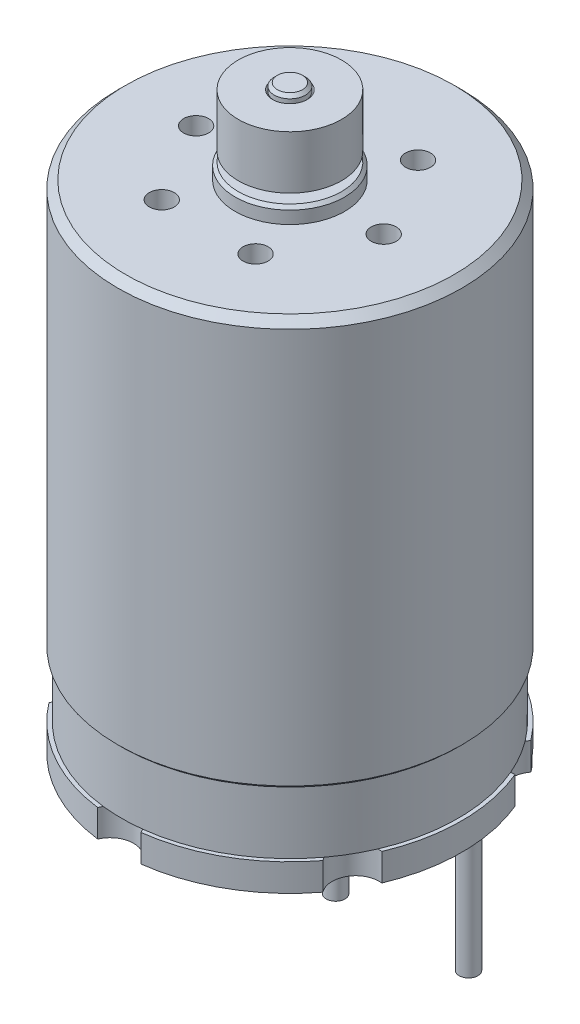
ISO-10303-21;
HEADER;
FILE_DESCRIPTION(('STEP AP214'),'2;1');
FILE_NAME('part.step','',(''),(''),'','','');
FILE_SCHEMA(('AUTOMOTIVE_DESIGN { 1 0 10303 214 1 1 1 1 }'));
ENDSEC;
DATA;
#1=APPLICATION_CONTEXT('core data for automotive mechanical design processes');
#2=APPLICATION_PROTOCOL_DEFINITION('international standard','automotive_design',2000,#1);
#3=PRODUCT_CONTEXT('',#1,'mechanical');
#4=PRODUCT('Part','Part','',(#3));
#5=PRODUCT_RELATED_PRODUCT_CATEGORY('part','',(#4));
#6=PRODUCT_DEFINITION_FORMATION('','',#4);
#7=PRODUCT_DEFINITION_CONTEXT('part definition',#1,'design');
#8=PRODUCT_DEFINITION('design','',#6,#7);
#9=PRODUCT_DEFINITION_SHAPE('','',#8);
#10=(LENGTH_UNIT() NAMED_UNIT(*) SI_UNIT(.MILLI.,.METRE.));
#11=(NAMED_UNIT(*) PLANE_ANGLE_UNIT() SI_UNIT($,.RADIAN.));
#12=(NAMED_UNIT(*) SI_UNIT($,.STERADIAN.) SOLID_ANGLE_UNIT());
#13=UNCERTAINTY_MEASURE_WITH_UNIT(LENGTH_MEASURE(1.E-05),#10,'distance_accuracy_value','');
#14=(GEOMETRIC_REPRESENTATION_CONTEXT(3) GLOBAL_UNCERTAINTY_ASSIGNED_CONTEXT((#13)) GLOBAL_UNIT_ASSIGNED_CONTEXT((#10,
#11,#12)) REPRESENTATION_CONTEXT('',''));
#15=CARTESIAN_POINT('',(0.,0.,0.));
#16=DIRECTION('',(0.,0.,1.));
#17=DIRECTION('',(1.,0.,0.));
#18=AXIS2_PLACEMENT_3D('',#15,#16,#17);
#19=CARTESIAN_POINT('',(0.,31.6,0.));
#20=DIRECTION('',(0.,-1.,0.));
#21=DIRECTION('',(0.,0.,-1.));
#22=AXIS2_PLACEMENT_3D('',#19,#20,#21);
#23=CYLINDRICAL_SURFACE('',#22,1.);
#24=CARTESIAN_POINT('',(0.,34.9000000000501,0.));
#25=DIRECTION('',(0.,1.,0.));
#26=DIRECTION('',(0.,0.,1.));
#27=AXIS2_PLACEMENT_3D('',#24,#25,#26);
#28=CIRCLE('',#27,0.999999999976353);
#29=CARTESIAN_POINT('',(0.,34.9000000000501,0.999999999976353));
#30=VERTEX_POINT('',#29);
#31=EDGE_CURVE('P0_E30',#30,#30,#28,.T.);
#32=ORIENTED_EDGE('',*,*,#31,.T.);
#33=EDGE_LOOP('',(#32));
#34=FACE_BOUND('',#33,.T.);
#35=CARTESIAN_POINT('',(0.,31.7000000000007,0.));
#36=DIRECTION('',(0.,-1.,0.));
#37=DIRECTION('',(0.,0.,-1.));
#38=AXIS2_PLACEMENT_3D('',#35,#36,#37);
#39=CIRCLE('',#38,0.999999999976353);
#40=CARTESIAN_POINT('',(0.,31.7000000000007,-0.999999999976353));
#41=VERTEX_POINT('',#40);
#42=EDGE_CURVE('P0_E36',#41,#41,#39,.T.);
#43=ORIENTED_EDGE('',*,*,#42,.T.);
#44=EDGE_LOOP('',(#43));
#45=FACE_BOUND('',#44,.T.);
#46=ADVANCED_FACE('P0_F15',(#34,#45),#23,.F.);
#47=CARTESIAN_POINT('',(0.,35.000000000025,0.));
#48=DIRECTION('',(0.,1.,0.));
#49=DIRECTION('',(0.,0.,1.));
#50=AXIS2_PLACEMENT_3D('',#47,#48,#49);
#51=CONICAL_SURFACE('',#50,1.10000000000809,0.785398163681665);
#52=ORIENTED_EDGE('',*,*,#31,.F.);
#53=EDGE_LOOP('',(#52));
#54=FACE_BOUND('',#53,.T.);
#55=CARTESIAN_POINT('',(0.,35.000000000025,0.));
#56=DIRECTION('',(0.,1.,0.));
#57=DIRECTION('',(0.,0.,1.));
#58=AXIS2_PLACEMENT_3D('',#55,#56,#57);
#59=CIRCLE('',#58,1.10000000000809);
#60=CARTESIAN_POINT('',(0.,35.000000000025,1.10000000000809));
#61=VERTEX_POINT('',#60);
#62=EDGE_CURVE('P0_E18',#61,#61,#59,.F.);
#63=ORIENTED_EDGE('',*,*,#62,.F.);
#64=EDGE_LOOP('',(#63));
#65=FACE_BOUND('',#64,.T.);
#66=ADVANCED_FACE('P0_F46',(#54,#65),#51,.F.);
#67=CARTESIAN_POINT('',(0.,31.599999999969,0.));
#68=DIRECTION('',(0.,-1.,0.));
#69=DIRECTION('',(0.,0.,-1.));
#70=AXIS2_PLACEMENT_3D('',#67,#68,#69);
#71=CONICAL_SURFACE('',#70,1.09999999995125,0.785398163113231);
#72=ORIENTED_EDGE('',*,*,#42,.F.);
#73=EDGE_LOOP('',(#72));
#74=FACE_BOUND('',#73,.T.);
#75=CARTESIAN_POINT('',(0.,31.599999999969,0.));
#76=DIRECTION('',(0.,-1.,0.));
#77=DIRECTION('',(0.,0.,-1.));
#78=AXIS2_PLACEMENT_3D('',#75,#76,#77);
#79=CIRCLE('',#78,1.09999999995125);
#80=CARTESIAN_POINT('',(0.,31.599999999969,-1.09999999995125));
#81=VERTEX_POINT('',#80);
#82=EDGE_CURVE('P0_E27',#81,#81,#79,.F.);
#83=ORIENTED_EDGE('',*,*,#82,.F.);
#84=EDGE_LOOP('',(#83));
#85=FACE_BOUND('',#84,.T.);
#86=ADVANCED_FACE('P0_F49',(#74,#85),#71,.F.);
#87=CARTESIAN_POINT('',(3.3,35.,0.));
#88=DIRECTION('',(0.,1.,0.));
#89=DIRECTION('',(0.,0.,1.));
#90=AXIS2_PLACEMENT_3D('',#87,#88,#89);
#91=PLANE('',#90);
#92=CARTESIAN_POINT('',(0.,35.,0.));
#93=DIRECTION('',(0.,-1.,0.));
#94=DIRECTION('',(0.,0.,-1.));
#95=AXIS2_PLACEMENT_3D('',#92,#93,#94);
#96=CIRCLE('',#95,3.3);
#97=CARTESIAN_POINT('',(0.,35.,-3.3));
#98=VERTEX_POINT('',#97);
#99=EDGE_CURVE('P0_E22',#98,#98,#96,.T.);
#100=ORIENTED_EDGE('',*,*,#99,.F.);
#101=EDGE_LOOP('',(#100));
#102=FACE_BOUND('',#101,.T.);
#103=ORIENTED_EDGE('',*,*,#62,.T.);
#104=EDGE_LOOP('',(#103));
#105=FACE_BOUND('',#104,.T.);
#106=ADVANCED_FACE('P0_F55',(#102,#105),#91,.T.);
#107=CARTESIAN_POINT('',(1.,31.6,0.));
#108=DIRECTION('',(0.,-1.,0.));
#109=DIRECTION('',(0.,0.,-1.));
#110=AXIS2_PLACEMENT_3D('',#107,#108,#109);
#111=PLANE('',#110);
#112=CARTESIAN_POINT('',(0.,31.6,0.));
#113=DIRECTION('',(0.,-1.,0.));
#114=DIRECTION('',(0.,0.,-1.));
#115=AXIS2_PLACEMENT_3D('',#112,#113,#114);
#116=CIRCLE('',#115,3.3);
#117=CARTESIAN_POINT('',(0.,31.6,-3.3));
#118=VERTEX_POINT('',#117);
#119=EDGE_CURVE('P0_E10',#118,#118,#116,.F.);
#120=ORIENTED_EDGE('',*,*,#119,.F.);
#121=EDGE_LOOP('',(#120));
#122=FACE_BOUND('',#121,.T.);
#123=ORIENTED_EDGE('',*,*,#82,.T.);
#124=EDGE_LOOP('',(#123));
#125=FACE_BOUND('',#124,.T.);
#126=ADVANCED_FACE('P0_F60',(#122,#125),#111,.T.);
#127=CARTESIAN_POINT('',(0.,31.6,0.));
#128=DIRECTION('',(0.,-1.,0.));
#129=DIRECTION('',(0.,0.,-1.));
#130=AXIS2_PLACEMENT_3D('',#127,#128,#129);
#131=CYLINDRICAL_SURFACE('',#130,3.3);
#132=ORIENTED_EDGE('',*,*,#119,.T.);
#133=EDGE_LOOP('',(#132));
#134=FACE_BOUND('',#133,.T.);
#135=ORIENTED_EDGE('',*,*,#99,.T.);
#136=EDGE_LOOP('',(#135));
#137=FACE_BOUND('',#136,.T.);
#138=ADVANCED_FACE('P0_F58',(#134,#137),#131,.T.);
#139=CLOSED_SHELL('',(#46,#66,#86,#106,#126,#138));
#140=MANIFOLD_SOLID_BREP('P0_B1',#139);
#141=CARTESIAN_POINT('',(0.,35.4,0.));
#142=DIRECTION('',(0.,1.,0.));
#143=DIRECTION('',(0.,0.,1.));
#144=AXIS2_PLACEMENT_3D('',#141,#142,#143);
#145=PLANE('',#144);
#146=CARTESIAN_POINT('',(0.,35.4000000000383,0.));
#147=DIRECTION('',(0.,-1.,0.));
#148=DIRECTION('',(0.,0.,-1.));
#149=AXIS2_PLACEMENT_3D('',#146,#147,#148);
#150=CIRCLE('',#149,0.799999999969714);
#151=CARTESIAN_POINT('',(0.,35.4000000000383,-0.799999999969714));
#152=VERTEX_POINT('',#151);
#153=EDGE_CURVE('P1_E512',#152,#152,#150,.T.);
#154=ORIENTED_EDGE('',*,*,#153,.F.);
#155=EDGE_LOOP('',(#154));
#156=FACE_BOUND('',#155,.T.);
#157=ADVANCED_FACE('P1_F17',(#156),#145,.T.);
#158=CARTESIAN_POINT('',(0.,-1.75,0.));
#159=DIRECTION('',(0.,-1.,0.));
#160=DIRECTION('',(0.,0.,-1.));
#161=AXIS2_PLACEMENT_3D('',#158,#159,#160);
#162=PLANE('',#161);
#163=CARTESIAN_POINT('',(-5.6,-1.75,0.));
#164=DIRECTION('',(0.,1.,0.));
#165=DIRECTION('',(0.,0.,1.));
#166=AXIS2_PLACEMENT_3D('',#163,#164,#165);
#167=CIRCLE('',#166,1.35);
#168=CARTESIAN_POINT('',(-5.6,-1.75,1.35));
#169=VERTEX_POINT('',#168);
#170=EDGE_CURVE('P1_E511',#169,#169,#167,.F.);
#171=ORIENTED_EDGE('',*,*,#170,.T.);
#172=EDGE_LOOP('',(#171));
#173=FACE_BOUND('',#172,.T.);
#174=ADVANCED_FACE('P1_F1007',(#173),#162,.T.);
#175=CARTESIAN_POINT('',(-5.8,-5.25,-7.05));
#176=DIRECTION('',(0.,0.,-1.));
#177=DIRECTION('',(-1.,0.,0.));
#178=AXIS2_PLACEMENT_3D('',#175,#176,#177);
#179=PLANE('',#178);
#180=CARTESIAN_POINT('',(-4.2,-3.75,-7.05));
#181=DIRECTION('',(0.,0.,1.));
#182=DIRECTION('',(1.,0.,0.));
#183=AXIS2_PLACEMENT_3D('',#180,#181,#182);
#184=CIRCLE('',#183,1.5);
#185=CARTESIAN_POINT('',(-2.7,-3.75,-7.05));
#186=VERTEX_POINT('',#185);
#187=CARTESIAN_POINT('',(-3.66316527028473,-5.15064573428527,-7.05));
#188=VERTEX_POINT('',#187);
#189=EDGE_CURVE('P1_E1492',#186,#188,#184,.F.);
#190=ORIENTED_EDGE('',*,*,#189,.F.);
#191=DIRECTION('',(0.,1.,0.));
#192=VECTOR('',#191,1.);
#193=CARTESIAN_POINT('',(-2.7,-2.25,-7.05));
#194=LINE('',#193,#192);
#195=CARTESIAN_POINT('',(-2.7,-2.25,-7.05));
#196=VERTEX_POINT('',#195);
#197=EDGE_CURVE('P1_E1497',#196,#186,#194,.F.);
#198=ORIENTED_EDGE('',*,*,#197,.F.);
#199=DIRECTION('',(1.,0.,0.));
#200=VECTOR('',#199,1.);
#201=CARTESIAN_POINT('',(-5.8,-2.25,-7.05));
#202=LINE('',#201,#200);
#203=CARTESIAN_POINT('',(-5.8,-2.25,-7.05));
#204=VERTEX_POINT('',#203);
#205=EDGE_CURVE('P1_E509',#196,#204,#202,.F.);
#206=ORIENTED_EDGE('',*,*,#205,.T.);
#207=DIRECTION('',(0.,1.,0.));
#208=VECTOR('',#207,1.);
#209=CARTESIAN_POINT('',(-5.8,-2.25,-7.05));
#210=LINE('',#209,#208);
#211=CARTESIAN_POINT('',(-5.8,-3.75,-7.05));
#212=VERTEX_POINT('',#211);
#213=EDGE_CURVE('P1_E1513',#204,#212,#210,.F.);
#214=ORIENTED_EDGE('',*,*,#213,.T.);
#215=CARTESIAN_POINT('',(-4.3,-3.75,-7.05));
#216=DIRECTION('',(0.,0.,-1.));
#217=DIRECTION('',(-1.,0.,0.));
#218=AXIS2_PLACEMENT_3D('',#215,#216,#217);
#219=CIRCLE('',#218,1.5);
#220=CARTESIAN_POINT('',(-4.83683472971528,-5.15064573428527,-7.05));
#221=VERTEX_POINT('',#220);
#222=EDGE_CURVE('P1_E1515',#221,#212,#219,.T.);
#223=ORIENTED_EDGE('',*,*,#222,.F.);
#224=DIRECTION('',(0.,1.,0.));
#225=VECTOR('',#224,1.);
#226=CARTESIAN_POINT('',(-4.83683472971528,-5.25,-7.05));
#227=LINE('',#226,#225);
#228=CARTESIAN_POINT('',(-4.83683472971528,-4.39371407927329,-7.05));
#229=VERTEX_POINT('',#228);
#230=EDGE_CURVE('P1_E496',#229,#221,#227,.F.);
#231=ORIENTED_EDGE('',*,*,#230,.F.);
#232=CARTESIAN_POINT('',(-4.25,-3.85,-7.05));
#233=DIRECTION('',(0.,0.,-1.));
#234=DIRECTION('',(-1.,0.,0.));
#235=AXIS2_PLACEMENT_3D('',#232,#233,#234);
#236=CIRCLE('',#235,0.8);
#237=CARTESIAN_POINT('',(-4.83683472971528,-3.30628592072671,-7.05));
#238=VERTEX_POINT('',#237);
#239=EDGE_CURVE('P1_E1467',#229,#238,#236,.T.);
#240=ORIENTED_EDGE('',*,*,#239,.T.);
#241=DIRECTION('',(0.,1.,0.));
#242=VECTOR('',#241,1.);
#243=CARTESIAN_POINT('',(-4.83683472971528,-5.25,-7.05));
#244=LINE('',#243,#242);
#245=CARTESIAN_POINT('',(-4.83683472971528,-3.25,-7.05));
#246=VERTEX_POINT('',#245);
#247=EDGE_CURVE('P1_E507',#246,#238,#244,.F.);
#248=ORIENTED_EDGE('',*,*,#247,.F.);
#249=DIRECTION('',(1.,0.,0.));
#250=VECTOR('',#249,1.);
#251=CARTESIAN_POINT('',(-4.25,-3.25,-7.05));
#252=LINE('',#251,#250);
#253=CARTESIAN_POINT('',(-4.77915026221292,-3.25,-7.05));
#254=VERTEX_POINT('',#253);
#255=EDGE_CURVE('P1_E1484',#246,#254,#252,.T.);
#256=ORIENTED_EDGE('',*,*,#255,.T.);
#257=CARTESIAN_POINT('',(-4.25,-3.85,-7.05));
#258=DIRECTION('',(0.,0.,-1.));
#259=DIRECTION('',(-1.,0.,0.));
#260=AXIS2_PLACEMENT_3D('',#257,#258,#259);
#261=CIRCLE('',#260,0.8);
#262=CARTESIAN_POINT('',(-3.72084973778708,-3.25,-7.05));
#263=VERTEX_POINT('',#262);
#264=EDGE_CURVE('P1_E1470',#254,#263,#261,.T.);
#265=ORIENTED_EDGE('',*,*,#264,.T.);
#266=DIRECTION('',(1.,0.,0.));
#267=VECTOR('',#266,1.);
#268=CARTESIAN_POINT('',(-4.25,-3.25,-7.05));
#269=LINE('',#268,#267);
#270=CARTESIAN_POINT('',(-3.66316527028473,-3.25,-7.05));
#271=VERTEX_POINT('',#270);
#272=EDGE_CURVE('P1_E1471',#263,#271,#269,.T.);
#273=ORIENTED_EDGE('',*,*,#272,.T.);
#274=DIRECTION('',(0.,1.,0.));
#275=VECTOR('',#274,1.);
#276=CARTESIAN_POINT('',(-3.66316527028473,-15.25,-7.05));
#277=LINE('',#276,#275);
#278=CARTESIAN_POINT('',(-3.66316527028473,-3.30628592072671,-7.05));
#279=VERTEX_POINT('',#278);
#280=EDGE_CURVE('P1_E1489',#279,#271,#277,.T.);
#281=ORIENTED_EDGE('',*,*,#280,.F.);
#282=CARTESIAN_POINT('',(-4.25,-3.85,-7.05));
#283=DIRECTION('',(0.,0.,-1.));
#284=DIRECTION('',(-1.,0.,0.));
#285=AXIS2_PLACEMENT_3D('',#282,#283,#284);
#286=CIRCLE('',#285,0.8);
#287=CARTESIAN_POINT('',(-3.66316527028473,-4.39371407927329,-7.05));
#288=VERTEX_POINT('',#287);
#289=EDGE_CURVE('P1_E1472',#279,#288,#286,.T.);
#290=ORIENTED_EDGE('',*,*,#289,.T.);
#291=DIRECTION('',(0.,1.,0.));
#292=VECTOR('',#291,1.);
#293=CARTESIAN_POINT('',(-3.66316527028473,-15.25,-7.05));
#294=LINE('',#293,#292);
#295=EDGE_CURVE('P1_E1473',#188,#288,#294,.T.);
#296=ORIENTED_EDGE('',*,*,#295,.F.);
#297=EDGE_LOOP('',(#190,#198,#206,#214,#223,#231,#240,#248,#256,#265,#273,#281,#290,#296));
#298=FACE_BOUND('',#297,.T.);
#299=ADVANCED_FACE('P1_F1004',(#298),#179,.F.);
#300=CARTESIAN_POINT('',(-4.25,-15.25,-7.175));
#301=DIRECTION('',(0.,-1.,0.));
#302=DIRECTION('',(0.,0.,-1.));
#303=AXIS2_PLACEMENT_3D('',#300,#301,#302);
#304=PLANE('',#303);
#305=CARTESIAN_POINT('',(-4.25,-15.25,-7.175));
#306=DIRECTION('',(0.,1.,0.));
#307=DIRECTION('',(0.,0.,1.));
#308=AXIS2_PLACEMENT_3D('',#305,#306,#307);
#309=CIRCLE('',#308,0.6);
#310=CARTESIAN_POINT('',(-4.25,-15.25,-6.575));
#311=VERTEX_POINT('',#310);
#312=EDGE_CURVE('P1_E1519',#311,#311,#309,.T.);
#313=ORIENTED_EDGE('',*,*,#312,.F.);
#314=EDGE_LOOP('',(#313));
#315=FACE_BOUND('',#314,.T.);
#316=ADVANCED_FACE('P1_F1000',(#315),#304,.T.);
#317=CARTESIAN_POINT('',(0.,-1.75,0.));
#318=DIRECTION('',(0.,-1.,0.));
#319=DIRECTION('',(0.,0.,-1.));
#320=AXIS2_PLACEMENT_3D('',#317,#318,#319);
#321=PLANE('',#320);
#322=CARTESIAN_POINT('',(5.6,-1.75,0.));
#323=DIRECTION('',(0.,1.,0.));
#324=DIRECTION('',(0.,0.,1.));
#325=AXIS2_PLACEMENT_3D('',#322,#323,#324);
#326=CIRCLE('',#325,1.35);
#327=CARTESIAN_POINT('',(5.6,-1.75,1.35));
#328=VERTEX_POINT('',#327);
#329=EDGE_CURVE('P1_E504',#328,#328,#326,.F.);
#330=ORIENTED_EDGE('',*,*,#329,.T.);
#331=EDGE_LOOP('',(#330));
#332=FACE_BOUND('',#331,.T.);
#333=ADVANCED_FACE('P1_F997',(#332),#321,.T.);
#334=CARTESIAN_POINT('',(5.8,-5.25,-7.05));
#335=DIRECTION('',(0.,0.,-1.));
#336=DIRECTION('',(-1.,0.,0.));
#337=AXIS2_PLACEMENT_3D('',#334,#335,#336);
#338=PLANE('',#337);
#339=CARTESIAN_POINT('',(4.25,-3.85,-7.05));
#340=DIRECTION('',(0.,0.,-1.));
#341=DIRECTION('',(-1.,0.,0.));
#342=AXIS2_PLACEMENT_3D('',#339,#340,#341);
#343=CIRCLE('',#342,0.8);
#344=CARTESIAN_POINT('',(3.66316527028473,-3.30628592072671,-7.05));
#345=VERTEX_POINT('',#344);
#346=CARTESIAN_POINT('',(3.66316527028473,-4.39371407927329,-7.05));
#347=VERTEX_POINT('',#346);
#348=EDGE_CURVE('P1_E1451',#345,#347,#343,.F.);
#349=ORIENTED_EDGE('',*,*,#348,.F.);
#350=DIRECTION('',(0.,1.,0.));
#351=VECTOR('',#350,1.);
#352=CARTESIAN_POINT('',(3.66316527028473,-5.25,-7.05));
#353=LINE('',#352,#351);
#354=CARTESIAN_POINT('',(3.66316527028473,-3.25,-7.05));
#355=VERTEX_POINT('',#354);
#356=EDGE_CURVE('P1_E1452',#355,#345,#353,.F.);
#357=ORIENTED_EDGE('',*,*,#356,.F.);
#358=DIRECTION('',(-1.,0.,0.));
#359=VECTOR('',#358,1.);
#360=CARTESIAN_POINT('',(5.8,-3.25,-7.05));
#361=LINE('',#360,#359);
#362=CARTESIAN_POINT('',(3.72084973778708,-3.25,-7.05));
#363=VERTEX_POINT('',#362);
#364=EDGE_CURVE('P1_E1454',#363,#355,#361,.T.);
#365=ORIENTED_EDGE('',*,*,#364,.F.);
#366=CARTESIAN_POINT('',(4.25,-3.85,-7.05));
#367=DIRECTION('',(0.,0.,-1.));
#368=DIRECTION('',(-1.,0.,0.));
#369=AXIS2_PLACEMENT_3D('',#366,#367,#368);
#370=CIRCLE('',#369,0.8);
#371=CARTESIAN_POINT('',(4.77915026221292,-3.25,-7.05));
#372=VERTEX_POINT('',#371);
#373=EDGE_CURVE('P1_E491',#372,#363,#370,.F.);
#374=ORIENTED_EDGE('',*,*,#373,.F.);
#375=DIRECTION('',(-1.,0.,0.));
#376=VECTOR('',#375,1.);
#377=CARTESIAN_POINT('',(5.8,-3.25,-7.05));
#378=LINE('',#377,#376);
#379=CARTESIAN_POINT('',(4.83683472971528,-3.25,-7.05));
#380=VERTEX_POINT('',#379);
#381=EDGE_CURVE('P1_E489',#380,#372,#378,.T.);
#382=ORIENTED_EDGE('',*,*,#381,.F.);
#383=DIRECTION('',(0.,1.,0.));
#384=VECTOR('',#383,1.);
#385=CARTESIAN_POINT('',(4.83683472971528,-5.25,-7.05));
#386=LINE('',#385,#384);
#387=CARTESIAN_POINT('',(4.83683472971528,-3.30628592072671,-7.05));
#388=VERTEX_POINT('',#387);
#389=EDGE_CURVE('P1_E473',#388,#380,#386,.T.);
#390=ORIENTED_EDGE('',*,*,#389,.F.);
#391=CARTESIAN_POINT('',(4.25,-3.85,-7.05));
#392=DIRECTION('',(0.,0.,-1.));
#393=DIRECTION('',(-1.,0.,0.));
#394=AXIS2_PLACEMENT_3D('',#391,#392,#393);
#395=CIRCLE('',#394,0.8);
#396=CARTESIAN_POINT('',(4.83683472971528,-4.39371407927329,-7.05));
#397=VERTEX_POINT('',#396);
#398=EDGE_CURVE('P1_E20',#397,#388,#395,.F.);
#399=ORIENTED_EDGE('',*,*,#398,.F.);
#400=DIRECTION('',(0.,1.,0.));
#401=VECTOR('',#400,1.);
#402=CARTESIAN_POINT('',(4.83683472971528,-5.25,-7.05));
#403=LINE('',#402,#401);
#404=CARTESIAN_POINT('',(4.83683472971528,-5.15064573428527,-7.05));
#405=VERTEX_POINT('',#404);
#406=EDGE_CURVE('P1_E461',#405,#397,#403,.T.);
#407=ORIENTED_EDGE('',*,*,#406,.F.);
#408=CARTESIAN_POINT('',(4.3,-3.75,-7.05));
#409=DIRECTION('',(0.,0.,-1.));
#410=DIRECTION('',(-1.,0.,0.));
#411=AXIS2_PLACEMENT_3D('',#408,#409,#410);
#412=CIRCLE('',#411,1.5);
#413=CARTESIAN_POINT('',(5.8,-3.75,-7.05));
#414=VERTEX_POINT('',#413);
#415=EDGE_CURVE('P1_E2160',#414,#405,#412,.T.);
#416=ORIENTED_EDGE('',*,*,#415,.F.);
#417=DIRECTION('',(0.,1.,0.));
#418=VECTOR('',#417,1.);
#419=CARTESIAN_POINT('',(5.8,-2.25,-7.05));
#420=LINE('',#419,#418);
#421=CARTESIAN_POINT('',(5.8,-2.25,-7.05));
#422=VERTEX_POINT('',#421);
#423=EDGE_CURVE('P1_E1526',#414,#422,#420,.T.);
#424=ORIENTED_EDGE('',*,*,#423,.T.);
#425=DIRECTION('',(-1.,0.,0.));
#426=VECTOR('',#425,1.);
#427=CARTESIAN_POINT('',(5.8,-2.25,-7.05));
#428=LINE('',#427,#426);
#429=CARTESIAN_POINT('',(2.7,-2.25,-7.05));
#430=VERTEX_POINT('',#429);
#431=EDGE_CURVE('P1_E502',#422,#430,#428,.T.);
#432=ORIENTED_EDGE('',*,*,#431,.T.);
#433=DIRECTION('',(0.,1.,0.));
#434=VECTOR('',#433,1.);
#435=CARTESIAN_POINT('',(2.7,-2.25,-7.05));
#436=LINE('',#435,#434);
#437=CARTESIAN_POINT('',(2.7,-3.75,-7.05));
#438=VERTEX_POINT('',#437);
#439=EDGE_CURVE('P1_E1533',#438,#430,#436,.T.);
#440=ORIENTED_EDGE('',*,*,#439,.F.);
#441=CARTESIAN_POINT('',(4.2,-3.75,-7.05));
#442=DIRECTION('',(0.,0.,1.));
#443=DIRECTION('',(1.,0.,0.));
#444=AXIS2_PLACEMENT_3D('',#441,#442,#443);
#445=CIRCLE('',#444,1.5);
#446=CARTESIAN_POINT('',(3.66316527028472,-5.15064573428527,-7.05));
#447=VERTEX_POINT('',#446);
#448=EDGE_CURVE('P1_E1550',#447,#438,#445,.F.);
#449=ORIENTED_EDGE('',*,*,#448,.F.);
#450=DIRECTION('',(0.,1.,0.));
#451=VECTOR('',#450,1.);
#452=CARTESIAN_POINT('',(3.66316527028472,-5.25,-7.05));
#453=LINE('',#452,#451);
#454=EDGE_CURVE('P1_E1449',#347,#447,#453,.F.);
#455=ORIENTED_EDGE('',*,*,#454,.F.);
#456=EDGE_LOOP('',(#349,#357,#365,#374,#382,#390,#399,#407,#416,#424,#432,#440,#449,#455));
#457=FACE_BOUND('',#456,.T.);
#458=ADVANCED_FACE('P1_F487',(#457),#338,.F.);
#459=CARTESIAN_POINT('',(4.25,-15.25,-7.175));
#460=DIRECTION('',(0.,-1.,0.));
#461=DIRECTION('',(0.,0.,-1.));
#462=AXIS2_PLACEMENT_3D('',#459,#460,#461);
#463=PLANE('',#462);
#464=CARTESIAN_POINT('',(4.25,-15.25,-7.175));
#465=DIRECTION('',(0.,1.,0.));
#466=DIRECTION('',(0.,0.,1.));
#467=AXIS2_PLACEMENT_3D('',#464,#465,#466);
#468=CIRCLE('',#467,0.6);
#469=CARTESIAN_POINT('',(4.25,-15.25,-6.575));
#470=VERTEX_POINT('',#469);
#471=EDGE_CURVE('P1_E883',#470,#470,#468,.T.);
#472=ORIENTED_EDGE('',*,*,#471,.F.);
#473=EDGE_LOOP('',(#472));
#474=FACE_BOUND('',#473,.T.);
#475=ADVANCED_FACE('P1_F990',(#474),#463,.T.);
#476=CARTESIAN_POINT('',(0.,35.2000000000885,0.));
#477=DIRECTION('',(0.,-1.,0.));
#478=DIRECTION('',(0.,0.,-1.));
#479=AXIS2_PLACEMENT_3D('',#476,#477,#478);
#480=CONICAL_SURFACE('',#479,0.99999999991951,0.785398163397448);
#481=ORIENTED_EDGE('',*,*,#153,.T.);
#482=EDGE_LOOP('',(#481));
#483=FACE_BOUND('',#482,.T.);
#484=CARTESIAN_POINT('',(0.,35.2,0.));
#485=DIRECTION('',(0.,-1.,0.));
#486=DIRECTION('',(0.,0.,-1.));
#487=AXIS2_PLACEMENT_3D('',#484,#485,#486);
#488=CIRCLE('',#487,1.);
#489=CARTESIAN_POINT('',(0.,35.2,-1.));
#490=VERTEX_POINT('',#489);
#491=EDGE_CURVE('P1_E862',#490,#490,#488,.T.);
#492=ORIENTED_EDGE('',*,*,#491,.F.);
#493=EDGE_LOOP('',(#492));
#494=FACE_BOUND('',#493,.T.);
#495=ADVANCED_FACE('P1_F986',(#483,#494),#480,.T.);
#496=CARTESIAN_POINT('',(-5.8,-2.25,-6.8));
#497=DIRECTION('',(1.,0.,0.));
#498=DIRECTION('',(0.,0.,-1.));
#499=AXIS2_PLACEMENT_3D('',#496,#497,#498);
#500=CYLINDRICAL_SURFACE('',#499,0.249999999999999);
#501=DIRECTION('',(1.,0.,0.));
#502=VECTOR('',#501,1.);
#503=CARTESIAN_POINT('',(-2.83967431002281,-2.,-6.8));
#504=LINE('',#503,#502);
#505=CARTESIAN_POINT('',(-2.7,-2.,-6.8));
#506=VERTEX_POINT('',#505);
#507=CARTESIAN_POINT('',(-5.8,-2.,-6.8));
#508=VERTEX_POINT('',#507);
#509=EDGE_CURVE('P1_E857',#506,#508,#504,.F.);
#510=ORIENTED_EDGE('',*,*,#509,.T.);
#511=CARTESIAN_POINT('',(-5.8,-2.25,-6.8));
#512=DIRECTION('',(1.,0.,0.));
#513=DIRECTION('',(0.,0.,-1.));
#514=AXIS2_PLACEMENT_3D('',#511,#512,#513);
#515=CIRCLE('',#514,0.249999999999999);
#516=EDGE_CURVE('P1_E1512',#508,#204,#515,.F.);
#517=ORIENTED_EDGE('',*,*,#516,.T.);
#518=ORIENTED_EDGE('',*,*,#205,.F.);
#519=CARTESIAN_POINT('',(-2.7,-2.25,-6.8));
#520=DIRECTION('',(1.,0.,0.));
#521=DIRECTION('',(0.,0.,-1.));
#522=AXIS2_PLACEMENT_3D('',#519,#520,#521);
#523=CIRCLE('',#522,0.249999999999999);
#524=EDGE_CURVE('P1_E1501',#506,#196,#523,.F.);
#525=ORIENTED_EDGE('',*,*,#524,.F.);
#526=EDGE_LOOP('',(#510,#517,#518,#525));
#527=FACE_BOUND('',#526,.T.);
#528=ADVANCED_FACE('P1_F982',(#527),#500,.F.);
#529=CARTESIAN_POINT('',(-5.6,-2.,0.));
#530=DIRECTION('',(0.,1.,0.));
#531=DIRECTION('',(0.,0.,1.));
#532=AXIS2_PLACEMENT_3D('',#529,#530,#531);
#533=CYLINDRICAL_SURFACE('',#532,1.35);
#534=CARTESIAN_POINT('',(-5.6,-2.,0.));
#535=DIRECTION('',(0.,1.,0.));
#536=DIRECTION('',(0.,0.,1.));
#537=AXIS2_PLACEMENT_3D('',#534,#535,#536);
#538=CIRCLE('',#537,1.35);
#539=CARTESIAN_POINT('',(-5.6,-2.,1.35));
#540=VERTEX_POINT('',#539);
#541=EDGE_CURVE('P1_E854',#540,#540,#538,.F.);
#542=ORIENTED_EDGE('',*,*,#541,.T.);
#543=EDGE_LOOP('',(#542));
#544=FACE_BOUND('',#543,.T.);
#545=ORIENTED_EDGE('',*,*,#170,.F.);
#546=EDGE_LOOP('',(#545));
#547=FACE_BOUND('',#546,.T.);
#548=ADVANCED_FACE('P1_F976',(#544,#547),#533,.F.);
#549=CARTESIAN_POINT('',(-4.25,-3.85,-4.2));
#550=DIRECTION('',(0.,0.,-1.));
#551=DIRECTION('',(-1.,0.,0.));
#552=AXIS2_PLACEMENT_3D('',#549,#550,#551);
#553=CYLINDRICAL_SURFACE('',#552,0.8);
#554=CARTESIAN_POINT('',(-4.25,-3.85,-7.3));
#555=DIRECTION('',(0.,0.,-1.));
#556=DIRECTION('',(-1.,0.,0.));
#557=AXIS2_PLACEMENT_3D('',#554,#555,#556);
#558=CIRCLE('',#557,0.8);
#559=CARTESIAN_POINT('',(-4.83683472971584,-4.39371407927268,-7.29999999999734));
#560=VERTEX_POINT('',#559);
#561=CARTESIAN_POINT('',(-4.83683472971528,-3.30628592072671,-7.3));
#562=VERTEX_POINT('',#561);
#563=EDGE_CURVE('P1_E851',#560,#562,#558,.T.);
#564=ORIENTED_EDGE('',*,*,#563,.T.);
#565=CARTESIAN_POINT('',(-4.83683472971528,-3.30628592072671,-7.05));
#566=CARTESIAN_POINT('',(-4.84170279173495,-3.31158392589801,-7.07265830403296));
#567=CARTESIAN_POINT('',(-4.84525405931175,-3.31551858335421,-7.09596607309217));
#568=CARTESIAN_POINT('',(-4.84955388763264,-3.32032291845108,-7.1425215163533));
#569=CARTESIAN_POINT('',(-4.85037326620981,-3.32127000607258,-7.16575484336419));
#570=CARTESIAN_POINT('',(-4.84940847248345,-3.32018150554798,-7.20754864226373));
#571=CARTESIAN_POINT('',(-4.84810078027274,-3.31869146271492,-7.2261369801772));
#572=CARTESIAN_POINT('',(-4.84377221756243,-3.31386362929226,-7.26328696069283));
#573=CARTESIAN_POINT('',(-4.84071498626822,-3.31048665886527,-7.28183937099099));
#574=CARTESIAN_POINT('',(-4.83683472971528,-3.30628592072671,-7.3));
#575=B_SPLINE_CURVE_WITH_KNOTS('',3,(#565,#566,#567,#568,#569,#570,#571,#572,#573,#574),
.UNSPECIFIED.,.F.,.F.,(4,2,2,2,4),(0.,0.0713154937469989,0.140767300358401,0.196677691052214,
0.253794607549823),.UNSPECIFIED.);
#576=EDGE_CURVE('P1_E928',#238,#562,#575,.T.);
#577=ORIENTED_EDGE('',*,*,#576,.F.);
#578=ORIENTED_EDGE('',*,*,#239,.F.);
#579=CARTESIAN_POINT('',(-4.83683472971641,-4.39371407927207,-7.29999999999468));
#580=CARTESIAN_POINT('',(-4.84170279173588,-4.38841607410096,-7.27734169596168));
#581=CARTESIAN_POINT('',(-4.84525405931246,-4.38448141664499,-7.25403392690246));
#582=CARTESIAN_POINT('',(-4.84955388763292,-4.37967708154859,-7.20747848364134));
#583=CARTESIAN_POINT('',(-4.85037326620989,-4.37872999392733,-7.18424515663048));
#584=CARTESIAN_POINT('',(-4.84940847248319,-4.37981849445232,-7.14245135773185));
#585=CARTESIAN_POINT('',(-4.84810078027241,-4.38130853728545,-7.12386301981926));
#586=CARTESIAN_POINT('',(-4.84377221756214,-4.38613637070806,-7.08671303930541));
#587=CARTESIAN_POINT('',(-4.84071498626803,-4.38951334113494,-7.06816062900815));
#588=CARTESIAN_POINT('',(-4.83683472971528,-4.39371407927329,-7.05));
#589=B_SPLINE_CURVE_WITH_KNOTS('',3,(#579,#580,#581,#582,#583,#584,#585,#586,#587,#588),
.UNSPECIFIED.,.F.,.F.,(4,2,2,2,4),(0.,0.0713154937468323,0.140767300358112,0.196677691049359,
0.253794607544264),.UNSPECIFIED.);
#590=EDGE_CURVE('P1_E505',#560,#229,#589,.T.);
#591=ORIENTED_EDGE('',*,*,#590,.F.);
#592=EDGE_LOOP('',(#564,#577,#578,#591));
#593=FACE_BOUND('',#592,.T.);
#594=ADVANCED_FACE('P1_F970',(#593),#553,.F.);
#595=CARTESIAN_POINT('',(-4.25,-3.85,-4.2));
#596=DIRECTION('',(0.,0.,-1.));
#597=DIRECTION('',(-1.,0.,0.));
#598=AXIS2_PLACEMENT_3D('',#595,#596,#597);
#599=CYLINDRICAL_SURFACE('',#598,0.8);
#600=ORIENTED_EDGE('',*,*,#264,.F.);
#601=DIRECTION('',(0.,0.,-1.));
#602=VECTOR('',#601,1.);
#603=CARTESIAN_POINT('',(-4.77915026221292,-3.25,-7.175));
#604=LINE('',#603,#602);
#605=CARTESIAN_POINT('',(-4.77915026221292,-3.25,-7.3));
#606=VERTEX_POINT('',#605);
#607=EDGE_CURVE('P1_E1447',#254,#606,#604,.T.);
#608=ORIENTED_EDGE('',*,*,#607,.T.);
#609=CARTESIAN_POINT('',(-4.25,-3.85,-7.3));
#610=DIRECTION('',(0.,0.,-1.));
#611=DIRECTION('',(-1.,0.,0.));
#612=AXIS2_PLACEMENT_3D('',#609,#610,#611);
#613=CIRCLE('',#612,0.8);
#614=CARTESIAN_POINT('',(-3.72084973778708,-3.25,-7.3));
#615=VERTEX_POINT('',#614);
#616=EDGE_CURVE('P1_E847',#606,#615,#613,.T.);
#617=ORIENTED_EDGE('',*,*,#616,.T.);
#618=DIRECTION('',(0.,0.,-1.));
#619=VECTOR('',#618,1.);
#620=CARTESIAN_POINT('',(-3.72084973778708,-3.25,-7.175));
#621=LINE('',#620,#619);
#622=EDGE_CURVE('P1_E1474',#615,#263,#621,.F.);
#623=ORIENTED_EDGE('',*,*,#622,.T.);
#624=EDGE_LOOP('',(#600,#608,#617,#623));
#625=FACE_BOUND('',#624,.T.);
#626=ADVANCED_FACE('P1_F975',(#625),#599,.F.);
#627=CARTESIAN_POINT('',(-4.25,-3.25,-7.175));
#628=DIRECTION('',(0.,-1.,0.));
#629=DIRECTION('',(0.,0.,-1.));
#630=AXIS2_PLACEMENT_3D('',#627,#628,#629);
#631=PLANE('',#630);
#632=DIRECTION('',(1.,0.,0.));
#633=VECTOR('',#632,1.);
#634=CARTESIAN_POINT('',(-5.8,-3.25,-7.3));
#635=LINE('',#634,#633);
#636=CARTESIAN_POINT('',(-3.66316527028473,-3.25,-7.3));
#637=VERTEX_POINT('',#636);
#638=EDGE_CURVE('P1_E849',#615,#637,#635,.T.);
#639=ORIENTED_EDGE('',*,*,#638,.T.);
#640=CARTESIAN_POINT('',(-4.25,-3.25,-7.175));
#641=DIRECTION('',(0.,1.,0.));
#642=DIRECTION('',(0.,0.,1.));
#643=AXIS2_PLACEMENT_3D('',#640,#641,#642);
#644=CIRCLE('',#643,0.6);
#645=CARTESIAN_POINT('',(-4.83683472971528,-3.25,-7.3));
#646=VERTEX_POINT('',#645);
#647=EDGE_CURVE('P1_E2316',#646,#637,#644,.F.);
#648=ORIENTED_EDGE('',*,*,#647,.F.);
#649=DIRECTION('',(1.,0.,0.));
#650=VECTOR('',#649,1.);
#651=CARTESIAN_POINT('',(-5.8,-3.25,-7.3));
#652=LINE('',#651,#650);
#653=EDGE_CURVE('P1_E850',#646,#606,#652,.T.);
#654=ORIENTED_EDGE('',*,*,#653,.T.);
#655=ORIENTED_EDGE('',*,*,#607,.F.);
#656=ORIENTED_EDGE('',*,*,#255,.F.);
#657=CARTESIAN_POINT('',(-4.25,-3.25,-7.175));
#658=DIRECTION('',(0.,1.,0.));
#659=DIRECTION('',(0.,0.,1.));
#660=AXIS2_PLACEMENT_3D('',#657,#658,#659);
#661=CIRCLE('',#660,0.6);
#662=EDGE_CURVE('P1_E2321',#271,#246,#661,.F.);
#663=ORIENTED_EDGE('',*,*,#662,.F.);
#664=ORIENTED_EDGE('',*,*,#272,.F.);
#665=ORIENTED_EDGE('',*,*,#622,.F.);
#666=EDGE_LOOP('',(#639,#648,#654,#655,#656,#663,#664,#665));
#667=FACE_BOUND('',#666,.T.);
#668=ADVANCED_FACE('P1_F2273',(#667),#631,.F.);
#669=CARTESIAN_POINT('',(-4.25,-3.85,-4.2));
#670=DIRECTION('',(0.,0.,-1.));
#671=DIRECTION('',(-1.,0.,0.));
#672=AXIS2_PLACEMENT_3D('',#669,#670,#671);
#673=CYLINDRICAL_SURFACE('',#672,0.8);
#674=ORIENTED_EDGE('',*,*,#289,.F.);
#675=CARTESIAN_POINT('',(-3.66316527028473,-3.30628592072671,-7.3));
#676=CARTESIAN_POINT('',(-3.65829720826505,-3.31158392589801,-7.27734169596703));
#677=CARTESIAN_POINT('',(-3.65474594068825,-3.31551858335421,-7.25403392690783));
#678=CARTESIAN_POINT('',(-3.65044611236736,-3.32032291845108,-7.2074784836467));
#679=CARTESIAN_POINT('',(-3.64962673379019,-3.32127000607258,-7.18424515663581));
#680=CARTESIAN_POINT('',(-3.65059152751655,-3.32018150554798,-7.14245135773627));
#681=CARTESIAN_POINT('',(-3.65189921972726,-3.31869146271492,-7.1238630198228));
#682=CARTESIAN_POINT('',(-3.65622778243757,-3.31386362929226,-7.08671303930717));
#683=CARTESIAN_POINT('',(-3.65928501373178,-3.31048665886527,-7.068160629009));
#684=CARTESIAN_POINT('',(-3.66316527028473,-3.30628592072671,-7.05));
#685=B_SPLINE_CURVE_WITH_KNOTS('',3,(#675,#676,#677,#678,#679,#680,#681,#682,#683,#684),
.UNSPECIFIED.,.F.,.F.,(4,2,2,2,4),(0.,0.071315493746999,0.140767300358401,0.196677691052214,
0.253794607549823),.UNSPECIFIED.);
#686=CARTESIAN_POINT('',(-3.66316527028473,-3.30628592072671,-7.3));
#687=VERTEX_POINT('',#686);
#688=EDGE_CURVE('P1_E955',#687,#279,#685,.T.);
#689=ORIENTED_EDGE('',*,*,#688,.F.);
#690=CARTESIAN_POINT('',(-4.25,-3.85,-7.3));
#691=DIRECTION('',(0.,0.,-1.));
#692=DIRECTION('',(-1.,0.,0.));
#693=AXIS2_PLACEMENT_3D('',#690,#691,#692);
#694=CIRCLE('',#693,0.8);
#695=CARTESIAN_POINT('',(-3.66316527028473,-4.39371407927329,-7.3));
#696=VERTEX_POINT('',#695);
#697=EDGE_CURVE('P1_E844',#687,#696,#694,.T.);
#698=ORIENTED_EDGE('',*,*,#697,.T.);
#699=CARTESIAN_POINT('',(-3.66316527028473,-4.39371407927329,-7.05));
#700=CARTESIAN_POINT('',(-3.65829720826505,-4.38841607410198,-7.07265830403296));
#701=CARTESIAN_POINT('',(-3.65474594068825,-4.38448141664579,-7.09596607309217));
#702=CARTESIAN_POINT('',(-3.65044611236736,-4.37967708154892,-7.1425215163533));
#703=CARTESIAN_POINT('',(-3.64962673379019,-4.37872999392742,-7.16575484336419));
#704=CARTESIAN_POINT('',(-3.65059152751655,-4.37981849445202,-7.20754864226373));
#705=CARTESIAN_POINT('',(-3.65189921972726,-4.38130853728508,-7.2261369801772));
#706=CARTESIAN_POINT('',(-3.65622778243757,-4.38613637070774,-7.26328696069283));
#707=CARTESIAN_POINT('',(-3.65928501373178,-4.38951334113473,-7.28183937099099));
#708=CARTESIAN_POINT('',(-3.66316527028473,-4.39371407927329,-7.3));
#709=B_SPLINE_CURVE_WITH_KNOTS('',3,(#699,#700,#701,#702,#703,#704,#705,#706,#707,#708),
.UNSPECIFIED.,.F.,.F.,(4,2,2,2,4),(0.,0.0713154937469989,0.140767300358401,0.196677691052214,
0.253794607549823),.UNSPECIFIED.);
#710=EDGE_CURVE('P1_E948',#288,#696,#709,.T.);
#711=ORIENTED_EDGE('',*,*,#710,.F.);
#712=EDGE_LOOP('',(#674,#689,#698,#711));
#713=FACE_BOUND('',#712,.T.);
#714=ADVANCED_FACE('P1_F2268',(#713),#673,.F.);
#715=CARTESIAN_POINT('',(-4.2,-3.75,-7.3));
#716=DIRECTION('',(0.,0.,1.));
#717=DIRECTION('',(1.,0.,0.));
#718=AXIS2_PLACEMENT_3D('',#715,#716,#717);
#719=CYLINDRICAL_SURFACE('',#718,1.5);
#720=ORIENTED_EDGE('',*,*,#189,.T.);
#721=CARTESIAN_POINT('',(-3.66316527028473,-5.15064573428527,-7.05));
#722=CARTESIAN_POINT('',(-3.6598525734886,-5.14937518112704,-7.06555432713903));
#723=CARTESIAN_POINT('',(-3.65715582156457,-5.14832942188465,-7.08125155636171));
#724=CARTESIAN_POINT('',(-3.65301596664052,-5.14671520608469,-7.11283556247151));
#725=CARTESIAN_POINT('',(-3.65157294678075,-5.14614678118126,-7.12872235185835));
#726=CARTESIAN_POINT('',(-3.64918910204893,-5.14521162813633,-7.17589744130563));
#727=CARTESIAN_POINT('',(-3.65006339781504,-5.14556362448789,-7.20731549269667));
#728=CARTESIAN_POINT('',(-3.6555572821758,-5.14770430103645,-7.25913381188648));
#729=CARTESIAN_POINT('',(-3.65882824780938,-5.14897379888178,-7.27970877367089));
#730=CARTESIAN_POINT('',(-3.66316527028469,-5.15064573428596,-7.29999999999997));
#731=B_SPLINE_CURVE_WITH_KNOTS('',3,(#721,#722,#723,#724,#725,#726,#727,#728,#729,#730),
.UNSPECIFIED.,.F.,.F.,(4,2,2,2,4),(0.,0.0478338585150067,0.0956708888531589,0.189477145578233,
0.251948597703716),.UNSPECIFIED.);
#732=CARTESIAN_POINT('',(-3.66316527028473,-5.15064573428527,-7.3));
#733=VERTEX_POINT('',#732);
#734=EDGE_CURVE('P1_E939',#188,#733,#731,.T.);
#735=ORIENTED_EDGE('',*,*,#734,.T.);
#736=CARTESIAN_POINT('',(-4.2,-3.75,-7.3));
#737=DIRECTION('',(0.,0.,1.));
#738=DIRECTION('',(1.,0.,0.));
#739=AXIS2_PLACEMENT_3D('',#736,#737,#738);
#740=CIRCLE('',#739,1.5);
#741=CARTESIAN_POINT('',(-2.7,-3.75,-7.3));
#742=VERTEX_POINT('',#741);
#743=EDGE_CURVE('P1_E840',#733,#742,#740,.T.);
#744=ORIENTED_EDGE('',*,*,#743,.T.);
#745=DIRECTION('',(0.,0.,-1.));
#746=VECTOR('',#745,1.);
#747=CARTESIAN_POINT('',(-2.7,-3.75,-6.8));
#748=LINE('',#747,#746);
#749=EDGE_CURVE('P1_E1493',#186,#742,#748,.T.);
#750=ORIENTED_EDGE('',*,*,#749,.F.);
#751=EDGE_LOOP('',(#720,#735,#744,#750));
#752=FACE_BOUND('',#751,.T.);
#753=ADVANCED_FACE('P1_F2262',(#752),#719,.T.);
#754=CARTESIAN_POINT('',(-2.7,-2.25,-6.8));
#755=DIRECTION('',(1.,0.,0.));
#756=DIRECTION('',(0.,0.,-1.));
#757=AXIS2_PLACEMENT_3D('',#754,#755,#756);
#758=PLANE('',#757);
#759=ORIENTED_EDGE('',*,*,#197,.T.);
#760=ORIENTED_EDGE('',*,*,#749,.T.);
#761=DIRECTION('',(0.,1.,0.));
#762=VECTOR('',#761,1.);
#763=CARTESIAN_POINT('',(-2.7,-2.25,-7.3));
#764=LINE('',#763,#762);
#765=CARTESIAN_POINT('',(-2.7,-2.25,-7.3));
#766=VERTEX_POINT('',#765);
#767=EDGE_CURVE('P1_E842',#742,#766,#764,.T.);
#768=ORIENTED_EDGE('',*,*,#767,.T.);
#769=CARTESIAN_POINT('',(-2.7,-2.25,-6.8));
#770=DIRECTION('',(1.,0.,0.));
#771=DIRECTION('',(0.,0.,-1.));
#772=AXIS2_PLACEMENT_3D('',#769,#770,#771);
#773=CIRCLE('',#772,0.5);
#774=CARTESIAN_POINT('',(-2.7,-1.75,-6.8));
#775=VERTEX_POINT('',#774);
#776=EDGE_CURVE('P1_E1502',#766,#775,#773,.T.);
#777=ORIENTED_EDGE('',*,*,#776,.T.);
#778=DIRECTION('',(0.,1.,0.));
#779=VECTOR('',#778,1.);
#780=CARTESIAN_POINT('',(-2.7,-2.25,-6.8));
#781=LINE('',#780,#779);
#782=EDGE_CURVE('P1_E1498',#775,#506,#781,.F.);
#783=ORIENTED_EDGE('',*,*,#782,.T.);
#784=ORIENTED_EDGE('',*,*,#524,.T.);
#785=EDGE_LOOP('',(#759,#760,#768,#777,#783,#784));
#786=FACE_BOUND('',#785,.T.);
#787=ADVANCED_FACE('P1_F2257',(#786),#758,.T.);
#788=CARTESIAN_POINT('',(-5.8,-2.25,-6.8));
#789=DIRECTION('',(1.,0.,0.));
#790=DIRECTION('',(0.,0.,-1.));
#791=AXIS2_PLACEMENT_3D('',#788,#789,#790);
#792=PLANE('',#791);
#793=ORIENTED_EDGE('',*,*,#516,.F.);
#794=DIRECTION('',(0.,1.,0.));
#795=VECTOR('',#794,1.);
#796=CARTESIAN_POINT('',(-5.8,-2.25,-6.8));
#797=LINE('',#796,#795);
#798=CARTESIAN_POINT('',(-5.8,-1.75,-6.8));
#799=VERTEX_POINT('',#798);
#800=EDGE_CURVE('P1_E1510',#799,#508,#797,.F.);
#801=ORIENTED_EDGE('',*,*,#800,.F.);
#802=CARTESIAN_POINT('',(-5.8,-2.25,-6.8));
#803=DIRECTION('',(1.,0.,0.));
#804=DIRECTION('',(0.,0.,-1.));
#805=AXIS2_PLACEMENT_3D('',#802,#803,#804);
#806=CIRCLE('',#805,0.5);
#807=CARTESIAN_POINT('',(-5.8,-2.25,-7.3));
#808=VERTEX_POINT('',#807);
#809=EDGE_CURVE('P1_E1496',#808,#799,#806,.T.);
#810=ORIENTED_EDGE('',*,*,#809,.F.);
#811=DIRECTION('',(0.,1.,0.));
#812=VECTOR('',#811,1.);
#813=CARTESIAN_POINT('',(-5.8,-2.25,-7.3));
#814=LINE('',#813,#812);
#815=CARTESIAN_POINT('',(-5.8,-3.75,-7.3));
#816=VERTEX_POINT('',#815);
#817=EDGE_CURVE('P1_E839',#808,#816,#814,.F.);
#818=ORIENTED_EDGE('',*,*,#817,.T.);
#819=DIRECTION('',(0.,0.,-1.));
#820=VECTOR('',#819,1.);
#821=CARTESIAN_POINT('',(-5.8,-3.75,-6.8));
#822=LINE('',#821,#820);
#823=EDGE_CURVE('P1_E1516',#212,#816,#822,.T.);
#824=ORIENTED_EDGE('',*,*,#823,.F.);
#825=ORIENTED_EDGE('',*,*,#213,.F.);
#826=EDGE_LOOP('',(#793,#801,#810,#818,#824,#825));
#827=FACE_BOUND('',#826,.T.);
#828=ADVANCED_FACE('P1_F2252',(#827),#792,.F.);
#829=CARTESIAN_POINT('',(-4.3,-3.75,-6.8));
#830=DIRECTION('',(0.,0.,-1.));
#831=DIRECTION('',(-1.,0.,0.));
#832=AXIS2_PLACEMENT_3D('',#829,#830,#831);
#833=CYLINDRICAL_SURFACE('',#832,1.5);
#834=CARTESIAN_POINT('',(-4.3,-3.75,-7.3));
#835=DIRECTION('',(0.,0.,-1.));
#836=DIRECTION('',(-1.,0.,0.));
#837=AXIS2_PLACEMENT_3D('',#834,#835,#836);
#838=CIRCLE('',#837,1.5);
#839=CARTESIAN_POINT('',(-4.83683472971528,-5.15064573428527,-7.3));
#840=VERTEX_POINT('',#839);
#841=EDGE_CURVE('P1_E837',#816,#840,#838,.F.);
#842=ORIENTED_EDGE('',*,*,#841,.T.);
#843=CARTESIAN_POINT('',(-4.83683472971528,-5.15064573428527,-7.05));
#844=CARTESIAN_POINT('',(-4.8401474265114,-5.14937518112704,-7.06555432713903));
#845=CARTESIAN_POINT('',(-4.84284417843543,-5.14832942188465,-7.08125155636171));
#846=CARTESIAN_POINT('',(-4.84698403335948,-5.14671520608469,-7.11283556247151));
#847=CARTESIAN_POINT('',(-4.84842705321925,-5.14614678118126,-7.12872235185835));
#848=CARTESIAN_POINT('',(-4.85081089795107,-5.14521162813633,-7.17589744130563));
#849=CARTESIAN_POINT('',(-4.84993660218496,-5.14556362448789,-7.20731549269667));
#850=CARTESIAN_POINT('',(-4.8444427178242,-5.14770430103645,-7.25913381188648));
#851=CARTESIAN_POINT('',(-4.84117175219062,-5.14897379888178,-7.27970877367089));
#852=CARTESIAN_POINT('',(-4.83683472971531,-5.15064573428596,-7.29999999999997));
#853=B_SPLINE_CURVE_WITH_KNOTS('',3,(#843,#844,#845,#846,#847,#848,#849,#850,#851,#852),
.UNSPECIFIED.,.F.,.F.,(4,2,2,2,4),(0.,0.0478338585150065,0.0956708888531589,0.189477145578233,
0.251948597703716),.UNSPECIFIED.);
#854=EDGE_CURVE('P1_E965',#221,#840,#853,.T.);
#855=ORIENTED_EDGE('',*,*,#854,.F.);
#856=ORIENTED_EDGE('',*,*,#222,.T.);
#857=ORIENTED_EDGE('',*,*,#823,.T.);
#858=EDGE_LOOP('',(#842,#855,#856,#857));
#859=FACE_BOUND('',#858,.T.);
#860=ADVANCED_FACE('P1_F921',(#859),#833,.T.);
#861=CARTESIAN_POINT('',(-4.25,-15.25,-7.175));
#862=DIRECTION('',(0.,1.,0.));
#863=DIRECTION('',(0.,0.,1.));
#864=AXIS2_PLACEMENT_3D('',#861,#862,#863);
#865=CYLINDRICAL_SURFACE('',#864,0.6);
#866=ORIENTED_EDGE('',*,*,#312,.T.);
#867=EDGE_LOOP('',(#866));
#868=FACE_BOUND('',#867,.T.);
#869=ORIENTED_EDGE('',*,*,#590,.T.);
#870=ORIENTED_EDGE('',*,*,#230,.T.);
#871=ORIENTED_EDGE('',*,*,#854,.T.);
#872=DIRECTION('',(0.,1.,0.));
#873=VECTOR('',#872,1.);
#874=CARTESIAN_POINT('',(-4.83683472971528,-2.25,-7.3));
#875=LINE('',#874,#873);
#876=EDGE_CURVE('P1_E836',#840,#560,#875,.T.);
#877=ORIENTED_EDGE('',*,*,#876,.T.);
#878=EDGE_LOOP('',(#869,#870,#871,#877));
#879=FACE_BOUND('',#878,.T.);
#880=DIRECTION('',(0.,1.,0.));
#881=VECTOR('',#880,1.);
#882=CARTESIAN_POINT('',(-4.83683472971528,-2.25,-7.3));
#883=LINE('',#882,#881);
#884=EDGE_CURVE('P1_E853',#562,#646,#883,.T.);
#885=ORIENTED_EDGE('',*,*,#884,.T.);
#886=ORIENTED_EDGE('',*,*,#647,.T.);
#887=DIRECTION('',(0.,1.,0.));
#888=VECTOR('',#887,1.);
#889=CARTESIAN_POINT('',(-3.66316527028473,-2.25,-7.3));
#890=LINE('',#889,#888);
#891=EDGE_CURVE('P1_E846',#637,#687,#890,.F.);
#892=ORIENTED_EDGE('',*,*,#891,.T.);
#893=ORIENTED_EDGE('',*,*,#688,.T.);
#894=ORIENTED_EDGE('',*,*,#280,.T.);
#895=ORIENTED_EDGE('',*,*,#662,.T.);
#896=ORIENTED_EDGE('',*,*,#247,.T.);
#897=ORIENTED_EDGE('',*,*,#576,.T.);
#898=EDGE_LOOP('',(#885,#886,#892,#893,#894,#895,#896,#897));
#899=FACE_BOUND('',#898,.T.);
#900=ORIENTED_EDGE('',*,*,#710,.T.);
#901=DIRECTION('',(0.,1.,0.));
#902=VECTOR('',#901,1.);
#903=CARTESIAN_POINT('',(-3.66316527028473,-2.25,-7.3));
#904=LINE('',#903,#902);
#905=EDGE_CURVE('P1_E843',#696,#733,#904,.F.);
#906=ORIENTED_EDGE('',*,*,#905,.T.);
#907=ORIENTED_EDGE('',*,*,#734,.F.);
#908=ORIENTED_EDGE('',*,*,#295,.T.);
#909=EDGE_LOOP('',(#900,#906,#907,#908));
#910=FACE_BOUND('',#909,.T.);
#911=ADVANCED_FACE('P1_F916',(#868,#879,#899,#910),#865,.T.);
#912=CARTESIAN_POINT('',(0.,-5.9,0.));
#913=DIRECTION('',(0.,-1.,0.));
#914=DIRECTION('',(0.,0.,-1.));
#915=AXIS2_PLACEMENT_3D('',#912,#913,#914);
#916=PLANE('',#915);
#917=CARTESIAN_POINT('',(0.,-5.89999999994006,0.));
#918=DIRECTION('',(0.,1.,0.));
#919=DIRECTION('',(0.,0.,1.));
#920=AXIS2_PLACEMENT_3D('',#917,#918,#919);
#921=CIRCLE('',#920,0.800000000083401);
#922=CARTESIAN_POINT('',(0.,-5.89999999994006,0.800000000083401));
#923=VERTEX_POINT('',#922);
#924=EDGE_CURVE('P1_E832',#923,#923,#921,.T.);
#925=ORIENTED_EDGE('',*,*,#924,.F.);
#926=EDGE_LOOP('',(#925));
#927=FACE_BOUND('',#926,.T.);
#928=ADVANCED_FACE('P1_F912',(#927),#916,.T.);
#929=CARTESIAN_POINT('',(5.8,-2.25,-6.8));
#930=DIRECTION('',(-1.,0.,0.));
#931=DIRECTION('',(0.,0.,1.));
#932=AXIS2_PLACEMENT_3D('',#929,#930,#931);
#933=CYLINDRICAL_SURFACE('',#932,0.249999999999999);
#934=ORIENTED_EDGE('',*,*,#431,.F.);
#935=CARTESIAN_POINT('',(5.8,-2.25,-6.8));
#936=DIRECTION('',(-1.,0.,0.));
#937=DIRECTION('',(0.,0.,1.));
#938=AXIS2_PLACEMENT_3D('',#935,#936,#937);
#939=CIRCLE('',#938,0.249999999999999);
#940=CARTESIAN_POINT('',(5.8,-2.,-6.8));
#941=VERTEX_POINT('',#940);
#942=EDGE_CURVE('P1_E1530',#422,#941,#939,.F.);
#943=ORIENTED_EDGE('',*,*,#942,.T.);
#944=DIRECTION('',(1.,0.,0.));
#945=VECTOR('',#944,1.);
#946=CARTESIAN_POINT('',(2.83967431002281,-2.,-6.8));
#947=LINE('',#946,#945);
#948=CARTESIAN_POINT('',(2.7,-2.,-6.8));
#949=VERTEX_POINT('',#948);
#950=EDGE_CURVE('P1_E1520',#941,#949,#947,.F.);
#951=ORIENTED_EDGE('',*,*,#950,.T.);
#952=CARTESIAN_POINT('',(2.7,-2.25,-6.8));
#953=DIRECTION('',(-1.,0.,0.));
#954=DIRECTION('',(0.,0.,1.));
#955=AXIS2_PLACEMENT_3D('',#952,#953,#954);
#956=CIRCLE('',#955,0.249999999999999);
#957=EDGE_CURVE('P1_E1541',#430,#949,#956,.F.);
#958=ORIENTED_EDGE('',*,*,#957,.F.);
#959=EDGE_LOOP('',(#934,#943,#951,#958));
#960=FACE_BOUND('',#959,.T.);
#961=ADVANCED_FACE('P1_F908',(#960),#933,.F.);
#962=CARTESIAN_POINT('',(5.6,-2.,0.));
#963=DIRECTION('',(0.,1.,0.));
#964=DIRECTION('',(0.,0.,1.));
#965=AXIS2_PLACEMENT_3D('',#962,#963,#964);
#966=CYLINDRICAL_SURFACE('',#965,1.35);
#967=ORIENTED_EDGE('',*,*,#329,.F.);
#968=EDGE_LOOP('',(#967));
#969=FACE_BOUND('',#968,.T.);
#970=CARTESIAN_POINT('',(5.6,-2.,0.));
#971=DIRECTION('',(0.,1.,0.));
#972=DIRECTION('',(0.,0.,1.));
#973=AXIS2_PLACEMENT_3D('',#970,#971,#972);
#974=CIRCLE('',#973,1.35);
#975=CARTESIAN_POINT('',(5.6,-2.,1.35));
#976=VERTEX_POINT('',#975);
#977=EDGE_CURVE('P1_E828',#976,#976,#974,.F.);
#978=ORIENTED_EDGE('',*,*,#977,.T.);
#979=EDGE_LOOP('',(#978));
#980=FACE_BOUND('',#979,.T.);
#981=ADVANCED_FACE('P1_F903',(#969,#980),#966,.F.);
#982=CARTESIAN_POINT('',(4.3,-3.75,-6.8));
#983=DIRECTION('',(0.,0.,-1.));
#984=DIRECTION('',(-1.,0.,0.));
#985=AXIS2_PLACEMENT_3D('',#982,#983,#984);
#986=CYLINDRICAL_SURFACE('',#985,1.5);
#987=CARTESIAN_POINT('',(4.3,-3.75,-7.3));
#988=DIRECTION('',(0.,0.,-1.));
#989=DIRECTION('',(-1.,0.,0.));
#990=AXIS2_PLACEMENT_3D('',#987,#988,#989);
#991=CIRCLE('',#990,1.5);
#992=CARTESIAN_POINT('',(4.83683472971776,-5.15064573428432,-7.3));
#993=VERTEX_POINT('',#992);
#994=CARTESIAN_POINT('',(5.8,-3.75,-7.3));
#995=VERTEX_POINT('',#994);
#996=EDGE_CURVE('P1_E825',#993,#995,#991,.F.);
#997=ORIENTED_EDGE('',*,*,#996,.T.);
#998=DIRECTION('',(0.,0.,1.));
#999=VECTOR('',#998,1.);
#1000=CARTESIAN_POINT('',(5.8,-3.75,-6.8));
#1001=LINE('',#1000,#999);
#1002=EDGE_CURVE('P1_E1523',#995,#414,#1001,.T.);
#1003=ORIENTED_EDGE('',*,*,#1002,.T.);
#1004=ORIENTED_EDGE('',*,*,#415,.T.);
#1005=CARTESIAN_POINT('',(4.83683472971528,-5.15064573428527,-7.3));
#1006=CARTESIAN_POINT('',(4.8401474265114,-5.14937518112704,-7.28444567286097));
#1007=CARTESIAN_POINT('',(4.84284417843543,-5.14832942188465,-7.26874844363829));
#1008=CARTESIAN_POINT('',(4.84698403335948,-5.14671520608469,-7.23716443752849));
#1009=CARTESIAN_POINT('',(4.84842705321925,-5.14614678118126,-7.22127764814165));
#1010=CARTESIAN_POINT('',(4.85081089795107,-5.14521162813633,-7.17410255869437));
#1011=CARTESIAN_POINT('',(4.84993660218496,-5.14556362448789,-7.14268450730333));
#1012=CARTESIAN_POINT('',(4.8444427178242,-5.14770430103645,-7.09086618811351));
#1013=CARTESIAN_POINT('',(4.84117175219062,-5.14897379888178,-7.07029122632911));
#1014=CARTESIAN_POINT('',(4.83683472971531,-5.15064573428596,-7.05000000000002));
#1015=B_SPLINE_CURVE_WITH_KNOTS('',3,(#1005,#1006,#1007,#1008,#1009,#1010,#1011,#1012,#1013,
#1014),.UNSPECIFIED.,.F.,.F.,(4,2,2,2,4),(0.,0.0478338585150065,0.0956708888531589,
0.189477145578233,0.251948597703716),.UNSPECIFIED.);
#1016=EDGE_CURVE('P1_E884',#993,#405,#1015,.T.);
#1017=ORIENTED_EDGE('',*,*,#1016,.F.);
#1018=EDGE_LOOP('',(#997,#1003,#1004,#1017));
#1019=FACE_BOUND('',#1018,.T.);
#1020=ADVANCED_FACE('P1_F897',(#1019),#986,.T.);
#1021=CARTESIAN_POINT('',(5.8,-2.25,-6.8));
#1022=DIRECTION('',(-1.,0.,0.));
#1023=DIRECTION('',(0.,0.,1.));
#1024=AXIS2_PLACEMENT_3D('',#1021,#1022,#1023);
#1025=PLANE('',#1024);
#1026=ORIENTED_EDGE('',*,*,#1002,.F.);
#1027=DIRECTION('',(0.,1.,0.));
#1028=VECTOR('',#1027,1.);
#1029=CARTESIAN_POINT('',(5.8,-2.25,-7.3));
#1030=LINE('',#1029,#1028);
#1031=CARTESIAN_POINT('',(5.8,-2.25,-7.3));
#1032=VERTEX_POINT('',#1031);
#1033=EDGE_CURVE('P1_E827',#995,#1032,#1030,.T.);
#1034=ORIENTED_EDGE('',*,*,#1033,.T.);
#1035=CARTESIAN_POINT('',(5.8,-2.25,-6.8));
#1036=DIRECTION('',(-1.,0.,0.));
#1037=DIRECTION('',(0.,0.,1.));
#1038=AXIS2_PLACEMENT_3D('',#1035,#1036,#1037);
#1039=CIRCLE('',#1038,0.5);
#1040=CARTESIAN_POINT('',(5.8,-1.75,-6.8));
#1041=VERTEX_POINT('',#1040);
#1042=EDGE_CURVE('P1_E1527',#1041,#1032,#1039,.T.);
#1043=ORIENTED_EDGE('',*,*,#1042,.F.);
#1044=DIRECTION('',(0.,1.,0.));
#1045=VECTOR('',#1044,1.);
#1046=CARTESIAN_POINT('',(5.8,-2.25,-6.8));
#1047=LINE('',#1046,#1045);
#1048=EDGE_CURVE('P1_E1528',#941,#1041,#1047,.T.);
#1049=ORIENTED_EDGE('',*,*,#1048,.F.);
#1050=ORIENTED_EDGE('',*,*,#942,.F.);
#1051=ORIENTED_EDGE('',*,*,#423,.F.);
#1052=EDGE_LOOP('',(#1026,#1034,#1043,#1049,#1050,#1051));
#1053=FACE_BOUND('',#1052,.T.);
#1054=ADVANCED_FACE('P1_F902',(#1053),#1025,.F.);
#1055=CARTESIAN_POINT('',(2.7,-2.25,-6.8));
#1056=DIRECTION('',(-1.,0.,0.));
#1057=DIRECTION('',(0.,0.,1.));
#1058=AXIS2_PLACEMENT_3D('',#1055,#1056,#1057);
#1059=PLANE('',#1058);
#1060=DIRECTION('',(0.,1.,0.));
#1061=VECTOR('',#1060,1.);
#1062=CARTESIAN_POINT('',(2.7,-2.25,-6.8));
#1063=LINE('',#1062,#1061);
#1064=CARTESIAN_POINT('',(2.7,-1.75,-6.8));
#1065=VERTEX_POINT('',#1064);
#1066=EDGE_CURVE('P1_E1542',#949,#1065,#1063,.T.);
#1067=ORIENTED_EDGE('',*,*,#1066,.T.);
#1068=CARTESIAN_POINT('',(2.7,-2.25,-6.8));
#1069=DIRECTION('',(-1.,0.,0.));
#1070=DIRECTION('',(0.,0.,1.));
#1071=AXIS2_PLACEMENT_3D('',#1068,#1069,#1070);
#1072=CIRCLE('',#1071,0.5);
#1073=CARTESIAN_POINT('',(2.7,-2.25,-7.3));
#1074=VERTEX_POINT('',#1073);
#1075=EDGE_CURVE('P1_E1545',#1065,#1074,#1072,.T.);
#1076=ORIENTED_EDGE('',*,*,#1075,.T.);
#1077=DIRECTION('',(0.,1.,0.));
#1078=VECTOR('',#1077,1.);
#1079=CARTESIAN_POINT('',(2.7,-2.25,-7.3));
#1080=LINE('',#1079,#1078);
#1081=CARTESIAN_POINT('',(2.7,-3.75,-7.3));
#1082=VERTEX_POINT('',#1081);
#1083=EDGE_CURVE('P1_E824',#1074,#1082,#1080,.F.);
#1084=ORIENTED_EDGE('',*,*,#1083,.T.);
#1085=DIRECTION('',(0.,0.,1.));
#1086=VECTOR('',#1085,1.);
#1087=CARTESIAN_POINT('',(2.7,-3.75,-7.3));
#1088=LINE('',#1087,#1086);
#1089=EDGE_CURVE('P1_E1546',#438,#1082,#1088,.F.);
#1090=ORIENTED_EDGE('',*,*,#1089,.F.);
#1091=ORIENTED_EDGE('',*,*,#439,.T.);
#1092=ORIENTED_EDGE('',*,*,#957,.T.);
#1093=EDGE_LOOP('',(#1067,#1076,#1084,#1090,#1091,#1092));
#1094=FACE_BOUND('',#1093,.T.);
#1095=ADVANCED_FACE('P1_F2151',(#1094),#1059,.T.);
#1096=CARTESIAN_POINT('',(4.2,-3.75,-7.3));
#1097=DIRECTION('',(0.,0.,1.));
#1098=DIRECTION('',(1.,0.,0.));
#1099=AXIS2_PLACEMENT_3D('',#1096,#1097,#1098);
#1100=CYLINDRICAL_SURFACE('',#1099,1.5);
#1101=ORIENTED_EDGE('',*,*,#448,.T.);
#1102=ORIENTED_EDGE('',*,*,#1089,.T.);
#1103=CARTESIAN_POINT('',(4.2,-3.75,-7.3));
#1104=DIRECTION('',(0.,0.,1.));
#1105=DIRECTION('',(1.,0.,0.));
#1106=AXIS2_PLACEMENT_3D('',#1103,#1104,#1105);
#1107=CIRCLE('',#1106,1.5);
#1108=CARTESIAN_POINT('',(3.66316527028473,-5.15064573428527,-7.3));
#1109=VERTEX_POINT('',#1108);
#1110=EDGE_CURVE('P1_E822',#1082,#1109,#1107,.T.);
#1111=ORIENTED_EDGE('',*,*,#1110,.T.);
#1112=CARTESIAN_POINT('',(3.66316527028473,-5.15064573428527,-7.05));
#1113=CARTESIAN_POINT('',(3.6598525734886,-5.14937518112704,-7.06555432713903));
#1114=CARTESIAN_POINT('',(3.65715582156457,-5.14832942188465,-7.08125155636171));
#1115=CARTESIAN_POINT('',(3.65301596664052,-5.14671520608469,-7.11283556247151));
#1116=CARTESIAN_POINT('',(3.65157294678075,-5.14614678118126,-7.12872235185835));
#1117=CARTESIAN_POINT('',(3.64918910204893,-5.14521162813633,-7.17589744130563));
#1118=CARTESIAN_POINT('',(3.65006339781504,-5.14556362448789,-7.20731549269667));
#1119=CARTESIAN_POINT('',(3.6555572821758,-5.14770430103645,-7.25913381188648));
#1120=CARTESIAN_POINT('',(3.65882824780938,-5.14897379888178,-7.27970877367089));
#1121=CARTESIAN_POINT('',(3.66316527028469,-5.15064573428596,-7.29999999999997));
#1122=B_SPLINE_CURVE_WITH_KNOTS('',3,(#1112,#1113,#1114,#1115,#1116,#1117,#1118,#1119,#1120,
#1121),.UNSPECIFIED.,.F.,.F.,(4,2,2,2,4),(0.,0.0478338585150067,0.0956708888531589,
0.189477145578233,0.251948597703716),.UNSPECIFIED.);
#1123=EDGE_CURVE('P1_E1552',#447,#1109,#1122,.T.);
#1124=ORIENTED_EDGE('',*,*,#1123,.F.);
#1125=EDGE_LOOP('',(#1101,#1102,#1111,#1124));
#1126=FACE_BOUND('',#1125,.T.);
#1127=ADVANCED_FACE('P1_F2208',(#1126),#1100,.T.);
#1128=CARTESIAN_POINT('',(4.25,-3.85,-4.2));
#1129=DIRECTION('',(0.,0.,-1.));
#1130=DIRECTION('',(-1.,0.,0.));
#1131=AXIS2_PLACEMENT_3D('',#1128,#1129,#1130);
#1132=CYLINDRICAL_SURFACE('',#1131,0.8);
#1133=CARTESIAN_POINT('',(3.66316527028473,-3.30628592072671,-7.05));
#1134=CARTESIAN_POINT('',(3.65829720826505,-3.31158392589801,-7.07265830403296));
#1135=CARTESIAN_POINT('',(3.65474594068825,-3.31551858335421,-7.09596607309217));
#1136=CARTESIAN_POINT('',(3.65044611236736,-3.32032291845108,-7.1425215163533));
#1137=CARTESIAN_POINT('',(3.64962673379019,-3.32127000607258,-7.16575484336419));
#1138=CARTESIAN_POINT('',(3.65059152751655,-3.32018150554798,-7.20754864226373));
#1139=CARTESIAN_POINT('',(3.65189921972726,-3.31869146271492,-7.2261369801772));
#1140=CARTESIAN_POINT('',(3.65622778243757,-3.31386362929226,-7.26328696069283));
#1141=CARTESIAN_POINT('',(3.65928501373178,-3.31048665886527,-7.28183937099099));
#1142=CARTESIAN_POINT('',(3.66316527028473,-3.30628592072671,-7.3));
#1143=B_SPLINE_CURVE_WITH_KNOTS('',3,(#1133,#1134,#1135,#1136,#1137,#1138,#1139,#1140,#1141,
#1142),.UNSPECIFIED.,.F.,.F.,(4,2,2,2,4),(0.,0.071315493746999,0.140767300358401,
0.196677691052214,0.253794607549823),.UNSPECIFIED.);
#1144=CARTESIAN_POINT('',(3.66316527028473,-3.30628592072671,-7.3));
#1145=VERTEX_POINT('',#1144);
#1146=EDGE_CURVE('P1_E891',#345,#1145,#1143,.T.);
#1147=ORIENTED_EDGE('',*,*,#1146,.F.);
#1148=ORIENTED_EDGE('',*,*,#348,.T.);
#1149=CARTESIAN_POINT('',(3.66316527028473,-4.39371407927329,-7.3));
#1150=CARTESIAN_POINT('',(3.65829720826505,-4.38841607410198,-7.27734169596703));
#1151=CARTESIAN_POINT('',(3.65474594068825,-4.38448141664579,-7.25403392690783));
#1152=CARTESIAN_POINT('',(3.65044611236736,-4.37967708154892,-7.2074784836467));
#1153=CARTESIAN_POINT('',(3.64962673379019,-4.37872999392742,-7.18424515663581));
#1154=CARTESIAN_POINT('',(3.65059152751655,-4.37981849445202,-7.14245135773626));
#1155=CARTESIAN_POINT('',(3.65189921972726,-4.38130853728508,-7.1238630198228));
#1156=CARTESIAN_POINT('',(3.65622778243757,-4.38613637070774,-7.08671303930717));
#1157=CARTESIAN_POINT('',(3.65928501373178,-4.38951334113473,-7.068160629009));
#1158=CARTESIAN_POINT('',(3.66316527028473,-4.39371407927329,-7.05));
#1159=B_SPLINE_CURVE_WITH_KNOTS('',3,(#1149,#1150,#1151,#1152,#1153,#1154,#1155,#1156,#1157,
#1158),.UNSPECIFIED.,.F.,.F.,(4,2,2,2,4),(0.,0.071315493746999,0.140767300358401,
0.196677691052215,0.253794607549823),.UNSPECIFIED.);
#1160=CARTESIAN_POINT('',(3.66316527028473,-4.39371407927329,-7.3));
#1161=VERTEX_POINT('',#1160);
#1162=EDGE_CURVE('P1_E2218',#1161,#347,#1159,.T.);
#1163=ORIENTED_EDGE('',*,*,#1162,.F.);
#1164=CARTESIAN_POINT('',(4.25,-3.85,-7.3));
#1165=DIRECTION('',(0.,0.,-1.));
#1166=DIRECTION('',(-1.,0.,0.));
#1167=AXIS2_PLACEMENT_3D('',#1164,#1165,#1166);
#1168=CIRCLE('',#1167,0.8);
#1169=EDGE_CURVE('P1_E818',#1161,#1145,#1168,.T.);
#1170=ORIENTED_EDGE('',*,*,#1169,.T.);
#1171=EDGE_LOOP('',(#1147,#1148,#1163,#1170));
#1172=FACE_BOUND('',#1171,.T.);
#1173=ADVANCED_FACE('P1_F2224',(#1172),#1132,.F.);
#1174=CARTESIAN_POINT('',(4.25,-3.85,-4.2));
#1175=DIRECTION('',(0.,0.,-1.));
#1176=DIRECTION('',(-1.,0.,0.));
#1177=AXIS2_PLACEMENT_3D('',#1174,#1175,#1176);
#1178=CYLINDRICAL_SURFACE('',#1177,0.8);
#1179=CARTESIAN_POINT('',(4.25,-3.85,-7.3));
#1180=DIRECTION('',(0.,0.,-1.));
#1181=DIRECTION('',(-1.,0.,0.));
#1182=AXIS2_PLACEMENT_3D('',#1179,#1180,#1181);
#1183=CIRCLE('',#1182,0.8);
#1184=CARTESIAN_POINT('',(3.72084973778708,-3.25,-7.3));
#1185=VERTEX_POINT('',#1184);
#1186=CARTESIAN_POINT('',(4.77915026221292,-3.25,-7.3));
#1187=VERTEX_POINT('',#1186);
#1188=EDGE_CURVE('P1_E814',#1185,#1187,#1183,.T.);
#1189=ORIENTED_EDGE('',*,*,#1188,.T.);
#1190=DIRECTION('',(0.,0.,-1.));
#1191=VECTOR('',#1190,1.);
#1192=CARTESIAN_POINT('',(4.77915026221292,-3.25,-7.175));
#1193=LINE('',#1192,#1191);
#1194=EDGE_CURVE('P1_E1554',#1187,#372,#1193,.F.);
#1195=ORIENTED_EDGE('',*,*,#1194,.T.);
#1196=ORIENTED_EDGE('',*,*,#373,.T.);
#1197=DIRECTION('',(0.,0.,-1.));
#1198=VECTOR('',#1197,1.);
#1199=CARTESIAN_POINT('',(3.72084973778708,-3.25,-7.175));
#1200=LINE('',#1199,#1198);
#1201=EDGE_CURVE('P1_E890',#363,#1185,#1200,.T.);
#1202=ORIENTED_EDGE('',*,*,#1201,.T.);
#1203=EDGE_LOOP('',(#1189,#1195,#1196,#1202));
#1204=FACE_BOUND('',#1203,.T.);
#1205=ADVANCED_FACE('P1_F2403',(#1204),#1178,.F.);
#1206=CARTESIAN_POINT('',(4.25,-3.25,-7.175));
#1207=DIRECTION('',(0.,-1.,0.));
#1208=DIRECTION('',(0.,0.,-1.));
#1209=AXIS2_PLACEMENT_3D('',#1206,#1207,#1208);
#1210=PLANE('',#1209);
#1211=ORIENTED_EDGE('',*,*,#364,.T.);
#1212=CARTESIAN_POINT('',(4.25,-3.25,-7.175));
#1213=DIRECTION('',(0.,1.,0.));
#1214=DIRECTION('',(0.,0.,1.));
#1215=AXIS2_PLACEMENT_3D('',#1212,#1213,#1214);
#1216=CIRCLE('',#1215,0.6);
#1217=EDGE_CURVE('P1_E483',#380,#355,#1216,.F.);
#1218=ORIENTED_EDGE('',*,*,#1217,.F.);
#1219=ORIENTED_EDGE('',*,*,#381,.T.);
#1220=ORIENTED_EDGE('',*,*,#1194,.F.);
#1221=DIRECTION('',(1.,0.,0.));
#1222=VECTOR('',#1221,1.);
#1223=CARTESIAN_POINT('',(5.8,-3.25,-7.3));
#1224=LINE('',#1223,#1222);
#1225=CARTESIAN_POINT('',(4.83683472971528,-3.25,-7.3));
#1226=VERTEX_POINT('',#1225);
#1227=EDGE_CURVE('P1_E816',#1187,#1226,#1224,.T.);
#1228=ORIENTED_EDGE('',*,*,#1227,.T.);
#1229=CARTESIAN_POINT('',(4.25,-3.25,-7.175));
#1230=DIRECTION('',(0.,1.,0.));
#1231=DIRECTION('',(0.,0.,1.));
#1232=AXIS2_PLACEMENT_3D('',#1229,#1230,#1231);
#1233=CIRCLE('',#1232,0.6);
#1234=CARTESIAN_POINT('',(3.66316527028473,-3.25,-7.3));
#1235=VERTEX_POINT('',#1234);
#1236=EDGE_CURVE('P1_E484',#1235,#1226,#1233,.F.);
#1237=ORIENTED_EDGE('',*,*,#1236,.F.);
#1238=DIRECTION('',(1.,0.,0.));
#1239=VECTOR('',#1238,1.);
#1240=CARTESIAN_POINT('',(5.8,-3.25,-7.3));
#1241=LINE('',#1240,#1239);
#1242=EDGE_CURVE('P1_E817',#1235,#1185,#1241,.T.);
#1243=ORIENTED_EDGE('',*,*,#1242,.T.);
#1244=ORIENTED_EDGE('',*,*,#1201,.F.);
#1245=EDGE_LOOP('',(#1211,#1218,#1219,#1220,#1228,#1237,#1243,#1244));
#1246=FACE_BOUND('',#1245,.T.);
#1247=ADVANCED_FACE('P1_F875',(#1246),#1210,.F.);
#1248=CARTESIAN_POINT('',(4.25,-3.85,-4.2));
#1249=DIRECTION('',(0.,0.,-1.));
#1250=DIRECTION('',(-1.,0.,0.));
#1251=AXIS2_PLACEMENT_3D('',#1248,#1249,#1250);
#1252=CYLINDRICAL_SURFACE('',#1251,0.8);
#1253=ORIENTED_EDGE('',*,*,#398,.T.);
#1254=CARTESIAN_POINT('',(4.83683472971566,-3.30628592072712,-7.2999999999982));
#1255=CARTESIAN_POINT('',(4.84170279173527,-3.31158392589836,-7.27734169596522));
#1256=CARTESIAN_POINT('',(4.84525405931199,-3.31551858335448,-7.25403392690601));
#1257=CARTESIAN_POINT('',(4.84955388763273,-3.32032291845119,-7.20747848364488));
#1258=CARTESIAN_POINT('',(4.85037326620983,-3.32127000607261,-7.184245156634));
#1259=CARTESIAN_POINT('',(4.84940847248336,-3.32018150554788,-7.14245135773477));
#1260=CARTESIAN_POINT('',(4.84810078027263,-3.31869146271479,-7.1238630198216));
#1261=CARTESIAN_POINT('',(4.84377221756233,-3.31386362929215,-7.08671303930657));
#1262=CARTESIAN_POINT('',(4.84071498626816,-3.3104866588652,-7.06816062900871));
#1263=CARTESIAN_POINT('',(4.83683472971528,-3.30628592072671,-7.05));
#1264=B_SPLINE_CURVE_WITH_KNOTS('',3,(#1254,#1255,#1256,#1257,#1258,#1259,#1260,#1261,#1262,
#1263),.UNSPECIFIED.,.F.,.F.,(4,2,2,2,4),(0.,0.0713154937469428,0.140767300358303,
0.196677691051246,0.253794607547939),.UNSPECIFIED.);
#1265=CARTESIAN_POINT('',(4.83683472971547,-3.30628592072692,-7.29999999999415));
#1266=VERTEX_POINT('',#1265);
#1267=EDGE_CURVE('P1_E468',#1266,#388,#1264,.T.);
#1268=ORIENTED_EDGE('',*,*,#1267,.F.);
#1269=CARTESIAN_POINT('',(4.25,-3.85,-7.2999999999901));
#1270=DIRECTION('',(0.,0.,-1.));
#1271=DIRECTION('',(-1.,0.,0.));
#1272=AXIS2_PLACEMENT_3D('',#1269,#1270,#1271);
#1273=CIRCLE('',#1272,0.8);
#1274=CARTESIAN_POINT('',(4.83683472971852,-4.39371407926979,-7.29999999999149));
#1275=VERTEX_POINT('',#1274);
#1276=EDGE_CURVE('P1_E812',#1266,#1275,#1273,.T.);
#1277=ORIENTED_EDGE('',*,*,#1276,.T.);
#1278=CARTESIAN_POINT('',(4.83683472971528,-4.39371407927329,-7.05));
#1279=CARTESIAN_POINT('',(4.84170279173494,-4.388416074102,-7.0726583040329));
#1280=CARTESIAN_POINT('',(4.84525405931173,-4.38448141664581,-7.09596607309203));
#1281=CARTESIAN_POINT('',(4.84955388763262,-4.37967708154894,-7.14252151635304));
#1282=CARTESIAN_POINT('',(4.8503732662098,-4.37872999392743,-7.16575484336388));
#1283=CARTESIAN_POINT('',(4.8494084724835,-4.37981849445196,-7.20754864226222));
#1284=CARTESIAN_POINT('',(4.84810078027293,-4.38130853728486,-7.22613698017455));
#1285=CARTESIAN_POINT('',(4.84377221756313,-4.38613637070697,-7.2632869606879));
#1286=CARTESIAN_POINT('',(4.84071498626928,-4.38951334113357,-7.28183937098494));
#1287=CARTESIAN_POINT('',(4.83683472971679,-4.39371407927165,-7.29999999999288));
#1288=B_SPLINE_CURVE_WITH_KNOTS('',3,(#1278,#1279,#1280,#1281,#1282,#1283,#1284,#1285,#1286,
#1287),.UNSPECIFIED.,.F.,.F.,(4,2,2,2,4),(0.,0.0713154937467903,0.14076730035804,
0.196677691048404,0.253794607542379),.UNSPECIFIED.);
#1289=EDGE_CURVE('P1_E470',#397,#1275,#1288,.T.);
#1290=ORIENTED_EDGE('',*,*,#1289,.F.);
#1291=EDGE_LOOP('',(#1253,#1268,#1277,#1290));
#1292=FACE_BOUND('',#1291,.T.);
#1293=ADVANCED_FACE('P1_F467',(#1292),#1252,.F.);
#1294=CARTESIAN_POINT('',(4.25,-15.25,-7.175));
#1295=DIRECTION('',(0.,1.,0.));
#1296=DIRECTION('',(0.,0.,1.));
#1297=AXIS2_PLACEMENT_3D('',#1294,#1295,#1296);
#1298=CYLINDRICAL_SURFACE('',#1297,0.6);
#1299=DIRECTION('',(0.,1.,0.));
#1300=VECTOR('',#1299,1.);
#1301=CARTESIAN_POINT('',(3.66316527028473,-15.25,-7.3));
#1302=LINE('',#1301,#1300);
#1303=EDGE_CURVE('P1_E1549',#1145,#1235,#1302,.T.);
#1304=ORIENTED_EDGE('',*,*,#1303,.T.);
#1305=ORIENTED_EDGE('',*,*,#1236,.T.);
#1306=DIRECTION('',(0.,1.,0.));
#1307=VECTOR('',#1306,1.);
#1308=CARTESIAN_POINT('',(4.83683472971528,-2.25,-7.3));
#1309=LINE('',#1308,#1307);
#1310=EDGE_CURVE('P1_E481',#1226,#1266,#1309,.F.);
#1311=ORIENTED_EDGE('',*,*,#1310,.T.);
#1312=ORIENTED_EDGE('',*,*,#1267,.T.);
#1313=ORIENTED_EDGE('',*,*,#389,.T.);
#1314=ORIENTED_EDGE('',*,*,#1217,.T.);
#1315=ORIENTED_EDGE('',*,*,#356,.T.);
#1316=ORIENTED_EDGE('',*,*,#1146,.T.);
#1317=EDGE_LOOP('',(#1304,#1305,#1311,#1312,#1313,#1314,#1315,#1316));
#1318=FACE_BOUND('',#1317,.T.);
#1319=ORIENTED_EDGE('',*,*,#471,.T.);
#1320=EDGE_LOOP('',(#1319));
#1321=FACE_BOUND('',#1320,.T.);
#1322=ORIENTED_EDGE('',*,*,#1289,.T.);
#1323=DIRECTION('',(0.,1.,0.));
#1324=VECTOR('',#1323,1.);
#1325=CARTESIAN_POINT('',(4.83683472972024,-2.25,-7.3));
#1326=LINE('',#1325,#1324);
#1327=EDGE_CURVE('P1_E811',#1275,#993,#1326,.F.);
#1328=ORIENTED_EDGE('',*,*,#1327,.T.);
#1329=ORIENTED_EDGE('',*,*,#1016,.T.);
#1330=ORIENTED_EDGE('',*,*,#406,.T.);
#1331=EDGE_LOOP('',(#1322,#1328,#1329,#1330));
#1332=FACE_BOUND('',#1331,.T.);
#1333=ORIENTED_EDGE('',*,*,#1162,.T.);
#1334=ORIENTED_EDGE('',*,*,#454,.T.);
#1335=ORIENTED_EDGE('',*,*,#1123,.T.);
#1336=DIRECTION('',(0.,1.,0.));
#1337=VECTOR('',#1336,1.);
#1338=CARTESIAN_POINT('',(3.66316527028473,-2.25,-7.3));
#1339=LINE('',#1338,#1337);
#1340=EDGE_CURVE('P1_E821',#1109,#1161,#1339,.T.);
#1341=ORIENTED_EDGE('',*,*,#1340,.T.);
#1342=EDGE_LOOP('',(#1333,#1334,#1335,#1341));
#1343=FACE_BOUND('',#1342,.T.);
#1344=ADVANCED_FACE('P1_F476',(#1318,#1321,#1332,#1343),#1298,.T.);
#1345=CARTESIAN_POINT('',(0.,35.4,0.));
#1346=DIRECTION('',(0.,-1.,0.));
#1347=DIRECTION('',(0.,0.,-1.));
#1348=AXIS2_PLACEMENT_3D('',#1345,#1346,#1347);
#1349=CYLINDRICAL_SURFACE('',#1348,1.);
#1350=ORIENTED_EDGE('',*,*,#491,.T.);
#1351=EDGE_LOOP('',(#1350));
#1352=FACE_BOUND('',#1351,.T.);
#1353=CARTESIAN_POINT('',(0.,31.4,0.));
#1354=DIRECTION('',(0.,-1.,0.));
#1355=DIRECTION('',(0.,0.,-1.));
#1356=AXIS2_PLACEMENT_3D('',#1353,#1354,#1355);
#1357=CIRCLE('',#1356,1.);
#1358=CARTESIAN_POINT('',(0.,31.4,-1.));
#1359=VERTEX_POINT('',#1358);
#1360=EDGE_CURVE('P1_E808',#1359,#1359,#1357,.T.);
#1361=ORIENTED_EDGE('',*,*,#1360,.F.);
#1362=EDGE_LOOP('',(#1361));
#1363=FACE_BOUND('',#1362,.T.);
#1364=ADVANCED_FACE('P1_F1426',(#1352,#1363),#1349,.T.);
#1365=CARTESIAN_POINT('',(0.,0.,0.));
#1366=DIRECTION('',(0.,-1.,0.));
#1367=DIRECTION('',(0.,0.,-1.));
#1368=AXIS2_PLACEMENT_3D('',#1365,#1366,#1367);
#1369=PLANE('',#1368);
#1370=CARTESIAN_POINT('',(0.,0.,-11.5));
#1371=DIRECTION('',(0.,-1.,0.));
#1372=DIRECTION('',(0.,0.,-1.));
#1373=AXIS2_PLACEMENT_3D('',#1370,#1371,#1372);
#1374=CIRCLE('',#1373,1.5);
#1375=CARTESIAN_POINT('',(1.25381918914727,0.,-10.6766304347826));
#1376=VERTEX_POINT('',#1375);
#1377=CARTESIAN_POINT('',(-1.25381918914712,0.,-10.6766304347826));
#1378=VERTEX_POINT('',#1377);
#1379=EDGE_CURVE('P1_E802',#1376,#1378,#1374,.T.);
#1380=ORIENTED_EDGE('',*,*,#1379,.T.);
#1381=CARTESIAN_POINT('',(0.,0.,0.));
#1382=DIRECTION('',(0.,-1.,0.));
#1383=DIRECTION('',(0.,0.,-1.));
#1384=AXIS2_PLACEMENT_3D('',#1381,#1382,#1383);
#1385=CIRCLE('',#1384,10.75);
#1386=EDGE_CURVE('P1_E858',#1378,#1376,#1385,.T.);
#1387=ORIENTED_EDGE('',*,*,#1386,.T.);
#1388=EDGE_LOOP('',(#1380,#1387));
#1389=FACE_BOUND('',#1388,.T.);
#1390=ADVANCED_FACE('P1_F1423',(#1389),#1369,.T.);
#1391=CARTESIAN_POINT('',(-2.83967431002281,-2.,-3.6));
#1392=DIRECTION('',(0.,1.,0.));
#1393=DIRECTION('',(0.,0.,1.));
#1394=AXIS2_PLACEMENT_3D('',#1391,#1392,#1393);
#1395=PLANE('',#1394);
#1396=ORIENTED_EDGE('',*,*,#541,.F.);
#1397=EDGE_LOOP('',(#1396));
#1398=FACE_BOUND('',#1397,.T.);
#1399=CARTESIAN_POINT('',(-2.7,-2.,-1.5));
#1400=DIRECTION('',(0.,1.,0.));
#1401=DIRECTION('',(0.,0.,1.));
#1402=AXIS2_PLACEMENT_3D('',#1399,#1400,#1401);
#1403=CIRCLE('',#1402,1.1149655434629);
#1404=CARTESIAN_POINT('',(-2.77399462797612,-2.,-2.61250750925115));
#1405=VERTEX_POINT('',#1404);
#1406=CARTESIAN_POINT('',(-3.69033206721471,-2.,-0.987759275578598));
#1407=VERTEX_POINT('',#1406);
#1408=EDGE_CURVE('P1_E780',#1405,#1407,#1403,.T.);
#1409=ORIENTED_EDGE('',*,*,#1408,.T.);
#1410=CARTESIAN_POINT('',(-5.6,-2.,0.));
#1411=DIRECTION('',(0.,1.,0.));
#1412=DIRECTION('',(0.,0.,1.));
#1413=AXIS2_PLACEMENT_3D('',#1410,#1411,#1412);
#1414=CIRCLE('',#1413,2.15);
#1415=CARTESIAN_POINT('',(-4.26220075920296,-2.,1.68309036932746));
#1416=VERTEX_POINT('',#1415);
#1417=EDGE_CURVE('P1_E783',#1416,#1407,#1414,.T.);
#1418=ORIENTED_EDGE('',*,*,#1417,.F.);
#1419=CARTESIAN_POINT('',(-3.8448200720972,-2.,2.20819861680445));
#1420=DIRECTION('',(0.,1.,0.));
#1421=DIRECTION('',(0.,0.,1.));
#1422=AXIS2_PLACEMENT_3D('',#1419,#1420,#1421);
#1423=CIRCLE('',#1422,0.670779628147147);
#1424=CARTESIAN_POINT('',(-4.44771280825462,-2.,2.50224905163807));
#1425=VERTEX_POINT('',#1424);
#1426=EDGE_CURVE('P1_E787',#1416,#1425,#1423,.T.);
#1427=ORIENTED_EDGE('',*,*,#1426,.T.);
#1428=DIRECTION('',(0.438371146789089,0.,0.898794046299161));
#1429=VECTOR('',#1428,1.);
#1430=CARTESIAN_POINT('',(-2.5592782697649,-2.,6.37411364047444));
#1431=LINE('',#1430,#1429);
#1432=CARTESIAN_POINT('',(-2.5592782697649,-2.,6.37411364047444));
#1433=VERTEX_POINT('',#1432);
#1434=EDGE_CURVE('P1_E1587',#1425,#1433,#1431,.T.);
#1435=ORIENTED_EDGE('',*,*,#1434,.T.);
#1436=DIRECTION('',(-0.838670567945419,0.,0.544639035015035));
#1437=VECTOR('',#1436,1.);
#1438=CARTESIAN_POINT('',(-3.98501823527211,-2.,7.3));
#1439=LINE('',#1438,#1437);
#1440=CARTESIAN_POINT('',(-3.98501823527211,-2.,7.3));
#1441=VERTEX_POINT('',#1440);
#1442=EDGE_CURVE('P1_E1581',#1433,#1441,#1439,.T.);
#1443=ORIENTED_EDGE('',*,*,#1442,.T.);
#1444=DIRECTION('',(-0.642787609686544,0.,-0.766044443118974));
#1445=VECTOR('',#1444,1.);
#1446=CARTESIAN_POINT('',(-6.75404701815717,-2.,4.));
#1447=LINE('',#1446,#1445);
#1448=CARTESIAN_POINT('',(-6.75404701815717,-2.,4.));
#1449=VERTEX_POINT('',#1448);
#1450=EDGE_CURVE('P1_E1575',#1441,#1449,#1447,.T.);
#1451=ORIENTED_EDGE('',*,*,#1450,.T.);
#1452=DIRECTION('',(-0.258819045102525,0.,-0.965925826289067));
#1453=VECTOR('',#1452,1.);
#1454=CARTESIAN_POINT('',(-7.67674052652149,-2.,0.556460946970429));
#1455=LINE('',#1454,#1453);
#1456=CARTESIAN_POINT('',(-7.67674052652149,-2.,0.556460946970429));
#1457=VERTEX_POINT('',#1456);
#1458=EDGE_CURVE('P1_E794',#1449,#1457,#1455,.T.);
#1459=ORIENTED_EDGE('',*,*,#1458,.T.);
#1460=CARTESIAN_POINT('',(-5.6,-2.,0.));
#1461=DIRECTION('',(0.,1.,0.));
#1462=DIRECTION('',(0.,0.,1.));
#1463=AXIS2_PLACEMENT_3D('',#1460,#1461,#1462);
#1464=CIRCLE('',#1463,2.15);
#1465=CARTESIAN_POINT('',(-7.75,-2.,0.));
#1466=VERTEX_POINT('',#1465);
#1467=EDGE_CURVE('P1_E791',#1466,#1457,#1464,.T.);
#1468=ORIENTED_EDGE('',*,*,#1467,.F.);
#1469=CARTESIAN_POINT('',(-2.68000000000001,-2.,0.));
#1470=DIRECTION('',(0.,1.,0.));
#1471=DIRECTION('',(0.,0.,1.));
#1472=AXIS2_PLACEMENT_3D('',#1469,#1470,#1471);
#1473=CIRCLE('',#1472,5.06999999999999);
#1474=CARTESIAN_POINT('',(-6.25,-2.,-3.6));
#1475=VERTEX_POINT('',#1474);
#1476=EDGE_CURVE('P1_E796',#1475,#1466,#1473,.T.);
#1477=ORIENTED_EDGE('',*,*,#1476,.F.);
#1478=DIRECTION('',(0.,0.,-1.));
#1479=VECTOR('',#1478,1.);
#1480=CARTESIAN_POINT('',(-6.25,-2.,-6.8));
#1481=LINE('',#1480,#1479);
#1482=CARTESIAN_POINT('',(-6.25,-2.,-6.8));
#1483=VERTEX_POINT('',#1482);
#1484=EDGE_CURVE('P1_E1563',#1475,#1483,#1481,.T.);
#1485=ORIENTED_EDGE('',*,*,#1484,.T.);
#1486=DIRECTION('',(1.,0.,0.));
#1487=VECTOR('',#1486,1.);
#1488=CARTESIAN_POINT('',(-5.6,-2.,-6.8));
#1489=LINE('',#1488,#1487);
#1490=EDGE_CURVE('P1_E1560',#1483,#508,#1489,.T.);
#1491=ORIENTED_EDGE('',*,*,#1490,.T.);
#1492=ORIENTED_EDGE('',*,*,#509,.F.);
#1493=DIRECTION('',(1.,0.,0.));
#1494=VECTOR('',#1493,1.);
#1495=CARTESIAN_POINT('',(-2.83967431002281,-2.,-6.8));
#1496=LINE('',#1495,#1494);
#1497=CARTESIAN_POINT('',(-1.85,-2.,-6.8));
#1498=VERTEX_POINT('',#1497);
#1499=EDGE_CURVE('P1_E861',#1498,#506,#1496,.F.);
#1500=ORIENTED_EDGE('',*,*,#1499,.F.);
#1501=DIRECTION('',(0.,0.,1.));
#1502=VECTOR('',#1501,1.);
#1503=CARTESIAN_POINT('',(-1.85,-2.,-3.6));
#1504=LINE('',#1503,#1502);
#1505=CARTESIAN_POINT('',(-1.85,-2.,-3.6));
#1506=VERTEX_POINT('',#1505);
#1507=EDGE_CURVE('P1_E778',#1498,#1506,#1504,.T.);
#1508=ORIENTED_EDGE('',*,*,#1507,.T.);
#1509=CARTESIAN_POINT('',(-2.83967431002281,-2.,-3.6));
#1510=DIRECTION('',(0.,1.,0.));
#1511=DIRECTION('',(0.,0.,1.));
#1512=AXIS2_PLACEMENT_3D('',#1509,#1510,#1511);
#1513=CIRCLE('',#1512,0.989674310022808);
#1514=EDGE_CURVE('P1_E775',#1405,#1506,#1513,.T.);
#1515=ORIENTED_EDGE('',*,*,#1514,.F.);
#1516=EDGE_LOOP('',(#1409,#1418,#1427,#1435,#1443,#1451,#1459,#1468,#1477,#1485,#1491,#1492,
#1500,#1508,#1515));
#1517=FACE_BOUND('',#1516,.T.);
#1518=ADVANCED_FACE('P1_F1419',(#1398,#1517),#1395,.F.);
#1519=CARTESIAN_POINT('',(-5.8,-2.25,-7.3));
#1520=DIRECTION('',(0.,0.,1.));
#1521=DIRECTION('',(1.,0.,0.));
#1522=AXIS2_PLACEMENT_3D('',#1519,#1520,#1521);
#1523=PLANE('',#1522);
#1524=ORIENTED_EDGE('',*,*,#841,.F.);
#1525=ORIENTED_EDGE('',*,*,#817,.F.);
#1526=DIRECTION('',(1.,0.,0.));
#1527=VECTOR('',#1526,1.);
#1528=CARTESIAN_POINT('',(-5.8,-2.25,-7.3));
#1529=LINE('',#1528,#1527);
#1530=EDGE_CURVE('P1_E1505',#766,#808,#1529,.F.);
#1531=ORIENTED_EDGE('',*,*,#1530,.F.);
#1532=ORIENTED_EDGE('',*,*,#767,.F.);
#1533=ORIENTED_EDGE('',*,*,#743,.F.);
#1534=ORIENTED_EDGE('',*,*,#905,.F.);
#1535=ORIENTED_EDGE('',*,*,#697,.F.);
#1536=ORIENTED_EDGE('',*,*,#891,.F.);
#1537=ORIENTED_EDGE('',*,*,#638,.F.);
#1538=ORIENTED_EDGE('',*,*,#616,.F.);
#1539=ORIENTED_EDGE('',*,*,#653,.F.);
#1540=ORIENTED_EDGE('',*,*,#884,.F.);
#1541=ORIENTED_EDGE('',*,*,#563,.F.);
#1542=ORIENTED_EDGE('',*,*,#876,.F.);
#1543=EDGE_LOOP('',(#1524,#1525,#1531,#1532,#1533,#1534,#1535,#1536,#1537,#1538,#1539,#1540,
#1541,#1542));
#1544=FACE_BOUND('',#1543,.T.);
#1545=ADVANCED_FACE('P1_F1415',(#1544),#1523,.F.);
#1546=CARTESIAN_POINT('',(0.,-5.70000000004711,0.));
#1547=DIRECTION('',(0.,1.,0.));
#1548=DIRECTION('',(0.,0.,1.));
#1549=AXIS2_PLACEMENT_3D('',#1546,#1547,#1548);
#1550=CONICAL_SURFACE('',#1549,1.0000000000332,0.785398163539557);
#1551=ORIENTED_EDGE('',*,*,#924,.T.);
#1552=EDGE_LOOP('',(#1551));
#1553=FACE_BOUND('',#1552,.T.);
#1554=CARTESIAN_POINT('',(0.,-5.7,0.));
#1555=DIRECTION('',(0.,1.,0.));
#1556=DIRECTION('',(0.,0.,1.));
#1557=AXIS2_PLACEMENT_3D('',#1554,#1555,#1556);
#1558=CIRCLE('',#1557,1.);
#1559=CARTESIAN_POINT('',(0.,-5.7,1.));
#1560=VERTEX_POINT('',#1559);
#1561=EDGE_CURVE('P1_E1508',#1560,#1560,#1558,.T.);
#1562=ORIENTED_EDGE('',*,*,#1561,.F.);
#1563=EDGE_LOOP('',(#1562));
#1564=FACE_BOUND('',#1563,.T.);
#1565=ADVANCED_FACE('P1_F1411',(#1553,#1564),#1550,.T.);
#1566=CARTESIAN_POINT('',(2.83967431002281,-2.,-3.6));
#1567=DIRECTION('',(0.,1.,0.));
#1568=DIRECTION('',(0.,0.,1.));
#1569=AXIS2_PLACEMENT_3D('',#1566,#1567,#1568);
#1570=PLANE('',#1569);
#1571=ORIENTED_EDGE('',*,*,#977,.F.);
#1572=EDGE_LOOP('',(#1571));
#1573=FACE_BOUND('',#1572,.T.);
#1574=DIRECTION('',(0.,0.,-1.));
#1575=VECTOR('',#1574,1.);
#1576=CARTESIAN_POINT('',(1.85,-2.,-3.6));
#1577=LINE('',#1576,#1575);
#1578=CARTESIAN_POINT('',(1.85,-2.,-3.6));
#1579=VERTEX_POINT('',#1578);
#1580=CARTESIAN_POINT('',(1.85,-2.,-6.8));
#1581=VERTEX_POINT('',#1580);
#1582=EDGE_CURVE('P1_E1663',#1579,#1581,#1577,.T.);
#1583=ORIENTED_EDGE('',*,*,#1582,.T.);
#1584=DIRECTION('',(1.,0.,0.));
#1585=VECTOR('',#1584,1.);
#1586=CARTESIAN_POINT('',(2.83967431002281,-2.,-6.8));
#1587=LINE('',#1586,#1585);
#1588=EDGE_CURVE('P1_E831',#949,#1581,#1587,.F.);
#1589=ORIENTED_EDGE('',*,*,#1588,.F.);
#1590=ORIENTED_EDGE('',*,*,#950,.F.);
#1591=DIRECTION('',(1.,0.,0.));
#1592=VECTOR('',#1591,1.);
#1593=CARTESIAN_POINT('',(2.83967431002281,-2.,-6.8));
#1594=LINE('',#1593,#1592);
#1595=CARTESIAN_POINT('',(6.25,-2.,-6.8));
#1596=VERTEX_POINT('',#1595);
#1597=EDGE_CURVE('P1_E835',#1596,#941,#1594,.F.);
#1598=ORIENTED_EDGE('',*,*,#1597,.F.);
#1599=DIRECTION('',(0.,0.,1.));
#1600=VECTOR('',#1599,1.);
#1601=CARTESIAN_POINT('',(6.25,-2.,-6.8));
#1602=LINE('',#1601,#1600);
#1603=CARTESIAN_POINT('',(6.25,-2.,-3.6));
#1604=VERTEX_POINT('',#1603);
#1605=EDGE_CURVE('P1_E756',#1596,#1604,#1602,.T.);
#1606=ORIENTED_EDGE('',*,*,#1605,.T.);
#1607=CARTESIAN_POINT('',(2.68000000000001,-2.,0.));
#1608=DIRECTION('',(0.,1.,0.));
#1609=DIRECTION('',(0.,0.,1.));
#1610=AXIS2_PLACEMENT_3D('',#1607,#1608,#1609);
#1611=CIRCLE('',#1610,5.06999999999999);
#1612=CARTESIAN_POINT('',(7.75,-2.,0.));
#1613=VERTEX_POINT('',#1612);
#1614=EDGE_CURVE('P1_E753',#1613,#1604,#1611,.T.);
#1615=ORIENTED_EDGE('',*,*,#1614,.F.);
#1616=CARTESIAN_POINT('',(5.6,-2.,0.));
#1617=DIRECTION('',(0.,1.,0.));
#1618=DIRECTION('',(0.,0.,1.));
#1619=AXIS2_PLACEMENT_3D('',#1616,#1617,#1618);
#1620=CIRCLE('',#1619,2.15);
#1621=CARTESIAN_POINT('',(7.67674052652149,-2.,0.556460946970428));
#1622=VERTEX_POINT('',#1621);
#1623=EDGE_CURVE('P1_E758',#1622,#1613,#1620,.T.);
#1624=ORIENTED_EDGE('',*,*,#1623,.F.);
#1625=DIRECTION('',(-0.258819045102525,0.,0.965925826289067));
#1626=VECTOR('',#1625,1.);
#1627=CARTESIAN_POINT('',(7.67674052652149,-2.,0.556460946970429));
#1628=LINE('',#1627,#1626);
#1629=CARTESIAN_POINT('',(6.75404701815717,-2.,4.));
#1630=VERTEX_POINT('',#1629);
#1631=EDGE_CURVE('P1_E1638',#1622,#1630,#1628,.T.);
#1632=ORIENTED_EDGE('',*,*,#1631,.T.);
#1633=DIRECTION('',(-0.642787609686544,0.,0.766044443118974));
#1634=VECTOR('',#1633,1.);
#1635=CARTESIAN_POINT('',(6.75404701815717,-2.,4.));
#1636=LINE('',#1635,#1634);
#1637=CARTESIAN_POINT('',(3.98501823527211,-2.,7.3));
#1638=VERTEX_POINT('',#1637);
#1639=EDGE_CURVE('P1_E1632',#1630,#1638,#1636,.T.);
#1640=ORIENTED_EDGE('',*,*,#1639,.T.);
#1641=DIRECTION('',(-0.838670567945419,0.,-0.544639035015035));
#1642=VECTOR('',#1641,1.);
#1643=CARTESIAN_POINT('',(3.98501823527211,-2.,7.3));
#1644=LINE('',#1643,#1642);
#1645=CARTESIAN_POINT('',(2.5592782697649,-2.,6.37411364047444));
#1646=VERTEX_POINT('',#1645);
#1647=EDGE_CURVE('P1_E1626',#1638,#1646,#1644,.T.);
#1648=ORIENTED_EDGE('',*,*,#1647,.T.);
#1649=DIRECTION('',(0.438371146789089,0.,-0.898794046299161));
#1650=VECTOR('',#1649,1.);
#1651=CARTESIAN_POINT('',(2.5592782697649,-2.,6.37411364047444));
#1652=LINE('',#1651,#1650);
#1653=CARTESIAN_POINT('',(4.44771280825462,-2.,2.50224905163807));
#1654=VERTEX_POINT('',#1653);
#1655=EDGE_CURVE('P1_E1621',#1646,#1654,#1652,.T.);
#1656=ORIENTED_EDGE('',*,*,#1655,.T.);
#1657=CARTESIAN_POINT('',(3.8448200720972,-2.,2.20819861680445));
#1658=DIRECTION('',(0.,1.,0.));
#1659=DIRECTION('',(0.,0.,1.));
#1660=AXIS2_PLACEMENT_3D('',#1657,#1658,#1659);
#1661=CIRCLE('',#1660,0.670779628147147);
#1662=CARTESIAN_POINT('',(4.26220075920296,-2.,1.68309036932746));
#1663=VERTEX_POINT('',#1662);
#1664=EDGE_CURVE('P1_E761',#1654,#1663,#1661,.T.);
#1665=ORIENTED_EDGE('',*,*,#1664,.T.);
#1666=CARTESIAN_POINT('',(5.6,-2.,0.));
#1667=DIRECTION('',(0.,1.,0.));
#1668=DIRECTION('',(0.,0.,1.));
#1669=AXIS2_PLACEMENT_3D('',#1666,#1667,#1668);
#1670=CIRCLE('',#1669,2.15);
#1671=CARTESIAN_POINT('',(3.69033206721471,-2.,-0.987759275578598));
#1672=VERTEX_POINT('',#1671);
#1673=EDGE_CURVE('P1_E764',#1672,#1663,#1670,.T.);
#1674=ORIENTED_EDGE('',*,*,#1673,.F.);
#1675=CARTESIAN_POINT('',(2.7,-2.,-1.5));
#1676=DIRECTION('',(0.,1.,0.));
#1677=DIRECTION('',(0.,0.,1.));
#1678=AXIS2_PLACEMENT_3D('',#1675,#1676,#1677);
#1679=CIRCLE('',#1678,1.1149655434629);
#1680=CARTESIAN_POINT('',(2.77399462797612,-2.,-2.61250750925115));
#1681=VERTEX_POINT('',#1680);
#1682=EDGE_CURVE('P1_E768',#1672,#1681,#1679,.T.);
#1683=ORIENTED_EDGE('',*,*,#1682,.T.);
#1684=CARTESIAN_POINT('',(2.83967431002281,-2.,-3.6));
#1685=DIRECTION('',(0.,1.,0.));
#1686=DIRECTION('',(0.,0.,1.));
#1687=AXIS2_PLACEMENT_3D('',#1684,#1685,#1686);
#1688=CIRCLE('',#1687,0.989674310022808);
#1689=EDGE_CURVE('P1_E771',#1579,#1681,#1688,.T.);
#1690=ORIENTED_EDGE('',*,*,#1689,.F.);
#1691=EDGE_LOOP('',(#1583,#1589,#1590,#1598,#1606,#1615,#1624,#1632,#1640,#1648,#1656,#1665,
#1674,#1683,#1690));
#1692=FACE_BOUND('',#1691,.T.);
#1693=ADVANCED_FACE('P1_F1407',(#1573,#1692),#1570,.F.);
#1694=CARTESIAN_POINT('',(5.8,-2.25,-7.3));
#1695=DIRECTION('',(0.,0.,1.));
#1696=DIRECTION('',(1.,0.,0.));
#1697=AXIS2_PLACEMENT_3D('',#1694,#1695,#1696);
#1698=PLANE('',#1697);
#1699=ORIENTED_EDGE('',*,*,#1276,.F.);
#1700=ORIENTED_EDGE('',*,*,#1310,.F.);
#1701=ORIENTED_EDGE('',*,*,#1227,.F.);
#1702=ORIENTED_EDGE('',*,*,#1188,.F.);
#1703=ORIENTED_EDGE('',*,*,#1242,.F.);
#1704=ORIENTED_EDGE('',*,*,#1303,.F.);
#1705=ORIENTED_EDGE('',*,*,#1169,.F.);
#1706=ORIENTED_EDGE('',*,*,#1340,.F.);
#1707=ORIENTED_EDGE('',*,*,#1110,.F.);
#1708=ORIENTED_EDGE('',*,*,#1083,.F.);
#1709=DIRECTION('',(-1.,0.,0.));
#1710=VECTOR('',#1709,1.);
#1711=CARTESIAN_POINT('',(5.8,-2.25,-7.3));
#1712=LINE('',#1711,#1710);
#1713=EDGE_CURVE('P1_E1534',#1032,#1074,#1712,.T.);
#1714=ORIENTED_EDGE('',*,*,#1713,.F.);
#1715=ORIENTED_EDGE('',*,*,#1033,.F.);
#1716=ORIENTED_EDGE('',*,*,#996,.F.);
#1717=ORIENTED_EDGE('',*,*,#1327,.F.);
#1718=EDGE_LOOP('',(#1699,#1700,#1701,#1702,#1703,#1704,#1705,#1706,#1707,#1708,#1714,#1715,
#1716,#1717));
#1719=FACE_BOUND('',#1718,.T.);
#1720=ADVANCED_FACE('P1_F1403',(#1719),#1698,.F.);
#1721=CARTESIAN_POINT('',(7.2721691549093,-1.65,-4.85979145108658));
#1722=DIRECTION('',(0.,-1.,0.));
#1723=DIRECTION('',(0.,0.,-1.));
#1724=AXIS2_PLACEMENT_3D('',#1721,#1722,#1723);
#1725=PLANE('',#1724);
#1726=DIRECTION('',(-1.,0.,0.));
#1727=VECTOR('',#1726,1.);
#1728=CARTESIAN_POINT('',(7.2721691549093,-1.65,-4.07960982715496));
#1729=LINE('',#1728,#1727);
#1730=CARTESIAN_POINT('',(7.2721691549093,-1.65,-4.07960982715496));
#1731=VERTEX_POINT('',#1730);
#1732=CARTESIAN_POINT('',(7.50961573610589,-1.65,-4.07960982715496));
#1733=VERTEX_POINT('',#1732);
#1734=EDGE_CURVE('P1_E1798',#1731,#1733,#1729,.F.);
#1735=ORIENTED_EDGE('',*,*,#1734,.F.);
#1736=DIRECTION('',(0.,0.,-1.));
#1737=VECTOR('',#1736,1.);
#1738=CARTESIAN_POINT('',(7.2721691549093,-1.65,-4.85979145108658));
#1739=LINE('',#1738,#1737);
#1740=CARTESIAN_POINT('',(7.2721691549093,-1.65,-4.85979145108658));
#1741=VERTEX_POINT('',#1740);
#1742=EDGE_CURVE('P1_E1792',#1741,#1731,#1739,.F.);
#1743=ORIENTED_EDGE('',*,*,#1742,.F.);
#1744=DIRECTION('',(-1.,0.,0.));
#1745=VECTOR('',#1744,1.);
#1746=CARTESIAN_POINT('',(6.49198753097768,-1.65,-4.85979145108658));
#1747=LINE('',#1746,#1745);
#1748=CARTESIAN_POINT('',(6.49198753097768,-1.65,-4.85979145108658));
#1749=VERTEX_POINT('',#1748);
#1750=EDGE_CURVE('P1_E1786',#1749,#1741,#1747,.F.);
#1751=ORIENTED_EDGE('',*,*,#1750,.F.);
#1752=DIRECTION('',(0.,0.,-1.));
#1753=VECTOR('',#1752,1.);
#1754=CARTESIAN_POINT('',(6.49198753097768,-1.65,-5.09723803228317));
#1755=LINE('',#1754,#1753);
#1756=CARTESIAN_POINT('',(6.49198753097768,-1.65,-5.09723803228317));
#1757=VERTEX_POINT('',#1756);
#1758=EDGE_CURVE('P1_E1738',#1757,#1749,#1755,.F.);
#1759=ORIENTED_EDGE('',*,*,#1758,.F.);
#1760=DIRECTION('',(1.,0.,0.));
#1761=VECTOR('',#1760,1.);
#1762=CARTESIAN_POINT('',(7.2721691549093,-1.65,-5.09723803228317));
#1763=LINE('',#1762,#1761);
#1764=CARTESIAN_POINT('',(7.2721691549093,-1.65,-5.09723803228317));
#1765=VERTEX_POINT('',#1764);
#1766=EDGE_CURVE('P1_E1846',#1765,#1757,#1763,.F.);
#1767=ORIENTED_EDGE('',*,*,#1766,.F.);
#1768=DIRECTION('',(0.,0.,-1.));
#1769=VECTOR('',#1768,1.);
#1770=CARTESIAN_POINT('',(7.2721691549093,-1.65,-5.87741965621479));
#1771=LINE('',#1770,#1769);
#1772=CARTESIAN_POINT('',(7.2721691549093,-1.65,-5.87741965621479));
#1773=VERTEX_POINT('',#1772);
#1774=EDGE_CURVE('P1_E1840',#1773,#1765,#1771,.F.);
#1775=ORIENTED_EDGE('',*,*,#1774,.F.);
#1776=DIRECTION('',(1.,0.,0.));
#1777=VECTOR('',#1776,1.);
#1778=CARTESIAN_POINT('',(7.50961573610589,-1.65,-5.87741965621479));
#1779=LINE('',#1778,#1777);
#1780=CARTESIAN_POINT('',(7.50961573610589,-1.65,-5.87741965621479));
#1781=VERTEX_POINT('',#1780);
#1782=EDGE_CURVE('P1_E1834',#1781,#1773,#1779,.F.);
#1783=ORIENTED_EDGE('',*,*,#1782,.F.);
#1784=DIRECTION('',(0.,0.,1.));
#1785=VECTOR('',#1784,1.);
#1786=CARTESIAN_POINT('',(7.50961573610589,-1.65,-5.09723803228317));
#1787=LINE('',#1786,#1785);
#1788=CARTESIAN_POINT('',(7.50961573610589,-1.65,-5.09723803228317));
#1789=VERTEX_POINT('',#1788);
#1790=EDGE_CURVE('P1_E1828',#1789,#1781,#1787,.F.);
#1791=ORIENTED_EDGE('',*,*,#1790,.F.);
#1792=DIRECTION('',(1.,0.,0.));
#1793=VECTOR('',#1792,1.);
#1794=CARTESIAN_POINT('',(8.28979736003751,-1.65,-5.09723803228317));
#1795=LINE('',#1794,#1793);
#1796=CARTESIAN_POINT('',(8.28979736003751,-1.65,-5.09723803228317));
#1797=VERTEX_POINT('',#1796);
#1798=EDGE_CURVE('P1_E1822',#1797,#1789,#1795,.F.);
#1799=ORIENTED_EDGE('',*,*,#1798,.F.);
#1800=DIRECTION('',(0.,0.,1.));
#1801=VECTOR('',#1800,1.);
#1802=CARTESIAN_POINT('',(8.28979736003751,-1.65,-4.85979145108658));
#1803=LINE('',#1802,#1801);
#1804=CARTESIAN_POINT('',(8.28979736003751,-1.65,-4.85979145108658));
#1805=VERTEX_POINT('',#1804);
#1806=EDGE_CURVE('P1_E1816',#1805,#1797,#1803,.F.);
#1807=ORIENTED_EDGE('',*,*,#1806,.F.);
#1808=DIRECTION('',(-1.,0.,0.));
#1809=VECTOR('',#1808,1.);
#1810=CARTESIAN_POINT('',(7.50961573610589,-1.65,-4.85979145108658));
#1811=LINE('',#1810,#1809);
#1812=CARTESIAN_POINT('',(7.50961573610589,-1.65,-4.85979145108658));
#1813=VERTEX_POINT('',#1812);
#1814=EDGE_CURVE('P1_E1810',#1813,#1805,#1811,.F.);
#1815=ORIENTED_EDGE('',*,*,#1814,.F.);
#1816=DIRECTION('',(0.,0.,1.));
#1817=VECTOR('',#1816,1.);
#1818=CARTESIAN_POINT('',(7.50961573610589,-1.65,-4.07960982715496));
#1819=LINE('',#1818,#1817);
#1820=EDGE_CURVE('P1_E1804',#1733,#1813,#1819,.F.);
#1821=ORIENTED_EDGE('',*,*,#1820,.F.);
#1822=EDGE_LOOP('',(#1735,#1743,#1751,#1759,#1767,#1775,#1783,#1791,#1799,#1807,#1815,#1821));
#1823=FACE_BOUND('',#1822,.T.);
#1824=ADVANCED_FACE('P1_F1399',(#1823),#1725,.T.);
#1825=CARTESIAN_POINT('',(0.,31.4,0.));
#1826=DIRECTION('',(0.,1.,0.));
#1827=DIRECTION('',(0.,0.,1.));
#1828=AXIS2_PLACEMENT_3D('',#1825,#1826,#1827);
#1829=PLANE('',#1828);
#1830=ORIENTED_EDGE('',*,*,#1360,.T.);
#1831=EDGE_LOOP('',(#1830));
#1832=FACE_BOUND('',#1831,.T.);
#1833=CARTESIAN_POINT('',(0.,31.4,0.));
#1834=DIRECTION('',(0.,-1.,0.));
#1835=DIRECTION('',(0.,0.,-1.));
#1836=AXIS2_PLACEMENT_3D('',#1833,#1834,#1835);
#1837=CIRCLE('',#1836,2.25);
#1838=CARTESIAN_POINT('',(0.,31.4,-2.25));
#1839=VERTEX_POINT('',#1838);
#1840=EDGE_CURVE('P1_E749',#1839,#1839,#1837,.T.);
#1841=ORIENTED_EDGE('',*,*,#1840,.F.);
#1842=EDGE_LOOP('',(#1841));
#1843=FACE_BOUND('',#1842,.T.);
#1844=ADVANCED_FACE('P1_F1395',(#1832,#1843),#1829,.T.);
#1845=CARTESIAN_POINT('',(0.,4.24264068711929,-11.5));
#1846=DIRECTION('',(0.,-1.,0.));
#1847=DIRECTION('',(0.,0.,-1.));
#1848=AXIS2_PLACEMENT_3D('',#1845,#1846,#1847);
#1849=CYLINDRICAL_SURFACE('',#1848,1.5);
#1850=DIRECTION('',(0.,-1.,0.));
#1851=VECTOR('',#1850,1.);
#1852=CARTESIAN_POINT('',(-1.38039198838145,4.24264068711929,-10.9130434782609));
#1853=LINE('',#1852,#1851);
#1854=CARTESIAN_POINT('',(-1.38039198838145,0.,-10.9130434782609));
#1855=VERTEX_POINT('',#1854);
#1856=CARTESIAN_POINT('',(-1.38039198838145,-1.25,-10.9130434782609));
#1857=VERTEX_POINT('',#1856);
#1858=EDGE_CURVE('P1_E801',#1855,#1857,#1853,.T.);
#1859=ORIENTED_EDGE('',*,*,#1858,.F.);
#1860=CARTESIAN_POINT('',(0.,0.,-11.5));
#1861=DIRECTION('',(0.,-1.,0.));
#1862=DIRECTION('',(0.,0.,-1.));
#1863=AXIS2_PLACEMENT_3D('',#1860,#1861,#1862);
#1864=CIRCLE('',#1863,1.5);
#1865=EDGE_CURVE('P1_E799',#1378,#1855,#1864,.T.);
#1866=ORIENTED_EDGE('',*,*,#1865,.F.);
#1867=ORIENTED_EDGE('',*,*,#1379,.F.);
#1868=CARTESIAN_POINT('',(0.,0.,-11.5));
#1869=DIRECTION('',(0.,-1.,0.));
#1870=DIRECTION('',(0.,0.,-1.));
#1871=AXIS2_PLACEMENT_3D('',#1868,#1869,#1870);
#1872=CIRCLE('',#1871,1.5);
#1873=CARTESIAN_POINT('',(1.3803919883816,0.,-10.9130434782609));
#1874=VERTEX_POINT('',#1873);
#1875=EDGE_CURVE('P1_E805',#1874,#1376,#1872,.T.);
#1876=ORIENTED_EDGE('',*,*,#1875,.F.);
#1877=DIRECTION('',(0.,-1.,0.));
#1878=VECTOR('',#1877,1.);
#1879=CARTESIAN_POINT('',(1.3803919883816,4.24264068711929,-10.9130434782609));
#1880=LINE('',#1879,#1878);
#1881=CARTESIAN_POINT('',(1.3803919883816,-1.25,-10.9130434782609));
#1882=VERTEX_POINT('',#1881);
#1883=EDGE_CURVE('P1_E807',#1882,#1874,#1880,.F.);
#1884=ORIENTED_EDGE('',*,*,#1883,.F.);
#1885=CARTESIAN_POINT('',(0.,-1.25,-11.5));
#1886=DIRECTION('',(0.,-1.,0.));
#1887=DIRECTION('',(0.,0.,-1.));
#1888=AXIS2_PLACEMENT_3D('',#1885,#1886,#1887);
#1889=CIRCLE('',#1888,1.5);
#1890=CARTESIAN_POINT('',(0.,-1.25,-10.));
#1891=VERTEX_POINT('',#1890);
#1892=EDGE_CURVE('P1_E740',#1891,#1882,#1889,.F.);
#1893=ORIENTED_EDGE('',*,*,#1892,.F.);
#1894=CARTESIAN_POINT('',(0.,-1.25,-11.5));
#1895=DIRECTION('',(0.,-1.,0.));
#1896=DIRECTION('',(0.,0.,-1.));
#1897=AXIS2_PLACEMENT_3D('',#1894,#1895,#1896);
#1898=CIRCLE('',#1897,1.5);
#1899=EDGE_CURVE('P1_E737',#1857,#1891,#1898,.F.);
#1900=ORIENTED_EDGE('',*,*,#1899,.F.);
#1901=EDGE_LOOP('',(#1859,#1866,#1867,#1876,#1884,#1893,#1900));
#1902=FACE_BOUND('',#1901,.T.);
#1903=ADVANCED_FACE('P1_F1391',(#1902),#1849,.F.);
#1904=CARTESIAN_POINT('',(-5.6,-2.,-6.8));
#1905=DIRECTION('',(0.,0.,1.));
#1906=DIRECTION('',(1.,0.,0.));
#1907=AXIS2_PLACEMENT_3D('',#1904,#1905,#1906);
#1908=PLANE('',#1907);
#1909=ORIENTED_EDGE('',*,*,#1490,.F.);
#1910=DIRECTION('',(0.,1.,0.));
#1911=VECTOR('',#1910,1.);
#1912=CARTESIAN_POINT('',(-6.25,-2.,-6.8));
#1913=LINE('',#1912,#1911);
#1914=CARTESIAN_POINT('',(-6.25,-1.75,-6.8));
#1915=VERTEX_POINT('',#1914);
#1916=EDGE_CURVE('P1_E1568',#1483,#1915,#1913,.T.);
#1917=ORIENTED_EDGE('',*,*,#1916,.T.);
#1918=DIRECTION('',(1.,0.,0.));
#1919=VECTOR('',#1918,1.);
#1920=CARTESIAN_POINT('',(0.,-1.75,-6.8));
#1921=LINE('',#1920,#1919);
#1922=EDGE_CURVE('P1_E1674',#799,#1915,#1921,.F.);
#1923=ORIENTED_EDGE('',*,*,#1922,.F.);
#1924=ORIENTED_EDGE('',*,*,#800,.T.);
#1925=EDGE_LOOP('',(#1909,#1917,#1923,#1924));
#1926=FACE_BOUND('',#1925,.T.);
#1927=ADVANCED_FACE('P1_F1387',(#1926),#1908,.F.);
#1928=CARTESIAN_POINT('',(-6.25,-2.,-6.8));
#1929=DIRECTION('',(1.,0.,0.));
#1930=DIRECTION('',(0.,0.,-1.));
#1931=AXIS2_PLACEMENT_3D('',#1928,#1929,#1930);
#1932=PLANE('',#1931);
#1933=ORIENTED_EDGE('',*,*,#1916,.F.);
#1934=ORIENTED_EDGE('',*,*,#1484,.F.);
#1935=DIRECTION('',(0.,1.,0.));
#1936=VECTOR('',#1935,1.);
#1937=CARTESIAN_POINT('',(-6.25,-2.,-3.6));
#1938=LINE('',#1937,#1936);
#1939=CARTESIAN_POINT('',(-6.25,-1.75,-3.6));
#1940=VERTEX_POINT('',#1939);
#1941=EDGE_CURVE('P1_E798',#1940,#1475,#1938,.F.);
#1942=ORIENTED_EDGE('',*,*,#1941,.F.);
#1943=DIRECTION('',(0.,0.,-1.));
#1944=VECTOR('',#1943,1.);
#1945=CARTESIAN_POINT('',(-6.25,-1.75,0.));
#1946=LINE('',#1945,#1944);
#1947=EDGE_CURVE('P1_E732',#1915,#1940,#1946,.F.);
#1948=ORIENTED_EDGE('',*,*,#1947,.F.);
#1949=EDGE_LOOP('',(#1933,#1934,#1942,#1948));
#1950=FACE_BOUND('',#1949,.T.);
#1951=ADVANCED_FACE('P1_F1383',(#1950),#1932,.F.);
#1952=CARTESIAN_POINT('',(-2.68000000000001,-2.,0.));
#1953=DIRECTION('',(0.,1.,0.));
#1954=DIRECTION('',(0.,0.,1.));
#1955=AXIS2_PLACEMENT_3D('',#1952,#1953,#1954);
#1956=CYLINDRICAL_SURFACE('',#1955,5.06999999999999);
#1957=ORIENTED_EDGE('',*,*,#1476,.T.);
#1958=DIRECTION('',(0.,1.,0.));
#1959=VECTOR('',#1958,1.);
#1960=CARTESIAN_POINT('',(-7.75,-2.,0.));
#1961=LINE('',#1960,#1959);
#1962=CARTESIAN_POINT('',(-7.75,-1.75,0.));
#1963=VERTEX_POINT('',#1962);
#1964=EDGE_CURVE('P1_E795',#1963,#1466,#1961,.F.);
#1965=ORIENTED_EDGE('',*,*,#1964,.F.);
#1966=CARTESIAN_POINT('',(-2.68000000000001,-1.75,0.));
#1967=DIRECTION('',(0.,1.,0.));
#1968=DIRECTION('',(0.,0.,1.));
#1969=AXIS2_PLACEMENT_3D('',#1966,#1967,#1968);
#1970=CIRCLE('',#1969,5.06999999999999);
#1971=EDGE_CURVE('P1_E729',#1940,#1963,#1970,.T.);
#1972=ORIENTED_EDGE('',*,*,#1971,.F.);
#1973=ORIENTED_EDGE('',*,*,#1941,.T.);
#1974=EDGE_LOOP('',(#1957,#1965,#1972,#1973));
#1975=FACE_BOUND('',#1974,.T.);
#1976=ADVANCED_FACE('P1_F1379',(#1975),#1956,.T.);
#1977=CARTESIAN_POINT('',(-5.6,-2.,0.));
#1978=DIRECTION('',(0.,1.,0.));
#1979=DIRECTION('',(0.,0.,1.));
#1980=AXIS2_PLACEMENT_3D('',#1977,#1978,#1979);
#1981=CYLINDRICAL_SURFACE('',#1980,2.15);
#1982=ORIENTED_EDGE('',*,*,#1467,.T.);
#1983=DIRECTION('',(0.,1.,0.));
#1984=VECTOR('',#1983,1.);
#1985=CARTESIAN_POINT('',(-7.67674052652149,-2.,0.556460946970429));
#1986=LINE('',#1985,#1984);
#1987=CARTESIAN_POINT('',(-7.67674052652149,-1.75,0.556460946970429));
#1988=VERTEX_POINT('',#1987);
#1989=EDGE_CURVE('P1_E1572',#1457,#1988,#1986,.T.);
#1990=ORIENTED_EDGE('',*,*,#1989,.T.);
#1991=CARTESIAN_POINT('',(-5.6,-1.75,0.));
#1992=DIRECTION('',(0.,1.,0.));
#1993=DIRECTION('',(0.,0.,1.));
#1994=AXIS2_PLACEMENT_3D('',#1991,#1992,#1993);
#1995=CIRCLE('',#1994,2.15);
#1996=EDGE_CURVE('P1_E725',#1963,#1988,#1995,.T.);
#1997=ORIENTED_EDGE('',*,*,#1996,.F.);
#1998=ORIENTED_EDGE('',*,*,#1964,.T.);
#1999=EDGE_LOOP('',(#1982,#1990,#1997,#1998));
#2000=FACE_BOUND('',#1999,.T.);
#2001=ADVANCED_FACE('P1_F1375',(#2000),#1981,.T.);
#2002=CARTESIAN_POINT('',(-7.67674052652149,-2.,0.556460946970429));
#2003=DIRECTION('',(0.965925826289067,0.,-0.258819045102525));
#2004=DIRECTION('',(-0.258819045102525,0.,-0.965925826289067));
#2005=AXIS2_PLACEMENT_3D('',#2002,#2003,#2004);
#2006=PLANE('',#2005);
#2007=ORIENTED_EDGE('',*,*,#1989,.F.);
#2008=ORIENTED_EDGE('',*,*,#1458,.F.);
#2009=DIRECTION('',(0.,1.,0.));
#2010=VECTOR('',#2009,1.);
#2011=CARTESIAN_POINT('',(-6.75404701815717,-2.,4.));
#2012=LINE('',#2011,#2010);
#2013=CARTESIAN_POINT('',(-6.75404701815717,-1.75,4.));
#2014=VERTEX_POINT('',#2013);
#2015=EDGE_CURVE('P1_E1578',#1449,#2014,#2012,.T.);
#2016=ORIENTED_EDGE('',*,*,#2015,.T.);
#2017=DIRECTION('',(0.258819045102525,0.,0.965925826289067));
#2018=VECTOR('',#2017,1.);
#2019=CARTESIAN_POINT('',(-7.67674052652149,-1.75,0.556460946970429));
#2020=LINE('',#2019,#2018);
#2021=EDGE_CURVE('P1_E728',#1988,#2014,#2020,.T.);
#2022=ORIENTED_EDGE('',*,*,#2021,.F.);
#2023=EDGE_LOOP('',(#2007,#2008,#2016,#2022));
#2024=FACE_BOUND('',#2023,.T.);
#2025=ADVANCED_FACE('P1_F1371',(#2024),#2006,.F.);
#2026=CARTESIAN_POINT('',(-6.75404701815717,-2.,4.));
#2027=DIRECTION('',(0.766044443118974,0.,-0.642787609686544));
#2028=DIRECTION('',(-0.642787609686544,0.,-0.766044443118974));
#2029=AXIS2_PLACEMENT_3D('',#2026,#2027,#2028);
#2030=PLANE('',#2029);
#2031=ORIENTED_EDGE('',*,*,#2015,.F.);
#2032=ORIENTED_EDGE('',*,*,#1450,.F.);
#2033=DIRECTION('',(0.,1.,0.));
#2034=VECTOR('',#2033,1.);
#2035=CARTESIAN_POINT('',(-3.98501823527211,-2.,7.3));
#2036=LINE('',#2035,#2034);
#2037=CARTESIAN_POINT('',(-3.98501823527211,-1.75,7.3));
#2038=VERTEX_POINT('',#2037);
#2039=EDGE_CURVE('P1_E1584',#1441,#2038,#2036,.T.);
#2040=ORIENTED_EDGE('',*,*,#2039,.T.);
#2041=DIRECTION('',(0.642787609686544,0.,0.766044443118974));
#2042=VECTOR('',#2041,1.);
#2043=CARTESIAN_POINT('',(-6.75404701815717,-1.75,4.));
#2044=LINE('',#2043,#2042);
#2045=EDGE_CURVE('P1_E1692',#2014,#2038,#2044,.T.);
#2046=ORIENTED_EDGE('',*,*,#2045,.F.);
#2047=EDGE_LOOP('',(#2031,#2032,#2040,#2046));
#2048=FACE_BOUND('',#2047,.T.);
#2049=ADVANCED_FACE('P1_F1367',(#2048),#2030,.F.);
#2050=CARTESIAN_POINT('',(-3.98501823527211,-2.,7.3));
#2051=DIRECTION('',(-0.544639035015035,0.,-0.838670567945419));
#2052=DIRECTION('',(-0.838670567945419,0.,0.544639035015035));
#2053=AXIS2_PLACEMENT_3D('',#2050,#2051,#2052);
#2054=PLANE('',#2053);
#2055=ORIENTED_EDGE('',*,*,#2039,.F.);
#2056=ORIENTED_EDGE('',*,*,#1442,.F.);
#2057=DIRECTION('',(0.,1.,0.));
#2058=VECTOR('',#2057,1.);
#2059=CARTESIAN_POINT('',(-2.5592782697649,-2.,6.37411364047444));
#2060=LINE('',#2059,#2058);
#2061=CARTESIAN_POINT('',(-2.5592782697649,-1.75,6.37411364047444));
#2062=VERTEX_POINT('',#2061);
#2063=EDGE_CURVE('P1_E790',#1433,#2062,#2060,.T.);
#2064=ORIENTED_EDGE('',*,*,#2063,.T.);
#2065=DIRECTION('',(0.838670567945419,0.,-0.544639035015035));
#2066=VECTOR('',#2065,1.);
#2067=CARTESIAN_POINT('',(-3.98501823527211,-1.75,7.3));
#2068=LINE('',#2067,#2066);
#2069=EDGE_CURVE('P1_E1695',#2038,#2062,#2068,.T.);
#2070=ORIENTED_EDGE('',*,*,#2069,.F.);
#2071=EDGE_LOOP('',(#2055,#2056,#2064,#2070));
#2072=FACE_BOUND('',#2071,.T.);
#2073=ADVANCED_FACE('P1_F1363',(#2072),#2054,.F.);
#2074=CARTESIAN_POINT('',(-2.5592782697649,-2.,6.37411364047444));
#2075=DIRECTION('',(-0.898794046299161,0.,0.438371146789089));
#2076=DIRECTION('',(0.438371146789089,0.,0.898794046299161));
#2077=AXIS2_PLACEMENT_3D('',#2074,#2075,#2076);
#2078=PLANE('',#2077);
#2079=ORIENTED_EDGE('',*,*,#2063,.F.);
#2080=ORIENTED_EDGE('',*,*,#1434,.F.);
#2081=DIRECTION('',(0.,1.,0.));
#2082=VECTOR('',#2081,1.);
#2083=CARTESIAN_POINT('',(-4.44771280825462,-2.,2.50224905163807));
#2084=LINE('',#2083,#2082);
#2085=CARTESIAN_POINT('',(-4.44771280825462,-1.75,2.50224905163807));
#2086=VERTEX_POINT('',#2085);
#2087=EDGE_CURVE('P1_E789',#1425,#2086,#2084,.T.);
#2088=ORIENTED_EDGE('',*,*,#2087,.T.);
#2089=DIRECTION('',(-0.438371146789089,0.,-0.898794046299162));
#2090=VECTOR('',#2089,1.);
#2091=CARTESIAN_POINT('',(-2.5592782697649,-1.75,6.37411364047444));
#2092=LINE('',#2091,#2090);
#2093=EDGE_CURVE('P1_E724',#2062,#2086,#2092,.T.);
#2094=ORIENTED_EDGE('',*,*,#2093,.F.);
#2095=EDGE_LOOP('',(#2079,#2080,#2088,#2094));
#2096=FACE_BOUND('',#2095,.T.);
#2097=ADVANCED_FACE('P1_F1359',(#2096),#2078,.F.);
#2098=CARTESIAN_POINT('',(-3.8448200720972,-2.,2.20819861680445));
#2099=DIRECTION('',(0.,1.,0.));
#2100=DIRECTION('',(0.,0.,1.));
#2101=AXIS2_PLACEMENT_3D('',#2098,#2099,#2100);
#2102=CYLINDRICAL_SURFACE('',#2101,0.670779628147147);
#2103=ORIENTED_EDGE('',*,*,#2087,.F.);
#2104=ORIENTED_EDGE('',*,*,#1426,.F.);
#2105=DIRECTION('',(0.,1.,0.));
#2106=VECTOR('',#2105,1.);
#2107=CARTESIAN_POINT('',(-4.26220075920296,-2.,1.68309036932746));
#2108=LINE('',#2107,#2106);
#2109=CARTESIAN_POINT('',(-4.26220075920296,-1.75,1.68309036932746));
#2110=VERTEX_POINT('',#2109);
#2111=EDGE_CURVE('P1_E786',#2110,#1416,#2108,.F.);
#2112=ORIENTED_EDGE('',*,*,#2111,.F.);
#2113=CARTESIAN_POINT('',(-3.8448200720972,-1.75,2.20819861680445));
#2114=DIRECTION('',(0.,1.,0.));
#2115=DIRECTION('',(0.,0.,1.));
#2116=AXIS2_PLACEMENT_3D('',#2113,#2114,#2115);
#2117=CIRCLE('',#2116,0.670779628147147);
#2118=EDGE_CURVE('P1_E721',#2086,#2110,#2117,.F.);
#2119=ORIENTED_EDGE('',*,*,#2118,.F.);
#2120=EDGE_LOOP('',(#2103,#2104,#2112,#2119));
#2121=FACE_BOUND('',#2120,.T.);
#2122=ADVANCED_FACE('P1_F1355',(#2121),#2102,.F.);
#2123=CARTESIAN_POINT('',(-5.6,-2.,0.));
#2124=DIRECTION('',(0.,1.,0.));
#2125=DIRECTION('',(0.,0.,1.));
#2126=AXIS2_PLACEMENT_3D('',#2123,#2124,#2125);
#2127=CYLINDRICAL_SURFACE('',#2126,2.15);
#2128=ORIENTED_EDGE('',*,*,#1417,.T.);
#2129=DIRECTION('',(0.,1.,0.));
#2130=VECTOR('',#2129,1.);
#2131=CARTESIAN_POINT('',(-3.69033206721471,-2.,-0.987759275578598));
#2132=LINE('',#2131,#2130);
#2133=CARTESIAN_POINT('',(-3.69033206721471,-1.75,-0.987759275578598));
#2134=VERTEX_POINT('',#2133);
#2135=EDGE_CURVE('P1_E782',#1407,#2134,#2132,.T.);
#2136=ORIENTED_EDGE('',*,*,#2135,.T.);
#2137=CARTESIAN_POINT('',(-5.6,-1.75,0.));
#2138=DIRECTION('',(0.,1.,0.));
#2139=DIRECTION('',(0.,0.,1.));
#2140=AXIS2_PLACEMENT_3D('',#2137,#2138,#2139);
#2141=CIRCLE('',#2140,2.15);
#2142=EDGE_CURVE('P1_E718',#2110,#2134,#2141,.T.);
#2143=ORIENTED_EDGE('',*,*,#2142,.F.);
#2144=ORIENTED_EDGE('',*,*,#2111,.T.);
#2145=EDGE_LOOP('',(#2128,#2136,#2143,#2144));
#2146=FACE_BOUND('',#2145,.T.);
#2147=ADVANCED_FACE('P1_F1351',(#2146),#2127,.T.);
#2148=CARTESIAN_POINT('',(-2.7,-2.,-1.5));
#2149=DIRECTION('',(0.,1.,0.));
#2150=DIRECTION('',(0.,0.,1.));
#2151=AXIS2_PLACEMENT_3D('',#2148,#2149,#2150);
#2152=CYLINDRICAL_SURFACE('',#2151,1.1149655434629);
#2153=ORIENTED_EDGE('',*,*,#2135,.F.);
#2154=ORIENTED_EDGE('',*,*,#1408,.F.);
#2155=DIRECTION('',(0.,1.,0.));
#2156=VECTOR('',#2155,1.);
#2157=CARTESIAN_POINT('',(-2.77399462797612,-2.,-2.61250750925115));
#2158=LINE('',#2157,#2156);
#2159=CARTESIAN_POINT('',(-2.77399462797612,-1.75,-2.61250750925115));
#2160=VERTEX_POINT('',#2159);
#2161=EDGE_CURVE('P1_E779',#2160,#1405,#2158,.F.);
#2162=ORIENTED_EDGE('',*,*,#2161,.F.);
#2163=CARTESIAN_POINT('',(-2.7,-1.75,-1.5));
#2164=DIRECTION('',(0.,1.,0.));
#2165=DIRECTION('',(0.,0.,1.));
#2166=AXIS2_PLACEMENT_3D('',#2163,#2164,#2165);
#2167=CIRCLE('',#2166,1.1149655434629);
#2168=EDGE_CURVE('P1_E715',#2134,#2160,#2167,.F.);
#2169=ORIENTED_EDGE('',*,*,#2168,.F.);
#2170=EDGE_LOOP('',(#2153,#2154,#2162,#2169));
#2171=FACE_BOUND('',#2170,.T.);
#2172=ADVANCED_FACE('P1_F1347',(#2171),#2152,.F.);
#2173=CARTESIAN_POINT('',(-2.83967431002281,-2.,-3.6));
#2174=DIRECTION('',(0.,1.,0.));
#2175=DIRECTION('',(0.,0.,1.));
#2176=AXIS2_PLACEMENT_3D('',#2173,#2174,#2175);
#2177=CYLINDRICAL_SURFACE('',#2176,0.989674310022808);
#2178=ORIENTED_EDGE('',*,*,#1514,.T.);
#2179=DIRECTION('',(0.,1.,0.));
#2180=VECTOR('',#2179,1.);
#2181=CARTESIAN_POINT('',(-1.85,-2.,-3.6));
#2182=LINE('',#2181,#2180);
#2183=CARTESIAN_POINT('',(-1.85,-1.75,-3.6));
#2184=VERTEX_POINT('',#2183);
#2185=EDGE_CURVE('P1_E1597',#1506,#2184,#2182,.T.);
#2186=ORIENTED_EDGE('',*,*,#2185,.T.);
#2187=CARTESIAN_POINT('',(-2.83967431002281,-1.75,-3.6));
#2188=DIRECTION('',(0.,1.,0.));
#2189=DIRECTION('',(0.,0.,1.));
#2190=AXIS2_PLACEMENT_3D('',#2187,#2188,#2189);
#2191=CIRCLE('',#2190,0.989674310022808);
#2192=EDGE_CURVE('P1_E711',#2160,#2184,#2191,.T.);
#2193=ORIENTED_EDGE('',*,*,#2192,.F.);
#2194=ORIENTED_EDGE('',*,*,#2161,.T.);
#2195=EDGE_LOOP('',(#2178,#2186,#2193,#2194));
#2196=FACE_BOUND('',#2195,.T.);
#2197=ADVANCED_FACE('P1_F1343',(#2196),#2177,.T.);
#2198=CARTESIAN_POINT('',(-1.85,-2.,-3.6));
#2199=DIRECTION('',(-1.,0.,0.));
#2200=DIRECTION('',(0.,0.,1.));
#2201=AXIS2_PLACEMENT_3D('',#2198,#2199,#2200);
#2202=PLANE('',#2201);
#2203=ORIENTED_EDGE('',*,*,#2185,.F.);
#2204=ORIENTED_EDGE('',*,*,#1507,.F.);
#2205=DIRECTION('',(0.,1.,0.));
#2206=VECTOR('',#2205,1.);
#2207=CARTESIAN_POINT('',(-1.85,-2.,-6.8));
#2208=LINE('',#2207,#2206);
#2209=CARTESIAN_POINT('',(-1.85,-1.75,-6.8));
#2210=VERTEX_POINT('',#2209);
#2211=EDGE_CURVE('P1_E1509',#1498,#2210,#2208,.T.);
#2212=ORIENTED_EDGE('',*,*,#2211,.T.);
#2213=DIRECTION('',(0.,0.,-1.));
#2214=VECTOR('',#2213,1.);
#2215=CARTESIAN_POINT('',(-1.85,-1.75,0.));
#2216=LINE('',#2215,#2214);
#2217=EDGE_CURVE('P1_E714',#2184,#2210,#2216,.T.);
#2218=ORIENTED_EDGE('',*,*,#2217,.F.);
#2219=EDGE_LOOP('',(#2203,#2204,#2212,#2218));
#2220=FACE_BOUND('',#2219,.T.);
#2221=ADVANCED_FACE('P1_F1339',(#2220),#2202,.F.);
#2222=CARTESIAN_POINT('',(-5.6,-2.,-6.8));
#2223=DIRECTION('',(0.,0.,1.));
#2224=DIRECTION('',(1.,0.,0.));
#2225=AXIS2_PLACEMENT_3D('',#2222,#2223,#2224);
#2226=PLANE('',#2225);
#2227=ORIENTED_EDGE('',*,*,#2211,.F.);
#2228=ORIENTED_EDGE('',*,*,#1499,.T.);
#2229=ORIENTED_EDGE('',*,*,#782,.F.);
#2230=DIRECTION('',(1.,0.,0.));
#2231=VECTOR('',#2230,1.);
#2232=CARTESIAN_POINT('',(0.,-1.75,-6.8));
#2233=LINE('',#2232,#2231);
#2234=EDGE_CURVE('P1_E1671',#2210,#775,#2233,.F.);
#2235=ORIENTED_EDGE('',*,*,#2234,.F.);
#2236=EDGE_LOOP('',(#2227,#2228,#2229,#2235));
#2237=FACE_BOUND('',#2236,.T.);
#2238=ADVANCED_FACE('P1_F1335',(#2237),#2226,.F.);
#2239=CARTESIAN_POINT('',(-5.8,-2.25,-6.8));
#2240=DIRECTION('',(1.,0.,0.));
#2241=DIRECTION('',(0.,0.,-1.));
#2242=AXIS2_PLACEMENT_3D('',#2239,#2240,#2241);
#2243=CYLINDRICAL_SURFACE('',#2242,0.5);
#2244=ORIENTED_EDGE('',*,*,#809,.T.);
#2245=DIRECTION('',(1.,0.,0.));
#2246=VECTOR('',#2245,1.);
#2247=CARTESIAN_POINT('',(0.,-1.75,-6.8));
#2248=LINE('',#2247,#2246);
#2249=EDGE_CURVE('P1_E710',#775,#799,#2248,.F.);
#2250=ORIENTED_EDGE('',*,*,#2249,.F.);
#2251=ORIENTED_EDGE('',*,*,#776,.F.);
#2252=ORIENTED_EDGE('',*,*,#1530,.T.);
#2253=EDGE_LOOP('',(#2244,#2250,#2251,#2252));
#2254=FACE_BOUND('',#2253,.T.);
#2255=ADVANCED_FACE('P1_F1331',(#2254),#2243,.T.);
#2256=CARTESIAN_POINT('',(0.,-5.9,0.));
#2257=DIRECTION('',(0.,1.,0.));
#2258=DIRECTION('',(0.,0.,1.));
#2259=AXIS2_PLACEMENT_3D('',#2256,#2257,#2258);
#2260=CYLINDRICAL_SURFACE('',#2259,1.);
#2261=ORIENTED_EDGE('',*,*,#1561,.T.);
#2262=EDGE_LOOP('',(#2261));
#2263=FACE_BOUND('',#2262,.T.);
#2264=CARTESIAN_POINT('',(0.,-1.75,0.));
#2265=DIRECTION('',(0.,1.,0.));
#2266=DIRECTION('',(0.,0.,1.));
#2267=AXIS2_PLACEMENT_3D('',#2264,#2265,#2266);
#2268=CIRCLE('',#2267,1.);
#2269=CARTESIAN_POINT('',(0.,-1.75,1.));
#2270=VERTEX_POINT('',#2269);
#2271=EDGE_CURVE('P1_E707',#2270,#2270,#2268,.T.);
#2272=ORIENTED_EDGE('',*,*,#2271,.F.);
#2273=EDGE_LOOP('',(#2272));
#2274=FACE_BOUND('',#2273,.T.);
#2275=ADVANCED_FACE('P1_F1327',(#2263,#2274),#2260,.T.);
#2276=CARTESIAN_POINT('',(-8.48528137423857,-1.25,-7.));
#2277=DIRECTION('',(0.,0.,1.));
#2278=DIRECTION('',(1.,0.,0.));
#2279=AXIS2_PLACEMENT_3D('',#2276,#2277,#2278);
#2280=PLANE('',#2279);
#2281=DIRECTION('',(0.,1.,0.));
#2282=VECTOR('',#2281,1.);
#2283=CARTESIAN_POINT('',(-8.48528137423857,-1.25,-7.));
#2284=LINE('',#2283,#2282);
#2285=CARTESIAN_POINT('',(-8.48528137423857,-1.25,-7.));
#2286=VERTEX_POINT('',#2285);
#2287=CARTESIAN_POINT('',(-8.48528137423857,-1.75,-7.));
#2288=VERTEX_POINT('',#2287);
#2289=EDGE_CURVE('P1_E1614',#2286,#2288,#2284,.F.);
#2290=ORIENTED_EDGE('',*,*,#2289,.F.);
#2291=DIRECTION('',(1.,0.,0.));
#2292=VECTOR('',#2291,1.);
#2293=CARTESIAN_POINT('',(-8.48528137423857,-1.25,-7.));
#2294=LINE('',#2293,#2292);
#2295=CARTESIAN_POINT('',(-3.,-1.25,-7.));
#2296=VERTEX_POINT('',#2295);
#2297=EDGE_CURVE('P1_E736',#2296,#2286,#2294,.F.);
#2298=ORIENTED_EDGE('',*,*,#2297,.F.);
#2299=DIRECTION('',(0.,1.,0.));
#2300=VECTOR('',#2299,1.);
#2301=CARTESIAN_POINT('',(-3.,-13.2352813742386,-7.));
#2302=LINE('',#2301,#2300);
#2303=CARTESIAN_POINT('',(-3.,-1.75,-7.));
#2304=VERTEX_POINT('',#2303);
#2305=EDGE_CURVE('P1_E1724',#2304,#2296,#2302,.T.);
#2306=ORIENTED_EDGE('',*,*,#2305,.F.);
#2307=DIRECTION('',(1.,0.,0.));
#2308=VECTOR('',#2307,1.);
#2309=CARTESIAN_POINT('',(0.,-1.75,-7.));
#2310=LINE('',#2309,#2308);
#2311=EDGE_CURVE('P1_E706',#2288,#2304,#2310,.T.);
#2312=ORIENTED_EDGE('',*,*,#2311,.F.);
#2313=EDGE_LOOP('',(#2290,#2298,#2306,#2312));
#2314=FACE_BOUND('',#2313,.T.);
#2315=ADVANCED_FACE('P1_F1323',(#2314),#2280,.F.);
#2316=CARTESIAN_POINT('',(0.,-13.2352813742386,-7.));
#2317=DIRECTION('',(0.,1.,0.));
#2318=DIRECTION('',(0.,0.,1.));
#2319=AXIS2_PLACEMENT_3D('',#2316,#2317,#2318);
#2320=CYLINDRICAL_SURFACE('',#2319,3.);
#2321=CARTESIAN_POINT('',(0.,-1.25,-7.));
#2322=DIRECTION('',(0.,1.,0.));
#2323=DIRECTION('',(0.,0.,1.));
#2324=AXIS2_PLACEMENT_3D('',#2321,#2322,#2323);
#2325=CIRCLE('',#2324,3.);
#2326=CARTESIAN_POINT('',(3.,-1.25,-7.));
#2327=VERTEX_POINT('',#2326);
#2328=EDGE_CURVE('P1_E743',#2327,#1891,#2325,.T.);
#2329=ORIENTED_EDGE('',*,*,#2328,.F.);
#2330=DIRECTION('',(0.,1.,0.));
#2331=VECTOR('',#2330,1.);
#2332=CARTESIAN_POINT('',(3.,-1.25,-7.));
#2333=LINE('',#2332,#2331);
#2334=CARTESIAN_POINT('',(3.,-1.75,-7.));
#2335=VERTEX_POINT('',#2334);
#2336=EDGE_CURVE('P1_E1666',#2327,#2335,#2333,.F.);
#2337=ORIENTED_EDGE('',*,*,#2336,.T.);
#2338=CARTESIAN_POINT('',(0.,-1.75,-7.));
#2339=DIRECTION('',(0.,1.,0.));
#2340=DIRECTION('',(0.,0.,1.));
#2341=AXIS2_PLACEMENT_3D('',#2338,#2339,#2340);
#2342=CIRCLE('',#2341,3.);
#2343=EDGE_CURVE('P1_E702',#2304,#2335,#2342,.F.);
#2344=ORIENTED_EDGE('',*,*,#2343,.F.);
#2345=ORIENTED_EDGE('',*,*,#2305,.T.);
#2346=CARTESIAN_POINT('',(0.,-1.25,-7.));
#2347=DIRECTION('',(0.,1.,0.));
#2348=DIRECTION('',(0.,0.,1.));
#2349=AXIS2_PLACEMENT_3D('',#2346,#2347,#2348);
#2350=CIRCLE('',#2349,3.);
#2351=EDGE_CURVE('P1_E733',#1891,#2296,#2350,.T.);
#2352=ORIENTED_EDGE('',*,*,#2351,.F.);
#2353=EDGE_LOOP('',(#2329,#2337,#2344,#2345,#2352));
#2354=FACE_BOUND('',#2353,.T.);
#2355=ADVANCED_FACE('P1_F1319',(#2354),#2320,.T.);
#2356=CARTESIAN_POINT('',(-8.48528137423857,-1.25,-7.));
#2357=DIRECTION('',(0.,0.,1.));
#2358=DIRECTION('',(1.,0.,0.));
#2359=AXIS2_PLACEMENT_3D('',#2356,#2357,#2358);
#2360=PLANE('',#2359);
#2361=ORIENTED_EDGE('',*,*,#2336,.F.);
#2362=DIRECTION('',(1.,0.,0.));
#2363=VECTOR('',#2362,1.);
#2364=CARTESIAN_POINT('',(-8.48528137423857,-1.25,-7.));
#2365=LINE('',#2364,#2363);
#2366=CARTESIAN_POINT('',(8.48528137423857,-1.25,-7.));
#2367=VERTEX_POINT('',#2366);
#2368=EDGE_CURVE('P1_E746',#2367,#2327,#2365,.F.);
#2369=ORIENTED_EDGE('',*,*,#2368,.F.);
#2370=DIRECTION('',(0.,1.,0.));
#2371=VECTOR('',#2370,1.);
#2372=CARTESIAN_POINT('',(8.48528137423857,-1.25,-7.));
#2373=LINE('',#2372,#2371);
#2374=CARTESIAN_POINT('',(8.48528137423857,-1.75,-7.));
#2375=VERTEX_POINT('',#2374);
#2376=EDGE_CURVE('P1_E1726',#2375,#2367,#2373,.T.);
#2377=ORIENTED_EDGE('',*,*,#2376,.F.);
#2378=DIRECTION('',(1.,0.,0.));
#2379=VECTOR('',#2378,1.);
#2380=CARTESIAN_POINT('',(0.,-1.75,-7.));
#2381=LINE('',#2380,#2379);
#2382=EDGE_CURVE('P1_E705',#2335,#2375,#2381,.T.);
#2383=ORIENTED_EDGE('',*,*,#2382,.F.);
#2384=EDGE_LOOP('',(#2361,#2369,#2377,#2383));
#2385=FACE_BOUND('',#2384,.T.);
#2386=ADVANCED_FACE('P1_F1315',(#2385),#2360,.F.);
#2387=CARTESIAN_POINT('',(1.85,-2.,-3.6));
#2388=DIRECTION('',(1.,0.,0.));
#2389=DIRECTION('',(0.,0.,-1.));
#2390=AXIS2_PLACEMENT_3D('',#2387,#2388,#2389);
#2391=PLANE('',#2390);
#2392=DIRECTION('',(0.,1.,0.));
#2393=VECTOR('',#2392,1.);
#2394=CARTESIAN_POINT('',(1.85,-2.,-6.8));
#2395=LINE('',#2394,#2393);
#2396=CARTESIAN_POINT('',(1.85,-1.75,-6.8));
#2397=VERTEX_POINT('',#2396);
#2398=EDGE_CURVE('P1_E1537',#2397,#1581,#2395,.F.);
#2399=ORIENTED_EDGE('',*,*,#2398,.T.);
#2400=ORIENTED_EDGE('',*,*,#1582,.F.);
#2401=DIRECTION('',(0.,1.,0.));
#2402=VECTOR('',#2401,1.);
#2403=CARTESIAN_POINT('',(1.85,-2.,-3.6));
#2404=LINE('',#2403,#2402);
#2405=CARTESIAN_POINT('',(1.85,-1.75,-3.6));
#2406=VERTEX_POINT('',#2405);
#2407=EDGE_CURVE('P1_E774',#2406,#1579,#2404,.F.);
#2408=ORIENTED_EDGE('',*,*,#2407,.F.);
#2409=DIRECTION('',(0.,0.,-1.));
#2410=VECTOR('',#2409,1.);
#2411=CARTESIAN_POINT('',(1.85,-1.75,0.));
#2412=LINE('',#2411,#2410);
#2413=EDGE_CURVE('P1_E701',#2397,#2406,#2412,.F.);
#2414=ORIENTED_EDGE('',*,*,#2413,.F.);
#2415=EDGE_LOOP('',(#2399,#2400,#2408,#2414));
#2416=FACE_BOUND('',#2415,.T.);
#2417=ADVANCED_FACE('P1_F1311',(#2416),#2391,.F.);
#2418=CARTESIAN_POINT('',(2.83967431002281,-2.,-3.6));
#2419=DIRECTION('',(0.,1.,0.));
#2420=DIRECTION('',(0.,0.,1.));
#2421=AXIS2_PLACEMENT_3D('',#2418,#2419,#2420);
#2422=CYLINDRICAL_SURFACE('',#2421,0.989674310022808);
#2423=ORIENTED_EDGE('',*,*,#1689,.T.);
#2424=DIRECTION('',(0.,1.,0.));
#2425=VECTOR('',#2424,1.);
#2426=CARTESIAN_POINT('',(2.77399462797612,-2.,-2.61250750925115));
#2427=LINE('',#2426,#2425);
#2428=CARTESIAN_POINT('',(2.77399462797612,-1.75,-2.61250750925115));
#2429=VERTEX_POINT('',#2428);
#2430=EDGE_CURVE('P1_E770',#1681,#2429,#2427,.T.);
#2431=ORIENTED_EDGE('',*,*,#2430,.T.);
#2432=CARTESIAN_POINT('',(2.83967431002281,-1.75,-3.6));
#2433=DIRECTION('',(0.,1.,0.));
#2434=DIRECTION('',(0.,0.,1.));
#2435=AXIS2_PLACEMENT_3D('',#2432,#2433,#2434);
#2436=CIRCLE('',#2435,0.989674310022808);
#2437=EDGE_CURVE('P1_E698',#2406,#2429,#2436,.T.);
#2438=ORIENTED_EDGE('',*,*,#2437,.F.);
#2439=ORIENTED_EDGE('',*,*,#2407,.T.);
#2440=EDGE_LOOP('',(#2423,#2431,#2438,#2439));
#2441=FACE_BOUND('',#2440,.T.);
#2442=ADVANCED_FACE('P1_F1307',(#2441),#2422,.T.);
#2443=CARTESIAN_POINT('',(2.7,-2.,-1.5));
#2444=DIRECTION('',(0.,1.,0.));
#2445=DIRECTION('',(0.,0.,1.));
#2446=AXIS2_PLACEMENT_3D('',#2443,#2444,#2445);
#2447=CYLINDRICAL_SURFACE('',#2446,1.1149655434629);
#2448=ORIENTED_EDGE('',*,*,#2430,.F.);
#2449=ORIENTED_EDGE('',*,*,#1682,.F.);
#2450=DIRECTION('',(0.,1.,0.));
#2451=VECTOR('',#2450,1.);
#2452=CARTESIAN_POINT('',(3.69033206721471,-2.,-0.987759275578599));
#2453=LINE('',#2452,#2451);
#2454=CARTESIAN_POINT('',(3.69033206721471,-1.75,-0.987759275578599));
#2455=VERTEX_POINT('',#2454);
#2456=EDGE_CURVE('P1_E767',#2455,#1672,#2453,.F.);
#2457=ORIENTED_EDGE('',*,*,#2456,.F.);
#2458=CARTESIAN_POINT('',(2.7,-1.75,-1.5));
#2459=DIRECTION('',(0.,1.,0.));
#2460=DIRECTION('',(0.,0.,1.));
#2461=AXIS2_PLACEMENT_3D('',#2458,#2459,#2460);
#2462=CIRCLE('',#2461,1.1149655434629);
#2463=EDGE_CURVE('P1_E695',#2429,#2455,#2462,.F.);
#2464=ORIENTED_EDGE('',*,*,#2463,.F.);
#2465=EDGE_LOOP('',(#2448,#2449,#2457,#2464));
#2466=FACE_BOUND('',#2465,.T.);
#2467=ADVANCED_FACE('P1_F1303',(#2466),#2447,.F.);
#2468=CARTESIAN_POINT('',(5.6,-2.,0.));
#2469=DIRECTION('',(0.,1.,0.));
#2470=DIRECTION('',(0.,0.,1.));
#2471=AXIS2_PLACEMENT_3D('',#2468,#2469,#2470);
#2472=CYLINDRICAL_SURFACE('',#2471,2.15);
#2473=ORIENTED_EDGE('',*,*,#1673,.T.);
#2474=DIRECTION('',(0.,1.,0.));
#2475=VECTOR('',#2474,1.);
#2476=CARTESIAN_POINT('',(4.26220075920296,-2.,1.68309036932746));
#2477=LINE('',#2476,#2475);
#2478=CARTESIAN_POINT('',(4.26220075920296,-1.75,1.68309036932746));
#2479=VERTEX_POINT('',#2478);
#2480=EDGE_CURVE('P1_E763',#1663,#2479,#2477,.T.);
#2481=ORIENTED_EDGE('',*,*,#2480,.T.);
#2482=CARTESIAN_POINT('',(5.6,-1.75,0.));
#2483=DIRECTION('',(0.,1.,0.));
#2484=DIRECTION('',(0.,0.,1.));
#2485=AXIS2_PLACEMENT_3D('',#2482,#2483,#2484);
#2486=CIRCLE('',#2485,2.15);
#2487=EDGE_CURVE('P1_E692',#2455,#2479,#2486,.T.);
#2488=ORIENTED_EDGE('',*,*,#2487,.F.);
#2489=ORIENTED_EDGE('',*,*,#2456,.T.);
#2490=EDGE_LOOP('',(#2473,#2481,#2488,#2489));
#2491=FACE_BOUND('',#2490,.T.);
#2492=ADVANCED_FACE('P1_F1299',(#2491),#2472,.T.);
#2493=CARTESIAN_POINT('',(3.8448200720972,-2.,2.20819861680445));
#2494=DIRECTION('',(0.,1.,0.));
#2495=DIRECTION('',(0.,0.,1.));
#2496=AXIS2_PLACEMENT_3D('',#2493,#2494,#2495);
#2497=CYLINDRICAL_SURFACE('',#2496,0.670779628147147);
#2498=ORIENTED_EDGE('',*,*,#2480,.F.);
#2499=ORIENTED_EDGE('',*,*,#1664,.F.);
#2500=DIRECTION('',(0.,1.,0.));
#2501=VECTOR('',#2500,1.);
#2502=CARTESIAN_POINT('',(4.44771280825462,-2.,2.50224905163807));
#2503=LINE('',#2502,#2501);
#2504=CARTESIAN_POINT('',(4.44771280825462,-1.75,2.50224905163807));
#2505=VERTEX_POINT('',#2504);
#2506=EDGE_CURVE('P1_E1623',#1654,#2505,#2503,.T.);
#2507=ORIENTED_EDGE('',*,*,#2506,.T.);
#2508=CARTESIAN_POINT('',(3.8448200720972,-1.75,2.20819861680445));
#2509=DIRECTION('',(0.,1.,0.));
#2510=DIRECTION('',(0.,0.,1.));
#2511=AXIS2_PLACEMENT_3D('',#2508,#2509,#2510);
#2512=CIRCLE('',#2511,0.670779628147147);
#2513=EDGE_CURVE('P1_E688',#2479,#2505,#2512,.F.);
#2514=ORIENTED_EDGE('',*,*,#2513,.F.);
#2515=EDGE_LOOP('',(#2498,#2499,#2507,#2514));
#2516=FACE_BOUND('',#2515,.T.);
#2517=ADVANCED_FACE('P1_F1295',(#2516),#2497,.F.);
#2518=CARTESIAN_POINT('',(2.5592782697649,-2.,6.37411364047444));
#2519=DIRECTION('',(0.898794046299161,0.,0.438371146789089));
#2520=DIRECTION('',(0.438371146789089,0.,-0.898794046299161));
#2521=AXIS2_PLACEMENT_3D('',#2518,#2519,#2520);
#2522=PLANE('',#2521);
#2523=ORIENTED_EDGE('',*,*,#2506,.F.);
#2524=ORIENTED_EDGE('',*,*,#1655,.F.);
#2525=DIRECTION('',(0.,1.,0.));
#2526=VECTOR('',#2525,1.);
#2527=CARTESIAN_POINT('',(2.5592782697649,-2.,6.37411364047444));
#2528=LINE('',#2527,#2526);
#2529=CARTESIAN_POINT('',(2.5592782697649,-1.75,6.37411364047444));
#2530=VERTEX_POINT('',#2529);
#2531=EDGE_CURVE('P1_E1629',#1646,#2530,#2528,.T.);
#2532=ORIENTED_EDGE('',*,*,#2531,.T.);
#2533=DIRECTION('',(-0.438371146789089,0.,0.898794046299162));
#2534=VECTOR('',#2533,1.);
#2535=CARTESIAN_POINT('',(4.44771280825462,-1.75,2.50224905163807));
#2536=LINE('',#2535,#2534);
#2537=EDGE_CURVE('P1_E691',#2505,#2530,#2536,.T.);
#2538=ORIENTED_EDGE('',*,*,#2537,.F.);
#2539=EDGE_LOOP('',(#2523,#2524,#2532,#2538));
#2540=FACE_BOUND('',#2539,.T.);
#2541=ADVANCED_FACE('P1_F1291',(#2540),#2522,.F.);
#2542=CARTESIAN_POINT('',(3.98501823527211,-2.,7.3));
#2543=DIRECTION('',(0.544639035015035,0.,-0.838670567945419));
#2544=DIRECTION('',(-0.838670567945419,0.,-0.544639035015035));
#2545=AXIS2_PLACEMENT_3D('',#2542,#2543,#2544);
#2546=PLANE('',#2545);
#2547=ORIENTED_EDGE('',*,*,#2531,.F.);
#2548=ORIENTED_EDGE('',*,*,#1647,.F.);
#2549=DIRECTION('',(0.,1.,0.));
#2550=VECTOR('',#2549,1.);
#2551=CARTESIAN_POINT('',(3.98501823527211,-2.,7.3));
#2552=LINE('',#2551,#2550);
#2553=CARTESIAN_POINT('',(3.98501823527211,-1.75,7.3));
#2554=VERTEX_POINT('',#2553);
#2555=EDGE_CURVE('P1_E1635',#1638,#2554,#2552,.T.);
#2556=ORIENTED_EDGE('',*,*,#2555,.T.);
#2557=DIRECTION('',(0.838670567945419,0.,0.544639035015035));
#2558=VECTOR('',#2557,1.);
#2559=CARTESIAN_POINT('',(2.5592782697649,-1.75,6.37411364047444));
#2560=LINE('',#2559,#2558);
#2561=EDGE_CURVE('P1_E1752',#2530,#2554,#2560,.T.);
#2562=ORIENTED_EDGE('',*,*,#2561,.F.);
#2563=EDGE_LOOP('',(#2547,#2548,#2556,#2562));
#2564=FACE_BOUND('',#2563,.T.);
#2565=ADVANCED_FACE('P1_F1287',(#2564),#2546,.F.);
#2566=CARTESIAN_POINT('',(6.75404701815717,-2.,4.));
#2567=DIRECTION('',(-0.766044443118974,0.,-0.642787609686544));
#2568=DIRECTION('',(-0.642787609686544,0.,0.766044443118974));
#2569=AXIS2_PLACEMENT_3D('',#2566,#2567,#2568);
#2570=PLANE('',#2569);
#2571=ORIENTED_EDGE('',*,*,#2555,.F.);
#2572=ORIENTED_EDGE('',*,*,#1639,.F.);
#2573=DIRECTION('',(0.,1.,0.));
#2574=VECTOR('',#2573,1.);
#2575=CARTESIAN_POINT('',(6.75404701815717,-2.,4.));
#2576=LINE('',#2575,#2574);
#2577=CARTESIAN_POINT('',(6.75404701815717,-1.75,4.));
#2578=VERTEX_POINT('',#2577);
#2579=EDGE_CURVE('P1_E1641',#1630,#2578,#2576,.T.);
#2580=ORIENTED_EDGE('',*,*,#2579,.T.);
#2581=DIRECTION('',(0.642787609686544,0.,-0.766044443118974));
#2582=VECTOR('',#2581,1.);
#2583=CARTESIAN_POINT('',(3.98501823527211,-1.75,7.3));
#2584=LINE('',#2583,#2582);
#2585=EDGE_CURVE('P1_E1755',#2554,#2578,#2584,.T.);
#2586=ORIENTED_EDGE('',*,*,#2585,.F.);
#2587=EDGE_LOOP('',(#2571,#2572,#2580,#2586));
#2588=FACE_BOUND('',#2587,.T.);
#2589=ADVANCED_FACE('P1_F1283',(#2588),#2570,.F.);
#2590=CARTESIAN_POINT('',(7.67674052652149,-2.,0.556460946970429));
#2591=DIRECTION('',(-0.965925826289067,0.,-0.258819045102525));
#2592=DIRECTION('',(-0.258819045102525,0.,0.965925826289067));
#2593=AXIS2_PLACEMENT_3D('',#2590,#2591,#2592);
#2594=PLANE('',#2593);
#2595=ORIENTED_EDGE('',*,*,#2579,.F.);
#2596=ORIENTED_EDGE('',*,*,#1631,.F.);
#2597=DIRECTION('',(0.,1.,0.));
#2598=VECTOR('',#2597,1.);
#2599=CARTESIAN_POINT('',(7.67674052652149,-2.,0.556460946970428));
#2600=LINE('',#2599,#2598);
#2601=CARTESIAN_POINT('',(7.67674052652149,-1.75,0.556460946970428));
#2602=VERTEX_POINT('',#2601);
#2603=EDGE_CURVE('P1_E760',#2602,#1622,#2600,.F.);
#2604=ORIENTED_EDGE('',*,*,#2603,.F.);
#2605=DIRECTION('',(0.258819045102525,0.,-0.965925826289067));
#2606=VECTOR('',#2605,1.);
#2607=CARTESIAN_POINT('',(6.75404701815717,-1.75,4.));
#2608=LINE('',#2607,#2606);
#2609=EDGE_CURVE('P1_E687',#2578,#2602,#2608,.T.);
#2610=ORIENTED_EDGE('',*,*,#2609,.F.);
#2611=EDGE_LOOP('',(#2595,#2596,#2604,#2610));
#2612=FACE_BOUND('',#2611,.T.);
#2613=ADVANCED_FACE('P1_F1279',(#2612),#2594,.F.);
#2614=CARTESIAN_POINT('',(5.6,-2.,0.));
#2615=DIRECTION('',(0.,1.,0.));
#2616=DIRECTION('',(0.,0.,1.));
#2617=AXIS2_PLACEMENT_3D('',#2614,#2615,#2616);
#2618=CYLINDRICAL_SURFACE('',#2617,2.15);
#2619=ORIENTED_EDGE('',*,*,#1623,.T.);
#2620=DIRECTION('',(0.,1.,0.));
#2621=VECTOR('',#2620,1.);
#2622=CARTESIAN_POINT('',(7.75,-2.,0.));
#2623=LINE('',#2622,#2621);
#2624=CARTESIAN_POINT('',(7.75,-1.75,0.));
#2625=VERTEX_POINT('',#2624);
#2626=EDGE_CURVE('P1_E757',#2625,#1613,#2623,.F.);
#2627=ORIENTED_EDGE('',*,*,#2626,.F.);
#2628=CARTESIAN_POINT('',(5.6,-1.75,0.));
#2629=DIRECTION('',(0.,1.,0.));
#2630=DIRECTION('',(0.,0.,1.));
#2631=AXIS2_PLACEMENT_3D('',#2628,#2629,#2630);
#2632=CIRCLE('',#2631,2.15);
#2633=EDGE_CURVE('P1_E684',#2602,#2625,#2632,.T.);
#2634=ORIENTED_EDGE('',*,*,#2633,.F.);
#2635=ORIENTED_EDGE('',*,*,#2603,.T.);
#2636=EDGE_LOOP('',(#2619,#2627,#2634,#2635));
#2637=FACE_BOUND('',#2636,.T.);
#2638=ADVANCED_FACE('P1_F1275',(#2637),#2618,.T.);
#2639=CARTESIAN_POINT('',(2.68000000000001,-2.,0.));
#2640=DIRECTION('',(0.,1.,0.));
#2641=DIRECTION('',(0.,0.,1.));
#2642=AXIS2_PLACEMENT_3D('',#2639,#2640,#2641);
#2643=CYLINDRICAL_SURFACE('',#2642,5.06999999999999);
#2644=ORIENTED_EDGE('',*,*,#1614,.T.);
#2645=DIRECTION('',(0.,1.,0.));
#2646=VECTOR('',#2645,1.);
#2647=CARTESIAN_POINT('',(6.25,-2.,-3.6));
#2648=LINE('',#2647,#2646);
#2649=CARTESIAN_POINT('',(6.25,-1.75,-3.6));
#2650=VERTEX_POINT('',#2649);
#2651=EDGE_CURVE('P1_E1649',#1604,#2650,#2648,.T.);
#2652=ORIENTED_EDGE('',*,*,#2651,.T.);
#2653=CARTESIAN_POINT('',(2.68000000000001,-1.75,0.));
#2654=DIRECTION('',(0.,1.,0.));
#2655=DIRECTION('',(0.,0.,1.));
#2656=AXIS2_PLACEMENT_3D('',#2653,#2654,#2655);
#2657=CIRCLE('',#2656,5.06999999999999);
#2658=EDGE_CURVE('P1_E680',#2625,#2650,#2657,.T.);
#2659=ORIENTED_EDGE('',*,*,#2658,.F.);
#2660=ORIENTED_EDGE('',*,*,#2626,.T.);
#2661=EDGE_LOOP('',(#2644,#2652,#2659,#2660));
#2662=FACE_BOUND('',#2661,.T.);
#2663=ADVANCED_FACE('P1_F1271',(#2662),#2643,.T.);
#2664=CARTESIAN_POINT('',(6.25,-2.,-6.8));
#2665=DIRECTION('',(-1.,0.,0.));
#2666=DIRECTION('',(0.,0.,1.));
#2667=AXIS2_PLACEMENT_3D('',#2664,#2665,#2666);
#2668=PLANE('',#2667);
#2669=ORIENTED_EDGE('',*,*,#2651,.F.);
#2670=ORIENTED_EDGE('',*,*,#1605,.F.);
#2671=DIRECTION('',(0.,1.,0.));
#2672=VECTOR('',#2671,1.);
#2673=CARTESIAN_POINT('',(6.25,-2.,-6.8));
#2674=LINE('',#2673,#2672);
#2675=CARTESIAN_POINT('',(6.25,-1.75,-6.8));
#2676=VERTEX_POINT('',#2675);
#2677=EDGE_CURVE('P1_E1538',#1596,#2676,#2674,.T.);
#2678=ORIENTED_EDGE('',*,*,#2677,.T.);
#2679=DIRECTION('',(0.,0.,-1.));
#2680=VECTOR('',#2679,1.);
#2681=CARTESIAN_POINT('',(6.25,-1.75,0.));
#2682=LINE('',#2681,#2680);
#2683=EDGE_CURVE('P1_E683',#2650,#2676,#2682,.T.);
#2684=ORIENTED_EDGE('',*,*,#2683,.F.);
#2685=EDGE_LOOP('',(#2669,#2670,#2678,#2684));
#2686=FACE_BOUND('',#2685,.T.);
#2687=ADVANCED_FACE('P1_F1267',(#2686),#2668,.F.);
#2688=CARTESIAN_POINT('',(5.6,-2.,-6.8));
#2689=DIRECTION('',(0.,0.,1.));
#2690=DIRECTION('',(1.,0.,0.));
#2691=AXIS2_PLACEMENT_3D('',#2688,#2689,#2690);
#2692=PLANE('',#2691);
#2693=DIRECTION('',(1.,0.,0.));
#2694=VECTOR('',#2693,1.);
#2695=CARTESIAN_POINT('',(0.,-1.75,-6.8));
#2696=LINE('',#2695,#2694);
#2697=EDGE_CURVE('P1_E501',#2676,#1041,#2696,.F.);
#2698=ORIENTED_EDGE('',*,*,#2697,.F.);
#2699=ORIENTED_EDGE('',*,*,#2677,.F.);
#2700=ORIENTED_EDGE('',*,*,#1597,.T.);
#2701=ORIENTED_EDGE('',*,*,#1048,.T.);
#2702=EDGE_LOOP('',(#2698,#2699,#2700,#2701));
#2703=FACE_BOUND('',#2702,.T.);
#2704=ADVANCED_FACE('P1_F1263',(#2703),#2692,.F.);
#2705=CARTESIAN_POINT('',(5.8,-2.25,-6.8));
#2706=DIRECTION('',(-1.,0.,0.));
#2707=DIRECTION('',(0.,0.,1.));
#2708=AXIS2_PLACEMENT_3D('',#2705,#2706,#2707);
#2709=CYLINDRICAL_SURFACE('',#2708,0.5);
#2710=ORIENTED_EDGE('',*,*,#1042,.T.);
#2711=ORIENTED_EDGE('',*,*,#1713,.T.);
#2712=ORIENTED_EDGE('',*,*,#1075,.F.);
#2713=DIRECTION('',(1.,0.,0.));
#2714=VECTOR('',#2713,1.);
#2715=CARTESIAN_POINT('',(0.,-1.75,-6.8));
#2716=LINE('',#2715,#2714);
#2717=EDGE_CURVE('P1_E497',#1041,#1065,#2716,.F.);
#2718=ORIENTED_EDGE('',*,*,#2717,.F.);
#2719=EDGE_LOOP('',(#2710,#2711,#2712,#2718));
#2720=FACE_BOUND('',#2719,.T.);
#2721=ADVANCED_FACE('P1_F1259',(#2720),#2709,.T.);
#2722=CARTESIAN_POINT('',(5.6,-2.,-6.8));
#2723=DIRECTION('',(0.,0.,1.));
#2724=DIRECTION('',(1.,0.,0.));
#2725=AXIS2_PLACEMENT_3D('',#2722,#2723,#2724);
#2726=PLANE('',#2725);
#2727=ORIENTED_EDGE('',*,*,#1066,.F.);
#2728=ORIENTED_EDGE('',*,*,#1588,.T.);
#2729=ORIENTED_EDGE('',*,*,#2398,.F.);
#2730=DIRECTION('',(1.,0.,0.));
#2731=VECTOR('',#2730,1.);
#2732=CARTESIAN_POINT('',(0.,-1.75,-6.8));
#2733=LINE('',#2732,#2731);
#2734=EDGE_CURVE('P1_E500',#1065,#2397,#2733,.F.);
#2735=ORIENTED_EDGE('',*,*,#2734,.F.);
#2736=EDGE_LOOP('',(#2727,#2728,#2729,#2735));
#2737=FACE_BOUND('',#2736,.T.);
#2738=ADVANCED_FACE('P1_F1255',(#2737),#2726,.F.);
#2739=CARTESIAN_POINT('',(6.49198753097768,-1.65,-5.09723803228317));
#2740=DIRECTION('',(1.,0.,0.));
#2741=DIRECTION('',(0.,0.,-1.));
#2742=AXIS2_PLACEMENT_3D('',#2739,#2740,#2741);
#2743=PLANE('',#2742);
#2744=ORIENTED_EDGE('',*,*,#1758,.T.);
#2745=DIRECTION('',(0.,1.,0.));
#2746=VECTOR('',#2745,1.);
#2747=CARTESIAN_POINT('',(6.49198753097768,-1.65,-4.85979145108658));
#2748=LINE('',#2747,#2746);
#2749=CARTESIAN_POINT('',(6.49198753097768,-1.75,-4.85979145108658));
#2750=VERTEX_POINT('',#2749);
#2751=EDGE_CURVE('P1_E1783',#2750,#1749,#2748,.T.);
#2752=ORIENTED_EDGE('',*,*,#2751,.F.);
#2753=DIRECTION('',(0.,0.,-1.));
#2754=VECTOR('',#2753,1.);
#2755=CARTESIAN_POINT('',(6.49198753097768,-1.75,0.));
#2756=LINE('',#2755,#2754);
#2757=CARTESIAN_POINT('',(6.49198753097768,-1.75,-5.09723803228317));
#2758=VERTEX_POINT('',#2757);
#2759=EDGE_CURVE('P1_E1733',#2758,#2750,#2756,.F.);
#2760=ORIENTED_EDGE('',*,*,#2759,.F.);
#2761=DIRECTION('',(0.,1.,0.));
#2762=VECTOR('',#2761,1.);
#2763=CARTESIAN_POINT('',(6.49198753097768,-1.65,-5.09723803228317));
#2764=LINE('',#2763,#2762);
#2765=EDGE_CURVE('P1_E752',#1757,#2758,#2764,.F.);
#2766=ORIENTED_EDGE('',*,*,#2765,.F.);
#2767=EDGE_LOOP('',(#2744,#2752,#2760,#2766));
#2768=FACE_BOUND('',#2767,.T.);
#2769=ADVANCED_FACE('P1_F1251',(#2768),#2743,.T.);
#2770=CARTESIAN_POINT('',(6.49198753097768,-1.65,-4.85979145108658));
#2771=DIRECTION('',(0.,0.,-1.));
#2772=DIRECTION('',(-1.,0.,0.));
#2773=AXIS2_PLACEMENT_3D('',#2770,#2771,#2772);
#2774=PLANE('',#2773);
#2775=ORIENTED_EDGE('',*,*,#1750,.T.);
#2776=DIRECTION('',(0.,1.,0.));
#2777=VECTOR('',#2776,1.);
#2778=CARTESIAN_POINT('',(7.2721691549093,-1.65,-4.85979145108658));
#2779=LINE('',#2778,#2777);
#2780=CARTESIAN_POINT('',(7.2721691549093,-1.75,-4.85979145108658));
#2781=VERTEX_POINT('',#2780);
#2782=EDGE_CURVE('P1_E1789',#2781,#1741,#2779,.T.);
#2783=ORIENTED_EDGE('',*,*,#2782,.F.);
#2784=DIRECTION('',(1.,0.,0.));
#2785=VECTOR('',#2784,1.);
#2786=CARTESIAN_POINT('',(0.,-1.75,-4.85979145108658));
#2787=LINE('',#2786,#2785);
#2788=EDGE_CURVE('P1_E1893',#2750,#2781,#2787,.T.);
#2789=ORIENTED_EDGE('',*,*,#2788,.F.);
#2790=ORIENTED_EDGE('',*,*,#2751,.T.);
#2791=EDGE_LOOP('',(#2775,#2783,#2789,#2790));
#2792=FACE_BOUND('',#2791,.T.);
#2793=ADVANCED_FACE('P1_F1247',(#2792),#2774,.T.);
#2794=CARTESIAN_POINT('',(7.2721691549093,-1.65,-4.85979145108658));
#2795=DIRECTION('',(1.,0.,0.));
#2796=DIRECTION('',(0.,0.,-1.));
#2797=AXIS2_PLACEMENT_3D('',#2794,#2795,#2796);
#2798=PLANE('',#2797);
#2799=ORIENTED_EDGE('',*,*,#1742,.T.);
#2800=DIRECTION('',(0.,1.,0.));
#2801=VECTOR('',#2800,1.);
#2802=CARTESIAN_POINT('',(7.2721691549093,-1.65,-4.07960982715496));
#2803=LINE('',#2802,#2801);
#2804=CARTESIAN_POINT('',(7.2721691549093,-1.75,-4.07960982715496));
#2805=VERTEX_POINT('',#2804);
#2806=EDGE_CURVE('P1_E1795',#2805,#1731,#2803,.T.);
#2807=ORIENTED_EDGE('',*,*,#2806,.F.);
#2808=DIRECTION('',(0.,0.,-1.));
#2809=VECTOR('',#2808,1.);
#2810=CARTESIAN_POINT('',(7.2721691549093,-1.75,0.));
#2811=LINE('',#2810,#2809);
#2812=EDGE_CURVE('P1_E1896',#2781,#2805,#2811,.F.);
#2813=ORIENTED_EDGE('',*,*,#2812,.F.);
#2814=ORIENTED_EDGE('',*,*,#2782,.T.);
#2815=EDGE_LOOP('',(#2799,#2807,#2813,#2814));
#2816=FACE_BOUND('',#2815,.T.);
#2817=ADVANCED_FACE('P1_F1243',(#2816),#2798,.T.);
#2818=CARTESIAN_POINT('',(7.2721691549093,-1.65,-4.07960982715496));
#2819=DIRECTION('',(0.,0.,-1.));
#2820=DIRECTION('',(-1.,0.,0.));
#2821=AXIS2_PLACEMENT_3D('',#2818,#2819,#2820);
#2822=PLANE('',#2821);
#2823=ORIENTED_EDGE('',*,*,#1734,.T.);
#2824=DIRECTION('',(0.,1.,0.));
#2825=VECTOR('',#2824,1.);
#2826=CARTESIAN_POINT('',(7.50961573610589,-1.65,-4.07960982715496));
#2827=LINE('',#2826,#2825);
#2828=CARTESIAN_POINT('',(7.50961573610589,-1.75,-4.07960982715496));
#2829=VERTEX_POINT('',#2828);
#2830=EDGE_CURVE('P1_E1801',#2829,#1733,#2827,.T.);
#2831=ORIENTED_EDGE('',*,*,#2830,.F.);
#2832=DIRECTION('',(1.,0.,0.));
#2833=VECTOR('',#2832,1.);
#2834=CARTESIAN_POINT('',(0.,-1.75,-4.07960982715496));
#2835=LINE('',#2834,#2833);
#2836=EDGE_CURVE('P1_E1899',#2805,#2829,#2835,.T.);
#2837=ORIENTED_EDGE('',*,*,#2836,.F.);
#2838=ORIENTED_EDGE('',*,*,#2806,.T.);
#2839=EDGE_LOOP('',(#2823,#2831,#2837,#2838));
#2840=FACE_BOUND('',#2839,.T.);
#2841=ADVANCED_FACE('P1_F1239',(#2840),#2822,.T.);
#2842=CARTESIAN_POINT('',(7.50961573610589,-1.65,-4.07960982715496));
#2843=DIRECTION('',(-1.,0.,0.));
#2844=DIRECTION('',(0.,0.,1.));
#2845=AXIS2_PLACEMENT_3D('',#2842,#2843,#2844);
#2846=PLANE('',#2845);
#2847=ORIENTED_EDGE('',*,*,#1820,.T.);
#2848=DIRECTION('',(0.,1.,0.));
#2849=VECTOR('',#2848,1.);
#2850=CARTESIAN_POINT('',(7.50961573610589,-1.65,-4.85979145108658));
#2851=LINE('',#2850,#2849);
#2852=CARTESIAN_POINT('',(7.50961573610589,-1.75,-4.85979145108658));
#2853=VERTEX_POINT('',#2852);
#2854=EDGE_CURVE('P1_E1807',#2853,#1813,#2851,.T.);
#2855=ORIENTED_EDGE('',*,*,#2854,.F.);
#2856=DIRECTION('',(0.,0.,-1.));
#2857=VECTOR('',#2856,1.);
#2858=CARTESIAN_POINT('',(7.50961573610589,-1.75,0.));
#2859=LINE('',#2858,#2857);
#2860=EDGE_CURVE('P1_E1902',#2829,#2853,#2859,.T.);
#2861=ORIENTED_EDGE('',*,*,#2860,.F.);
#2862=ORIENTED_EDGE('',*,*,#2830,.T.);
#2863=EDGE_LOOP('',(#2847,#2855,#2861,#2862));
#2864=FACE_BOUND('',#2863,.T.);
#2865=ADVANCED_FACE('P1_F1235',(#2864),#2846,.T.);
#2866=CARTESIAN_POINT('',(7.50961573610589,-1.65,-4.85979145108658));
#2867=DIRECTION('',(0.,0.,-1.));
#2868=DIRECTION('',(-1.,0.,0.));
#2869=AXIS2_PLACEMENT_3D('',#2866,#2867,#2868);
#2870=PLANE('',#2869);
#2871=ORIENTED_EDGE('',*,*,#1814,.T.);
#2872=DIRECTION('',(0.,1.,0.));
#2873=VECTOR('',#2872,1.);
#2874=CARTESIAN_POINT('',(8.28979736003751,-1.65,-4.85979145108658));
#2875=LINE('',#2874,#2873);
#2876=CARTESIAN_POINT('',(8.28979736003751,-1.75,-4.85979145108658));
#2877=VERTEX_POINT('',#2876);
#2878=EDGE_CURVE('P1_E1813',#2877,#1805,#2875,.T.);
#2879=ORIENTED_EDGE('',*,*,#2878,.F.);
#2880=DIRECTION('',(1.,0.,0.));
#2881=VECTOR('',#2880,1.);
#2882=CARTESIAN_POINT('',(0.,-1.75,-4.85979145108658));
#2883=LINE('',#2882,#2881);
#2884=EDGE_CURVE('P1_E1905',#2853,#2877,#2883,.T.);
#2885=ORIENTED_EDGE('',*,*,#2884,.F.);
#2886=ORIENTED_EDGE('',*,*,#2854,.T.);
#2887=EDGE_LOOP('',(#2871,#2879,#2885,#2886));
#2888=FACE_BOUND('',#2887,.T.);
#2889=ADVANCED_FACE('P1_F1231',(#2888),#2870,.T.);
#2890=CARTESIAN_POINT('',(8.28979736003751,-1.65,-4.85979145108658));
#2891=DIRECTION('',(-1.,0.,0.));
#2892=DIRECTION('',(0.,0.,1.));
#2893=AXIS2_PLACEMENT_3D('',#2890,#2891,#2892);
#2894=PLANE('',#2893);
#2895=ORIENTED_EDGE('',*,*,#1806,.T.);
#2896=DIRECTION('',(0.,1.,0.));
#2897=VECTOR('',#2896,1.);
#2898=CARTESIAN_POINT('',(8.28979736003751,-1.65,-5.09723803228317));
#2899=LINE('',#2898,#2897);
#2900=CARTESIAN_POINT('',(8.28979736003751,-1.75,-5.09723803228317));
#2901=VERTEX_POINT('',#2900);
#2902=EDGE_CURVE('P1_E1819',#2901,#1797,#2899,.T.);
#2903=ORIENTED_EDGE('',*,*,#2902,.F.);
#2904=DIRECTION('',(0.,0.,-1.));
#2905=VECTOR('',#2904,1.);
#2906=CARTESIAN_POINT('',(8.28979736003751,-1.75,0.));
#2907=LINE('',#2906,#2905);
#2908=EDGE_CURVE('P1_E1908',#2877,#2901,#2907,.T.);
#2909=ORIENTED_EDGE('',*,*,#2908,.F.);
#2910=ORIENTED_EDGE('',*,*,#2878,.T.);
#2911=EDGE_LOOP('',(#2895,#2903,#2909,#2910));
#2912=FACE_BOUND('',#2911,.T.);
#2913=ADVANCED_FACE('P1_F1227',(#2912),#2894,.T.);
#2914=CARTESIAN_POINT('',(8.28979736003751,-1.65,-5.09723803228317));
#2915=DIRECTION('',(0.,0.,1.));
#2916=DIRECTION('',(1.,0.,0.));
#2917=AXIS2_PLACEMENT_3D('',#2914,#2915,#2916);
#2918=PLANE('',#2917);
#2919=ORIENTED_EDGE('',*,*,#1798,.T.);
#2920=DIRECTION('',(0.,1.,0.));
#2921=VECTOR('',#2920,1.);
#2922=CARTESIAN_POINT('',(7.50961573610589,-1.65,-5.09723803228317));
#2923=LINE('',#2922,#2921);
#2924=CARTESIAN_POINT('',(7.50961573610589,-1.75,-5.09723803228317));
#2925=VERTEX_POINT('',#2924);
#2926=EDGE_CURVE('P1_E1825',#2925,#1789,#2923,.T.);
#2927=ORIENTED_EDGE('',*,*,#2926,.F.);
#2928=DIRECTION('',(1.,0.,0.));
#2929=VECTOR('',#2928,1.);
#2930=CARTESIAN_POINT('',(0.,-1.75,-5.09723803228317));
#2931=LINE('',#2930,#2929);
#2932=EDGE_CURVE('P1_E1911',#2901,#2925,#2931,.F.);
#2933=ORIENTED_EDGE('',*,*,#2932,.F.);
#2934=ORIENTED_EDGE('',*,*,#2902,.T.);
#2935=EDGE_LOOP('',(#2919,#2927,#2933,#2934));
#2936=FACE_BOUND('',#2935,.T.);
#2937=ADVANCED_FACE('P1_F1223',(#2936),#2918,.T.);
#2938=CARTESIAN_POINT('',(7.50961573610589,-1.65,-5.09723803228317));
#2939=DIRECTION('',(-1.,0.,0.));
#2940=DIRECTION('',(0.,0.,1.));
#2941=AXIS2_PLACEMENT_3D('',#2938,#2939,#2940);
#2942=PLANE('',#2941);
#2943=ORIENTED_EDGE('',*,*,#1790,.T.);
#2944=DIRECTION('',(0.,1.,0.));
#2945=VECTOR('',#2944,1.);
#2946=CARTESIAN_POINT('',(7.50961573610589,-1.65,-5.87741965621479));
#2947=LINE('',#2946,#2945);
#2948=CARTESIAN_POINT('',(7.50961573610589,-1.75,-5.87741965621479));
#2949=VERTEX_POINT('',#2948);
#2950=EDGE_CURVE('P1_E1831',#2949,#1781,#2947,.T.);
#2951=ORIENTED_EDGE('',*,*,#2950,.F.);
#2952=DIRECTION('',(0.,0.,-1.));
#2953=VECTOR('',#2952,1.);
#2954=CARTESIAN_POINT('',(7.50961573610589,-1.75,0.));
#2955=LINE('',#2954,#2953);
#2956=EDGE_CURVE('P1_E1914',#2925,#2949,#2955,.T.);
#2957=ORIENTED_EDGE('',*,*,#2956,.F.);
#2958=ORIENTED_EDGE('',*,*,#2926,.T.);
#2959=EDGE_LOOP('',(#2943,#2951,#2957,#2958));
#2960=FACE_BOUND('',#2959,.T.);
#2961=ADVANCED_FACE('P1_F1219',(#2960),#2942,.T.);
#2962=CARTESIAN_POINT('',(7.50961573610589,-1.65,-5.87741965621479));
#2963=DIRECTION('',(0.,0.,1.));
#2964=DIRECTION('',(1.,0.,0.));
#2965=AXIS2_PLACEMENT_3D('',#2962,#2963,#2964);
#2966=PLANE('',#2965);
#2967=ORIENTED_EDGE('',*,*,#1782,.T.);
#2968=DIRECTION('',(0.,1.,0.));
#2969=VECTOR('',#2968,1.);
#2970=CARTESIAN_POINT('',(7.2721691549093,-1.65,-5.87741965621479));
#2971=LINE('',#2970,#2969);
#2972=CARTESIAN_POINT('',(7.2721691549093,-1.75,-5.87741965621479));
#2973=VERTEX_POINT('',#2972);
#2974=EDGE_CURVE('P1_E1837',#2973,#1773,#2971,.T.);
#2975=ORIENTED_EDGE('',*,*,#2974,.F.);
#2976=DIRECTION('',(1.,0.,0.));
#2977=VECTOR('',#2976,1.);
#2978=CARTESIAN_POINT('',(0.,-1.75,-5.87741965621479));
#2979=LINE('',#2978,#2977);
#2980=EDGE_CURVE('P1_E1917',#2949,#2973,#2979,.F.);
#2981=ORIENTED_EDGE('',*,*,#2980,.F.);
#2982=ORIENTED_EDGE('',*,*,#2950,.T.);
#2983=EDGE_LOOP('',(#2967,#2975,#2981,#2982));
#2984=FACE_BOUND('',#2983,.T.);
#2985=ADVANCED_FACE('P1_F1215',(#2984),#2966,.T.);
#2986=CARTESIAN_POINT('',(7.2721691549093,-1.65,-5.87741965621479));
#2987=DIRECTION('',(1.,0.,0.));
#2988=DIRECTION('',(0.,0.,-1.));
#2989=AXIS2_PLACEMENT_3D('',#2986,#2987,#2988);
#2990=PLANE('',#2989);
#2991=ORIENTED_EDGE('',*,*,#1774,.T.);
#2992=DIRECTION('',(0.,1.,0.));
#2993=VECTOR('',#2992,1.);
#2994=CARTESIAN_POINT('',(7.2721691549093,-1.65,-5.09723803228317));
#2995=LINE('',#2994,#2993);
#2996=CARTESIAN_POINT('',(7.2721691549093,-1.75,-5.09723803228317));
#2997=VERTEX_POINT('',#2996);
#2998=EDGE_CURVE('P1_E1843',#2997,#1765,#2995,.T.);
#2999=ORIENTED_EDGE('',*,*,#2998,.F.);
#3000=DIRECTION('',(0.,0.,-1.));
#3001=VECTOR('',#3000,1.);
#3002=CARTESIAN_POINT('',(7.2721691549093,-1.75,0.));
#3003=LINE('',#3002,#3001);
#3004=EDGE_CURVE('P1_E1920',#2973,#2997,#3003,.F.);
#3005=ORIENTED_EDGE('',*,*,#3004,.F.);
#3006=ORIENTED_EDGE('',*,*,#2974,.T.);
#3007=EDGE_LOOP('',(#2991,#2999,#3005,#3006));
#3008=FACE_BOUND('',#3007,.T.);
#3009=ADVANCED_FACE('P1_F1211',(#3008),#2990,.T.);
#3010=CARTESIAN_POINT('',(7.2721691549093,-1.65,-5.09723803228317));
#3011=DIRECTION('',(0.,0.,1.));
#3012=DIRECTION('',(1.,0.,0.));
#3013=AXIS2_PLACEMENT_3D('',#3010,#3011,#3012);
#3014=PLANE('',#3013);
#3015=ORIENTED_EDGE('',*,*,#1766,.T.);
#3016=ORIENTED_EDGE('',*,*,#2765,.T.);
#3017=DIRECTION('',(1.,0.,0.));
#3018=VECTOR('',#3017,1.);
#3019=CARTESIAN_POINT('',(0.,-1.75,-5.09723803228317));
#3020=LINE('',#3019,#3018);
#3021=EDGE_CURVE('P1_E679',#2997,#2758,#3020,.F.);
#3022=ORIENTED_EDGE('',*,*,#3021,.F.);
#3023=ORIENTED_EDGE('',*,*,#2998,.T.);
#3024=EDGE_LOOP('',(#3015,#3016,#3022,#3023));
#3025=FACE_BOUND('',#3024,.T.);
#3026=ADVANCED_FACE('P1_F1207',(#3025),#3014,.T.);
#3027=CARTESIAN_POINT('',(0.,31.4,0.));
#3028=DIRECTION('',(0.,-1.,0.));
#3029=DIRECTION('',(0.,0.,-1.));
#3030=AXIS2_PLACEMENT_3D('',#3027,#3028,#3029);
#3031=CYLINDRICAL_SURFACE('',#3030,2.25);
#3032=CARTESIAN_POINT('',(0.,31.,0.));
#3033=DIRECTION('',(0.,-1.,0.));
#3034=DIRECTION('',(0.,0.,-1.));
#3035=AXIS2_PLACEMENT_3D('',#3032,#3033,#3034);
#3036=CIRCLE('',#3035,2.25);
#3037=CARTESIAN_POINT('',(0.,31.,-2.25));
#3038=VERTEX_POINT('',#3037);
#3039=EDGE_CURVE('P1_E670',#3038,#3038,#3036,.T.);
#3040=ORIENTED_EDGE('',*,*,#3039,.F.);
#3041=EDGE_LOOP('',(#3040));
#3042=FACE_BOUND('',#3041,.T.);
#3043=ORIENTED_EDGE('',*,*,#1840,.T.);
#3044=EDGE_LOOP('',(#3043));
#3045=FACE_BOUND('',#3044,.T.);
#3046=ADVANCED_FACE('P1_F1203',(#3042,#3045),#3031,.T.);
#3047=CARTESIAN_POINT('',(-8.48528137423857,-1.25,-11.));
#3048=DIRECTION('',(0.,-1.,0.));
#3049=DIRECTION('',(0.,0.,-1.));
#3050=AXIS2_PLACEMENT_3D('',#3047,#3048,#3049);
#3051=PLANE('',#3050);
#3052=ORIENTED_EDGE('',*,*,#1892,.T.);
#3053=CARTESIAN_POINT('',(0.,-1.25,0.));
#3054=DIRECTION('',(0.,1.,0.));
#3055=DIRECTION('',(0.,0.,1.));
#3056=AXIS2_PLACEMENT_3D('',#3053,#3054,#3055);
#3057=CIRCLE('',#3056,11.);
#3058=EDGE_CURVE('P1_E646',#2367,#1882,#3057,.T.);
#3059=ORIENTED_EDGE('',*,*,#3058,.F.);
#3060=ORIENTED_EDGE('',*,*,#2368,.T.);
#3061=ORIENTED_EDGE('',*,*,#2328,.T.);
#3062=EDGE_LOOP('',(#3052,#3059,#3060,#3061));
#3063=FACE_BOUND('',#3062,.T.);
#3064=ADVANCED_FACE('P1_F1199',(#3063),#3051,.T.);
#3065=CARTESIAN_POINT('',(-8.48528137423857,-1.25,-11.));
#3066=DIRECTION('',(0.,-1.,0.));
#3067=DIRECTION('',(0.,0.,-1.));
#3068=AXIS2_PLACEMENT_3D('',#3065,#3066,#3067);
#3069=PLANE('',#3068);
#3070=ORIENTED_EDGE('',*,*,#2297,.T.);
#3071=CARTESIAN_POINT('',(0.,-1.25,0.));
#3072=DIRECTION('',(0.,1.,0.));
#3073=DIRECTION('',(0.,0.,1.));
#3074=AXIS2_PLACEMENT_3D('',#3071,#3072,#3073);
#3075=CIRCLE('',#3074,11.);
#3076=EDGE_CURVE('P1_E639',#1857,#2286,#3075,.T.);
#3077=ORIENTED_EDGE('',*,*,#3076,.F.);
#3078=ORIENTED_EDGE('',*,*,#1899,.T.);
#3079=ORIENTED_EDGE('',*,*,#2351,.T.);
#3080=EDGE_LOOP('',(#3070,#3077,#3078,#3079));
#3081=FACE_BOUND('',#3080,.T.);
#3082=ADVANCED_FACE('P1_F1195',(#3081),#3069,.T.);
#3083=CARTESIAN_POINT('',(0.,-1.75,0.));
#3084=DIRECTION('',(0.,-1.,0.));
#3085=DIRECTION('',(0.,0.,-1.));
#3086=AXIS2_PLACEMENT_3D('',#3083,#3084,#3085);
#3087=PLANE('',#3086);
#3088=ORIENTED_EDGE('',*,*,#3004,.T.);
#3089=ORIENTED_EDGE('',*,*,#3021,.T.);
#3090=ORIENTED_EDGE('',*,*,#2759,.T.);
#3091=ORIENTED_EDGE('',*,*,#2788,.T.);
#3092=ORIENTED_EDGE('',*,*,#2812,.T.);
#3093=ORIENTED_EDGE('',*,*,#2836,.T.);
#3094=ORIENTED_EDGE('',*,*,#2860,.T.);
#3095=ORIENTED_EDGE('',*,*,#2884,.T.);
#3096=ORIENTED_EDGE('',*,*,#2908,.T.);
#3097=ORIENTED_EDGE('',*,*,#2932,.T.);
#3098=ORIENTED_EDGE('',*,*,#2956,.T.);
#3099=ORIENTED_EDGE('',*,*,#2980,.T.);
#3100=EDGE_LOOP('',(#3088,#3089,#3090,#3091,#3092,#3093,#3094,#3095,#3096,#3097,#3098,#3099));
#3101=FACE_BOUND('',#3100,.T.);
#3102=ORIENTED_EDGE('',*,*,#2717,.T.);
#3103=ORIENTED_EDGE('',*,*,#2734,.T.);
#3104=ORIENTED_EDGE('',*,*,#2413,.T.);
#3105=ORIENTED_EDGE('',*,*,#2437,.T.);
#3106=ORIENTED_EDGE('',*,*,#2463,.T.);
#3107=ORIENTED_EDGE('',*,*,#2487,.T.);
#3108=ORIENTED_EDGE('',*,*,#2513,.T.);
#3109=ORIENTED_EDGE('',*,*,#2537,.T.);
#3110=ORIENTED_EDGE('',*,*,#2561,.T.);
#3111=ORIENTED_EDGE('',*,*,#2585,.T.);
#3112=ORIENTED_EDGE('',*,*,#2609,.T.);
#3113=ORIENTED_EDGE('',*,*,#2633,.T.);
#3114=ORIENTED_EDGE('',*,*,#2658,.T.);
#3115=ORIENTED_EDGE('',*,*,#2683,.T.);
#3116=ORIENTED_EDGE('',*,*,#2697,.T.);
#3117=EDGE_LOOP('',(#3102,#3103,#3104,#3105,#3106,#3107,#3108,#3109,#3110,#3111,#3112,#3113,
#3114,#3115,#3116));
#3118=FACE_BOUND('',#3117,.T.);
#3119=CARTESIAN_POINT('',(0.,-1.75,0.));
#3120=DIRECTION('',(0.,1.,0.));
#3121=DIRECTION('',(0.,0.,1.));
#3122=AXIS2_PLACEMENT_3D('',#3119,#3120,#3121);
#3123=CIRCLE('',#3122,11.);
#3124=CARTESIAN_POINT('',(1.38039198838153,-1.75,10.9130434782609));
#3125=VERTEX_POINT('',#3124);
#3126=CARTESIAN_POINT('',(8.76077689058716,-1.75,6.65197626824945));
#3127=VERTEX_POINT('',#3126);
#3128=EDGE_CURVE('P1_E667',#3125,#3127,#3123,.T.);
#3129=ORIENTED_EDGE('',*,*,#3128,.F.);
#3130=CARTESIAN_POINT('',(0.,-1.75,11.5));
#3131=DIRECTION('',(0.,-1.,0.));
#3132=DIRECTION('',(0.,0.,-1.));
#3133=AXIS2_PLACEMENT_3D('',#3130,#3131,#3132);
#3134=CIRCLE('',#3133,1.5);
#3135=CARTESIAN_POINT('',(-1.38039198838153,-1.75,10.9130434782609));
#3136=VERTEX_POINT('',#3135);
#3137=EDGE_CURVE('P1_E677',#3125,#3136,#3134,.F.);
#3138=ORIENTED_EDGE('',*,*,#3137,.T.);
#3139=CARTESIAN_POINT('',(0.,-1.75,0.));
#3140=DIRECTION('',(0.,1.,0.));
#3141=DIRECTION('',(0.,0.,1.));
#3142=AXIS2_PLACEMENT_3D('',#3139,#3140,#3141);
#3143=CIRCLE('',#3142,11.);
#3144=CARTESIAN_POINT('',(-8.76077689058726,-1.75,6.65197626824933));
#3145=VERTEX_POINT('',#3144);
#3146=EDGE_CURVE('P1_E622',#3145,#3136,#3143,.T.);
#3147=ORIENTED_EDGE('',*,*,#3146,.F.);
#3148=CARTESIAN_POINT('',(-9.95929214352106,-1.75,5.74999999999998));
#3149=DIRECTION('',(0.,-1.,0.));
#3150=DIRECTION('',(0.,0.,-1.));
#3151=AXIS2_PLACEMENT_3D('',#3148,#3149,#3150);
#3152=CIRCLE('',#3151,1.5);
#3153=CARTESIAN_POINT('',(-10.1411688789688,-1.75,4.26106721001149));
#3154=VERTEX_POINT('',#3153);
#3155=EDGE_CURVE('P1_E626',#3145,#3154,#3152,.F.);
#3156=ORIENTED_EDGE('',*,*,#3155,.T.);
#3157=CARTESIAN_POINT('',(0.,-1.75,0.));
#3158=DIRECTION('',(0.,1.,0.));
#3159=DIRECTION('',(0.,0.,1.));
#3160=AXIS2_PLACEMENT_3D('',#3157,#3158,#3159);
#3161=CIRCLE('',#3160,11.);
#3162=CARTESIAN_POINT('',(-10.1411688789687,-1.75,-4.26106721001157));
#3163=VERTEX_POINT('',#3162);
#3164=EDGE_CURVE('P1_E630',#3163,#3154,#3161,.T.);
#3165=ORIENTED_EDGE('',*,*,#3164,.F.);
#3166=CARTESIAN_POINT('',(-9.95929214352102,-1.75,-5.75000000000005));
#3167=DIRECTION('',(0.,-1.,0.));
#3168=DIRECTION('',(0.,0.,-1.));
#3169=AXIS2_PLACEMENT_3D('',#3166,#3167,#3168);
#3170=CIRCLE('',#3169,1.5);
#3171=CARTESIAN_POINT('',(-8.76077689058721,-1.75,-6.65197626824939));
#3172=VERTEX_POINT('',#3171);
#3173=EDGE_CURVE('P1_E637',#3163,#3172,#3170,.F.);
#3174=ORIENTED_EDGE('',*,*,#3173,.T.);
#3175=CARTESIAN_POINT('',(0.,-1.75,0.));
#3176=DIRECTION('',(0.,1.,0.));
#3177=DIRECTION('',(0.,0.,1.));
#3178=AXIS2_PLACEMENT_3D('',#3175,#3176,#3177);
#3179=CIRCLE('',#3178,11.);
#3180=EDGE_CURVE('P1_E642',#2288,#3172,#3179,.T.);
#3181=ORIENTED_EDGE('',*,*,#3180,.F.);
#3182=ORIENTED_EDGE('',*,*,#2311,.T.);
#3183=ORIENTED_EDGE('',*,*,#2343,.T.);
#3184=ORIENTED_EDGE('',*,*,#2382,.T.);
#3185=CARTESIAN_POINT('',(0.,-1.75,0.));
#3186=DIRECTION('',(0.,1.,0.));
#3187=DIRECTION('',(0.,0.,1.));
#3188=AXIS2_PLACEMENT_3D('',#3185,#3186,#3187);
#3189=CIRCLE('',#3188,11.);
#3190=CARTESIAN_POINT('',(8.7607768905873,-1.75,-6.65197626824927));
#3191=VERTEX_POINT('',#3190);
#3192=EDGE_CURVE('P1_E649',#3191,#2375,#3189,.T.);
#3193=ORIENTED_EDGE('',*,*,#3192,.F.);
#3194=CARTESIAN_POINT('',(9.9592921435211,-1.75,-5.74999999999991));
#3195=DIRECTION('',(0.,-1.,0.));
#3196=DIRECTION('',(0.,0.,-1.));
#3197=AXIS2_PLACEMENT_3D('',#3194,#3195,#3196);
#3198=CIRCLE('',#3197,1.5);
#3199=CARTESIAN_POINT('',(10.1411688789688,-1.75,-4.26106721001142));
#3200=VERTEX_POINT('',#3199);
#3201=EDGE_CURVE('P1_E655',#3191,#3200,#3198,.F.);
#3202=ORIENTED_EDGE('',*,*,#3201,.T.);
#3203=CARTESIAN_POINT('',(0.,-1.75,0.));
#3204=DIRECTION('',(0.,1.,0.));
#3205=DIRECTION('',(0.,0.,1.));
#3206=AXIS2_PLACEMENT_3D('',#3203,#3204,#3205);
#3207=CIRCLE('',#3206,11.);
#3208=CARTESIAN_POINT('',(10.1411688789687,-1.75,4.26106721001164));
#3209=VERTEX_POINT('',#3208);
#3210=EDGE_CURVE('P1_E658',#3209,#3200,#3207,.T.);
#3211=ORIENTED_EDGE('',*,*,#3210,.F.);
#3212=CARTESIAN_POINT('',(9.95929214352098,-1.75,5.75000000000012));
#3213=DIRECTION('',(0.,-1.,0.));
#3214=DIRECTION('',(0.,0.,-1.));
#3215=AXIS2_PLACEMENT_3D('',#3212,#3213,#3214);
#3216=CIRCLE('',#3215,1.5);
#3217=EDGE_CURVE('P1_E664',#3209,#3127,#3216,.F.);
#3218=ORIENTED_EDGE('',*,*,#3217,.T.);
#3219=EDGE_LOOP('',(#3129,#3138,#3147,#3156,#3165,#3174,#3181,#3182,#3183,#3184,#3193,#3202,
#3211,#3218));
#3220=FACE_BOUND('',#3219,.T.);
#3221=ORIENTED_EDGE('',*,*,#2271,.T.);
#3222=EDGE_LOOP('',(#3221));
#3223=FACE_BOUND('',#3222,.T.);
#3224=ORIENTED_EDGE('',*,*,#2234,.T.);
#3225=ORIENTED_EDGE('',*,*,#2249,.T.);
#3226=ORIENTED_EDGE('',*,*,#1922,.T.);
#3227=ORIENTED_EDGE('',*,*,#1947,.T.);
#3228=ORIENTED_EDGE('',*,*,#1971,.T.);
#3229=ORIENTED_EDGE('',*,*,#1996,.T.);
#3230=ORIENTED_EDGE('',*,*,#2021,.T.);
#3231=ORIENTED_EDGE('',*,*,#2045,.T.);
#3232=ORIENTED_EDGE('',*,*,#2069,.T.);
#3233=ORIENTED_EDGE('',*,*,#2093,.T.);
#3234=ORIENTED_EDGE('',*,*,#2118,.T.);
#3235=ORIENTED_EDGE('',*,*,#2142,.T.);
#3236=ORIENTED_EDGE('',*,*,#2168,.T.);
#3237=ORIENTED_EDGE('',*,*,#2192,.T.);
#3238=ORIENTED_EDGE('',*,*,#2217,.T.);
#3239=EDGE_LOOP('',(#3224,#3225,#3226,#3227,#3228,#3229,#3230,#3231,#3232,#3233,#3234,#3235,
#3236,#3237,#3238));
#3240=FACE_BOUND('',#3239,.T.);
#3241=ADVANCED_FACE('P1_F1191',(#3101,#3118,#3220,#3223,#3240),#3087,.T.);
#3242=CARTESIAN_POINT('',(0.,4.24264068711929,11.5));
#3243=DIRECTION('',(0.,-1.,0.));
#3244=DIRECTION('',(0.,0.,-1.));
#3245=AXIS2_PLACEMENT_3D('',#3242,#3243,#3244);
#3246=CYLINDRICAL_SURFACE('',#3245,1.5);
#3247=CARTESIAN_POINT('',(0.,0.,11.5));
#3248=DIRECTION('',(0.,-1.,0.));
#3249=DIRECTION('',(0.,0.,-1.));
#3250=AXIS2_PLACEMENT_3D('',#3247,#3248,#3249);
#3251=CIRCLE('',#3250,1.5);
#3252=CARTESIAN_POINT('',(-1.25381918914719,0.,10.6766304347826));
#3253=VERTEX_POINT('',#3252);
#3254=CARTESIAN_POINT('',(1.2538191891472,0.,10.6766304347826));
#3255=VERTEX_POINT('',#3254);
#3256=EDGE_CURVE('P1_E673',#3253,#3255,#3251,.T.);
#3257=ORIENTED_EDGE('',*,*,#3256,.F.);
#3258=CARTESIAN_POINT('',(0.,0.,11.5));
#3259=DIRECTION('',(0.,-1.,0.));
#3260=DIRECTION('',(0.,0.,-1.));
#3261=AXIS2_PLACEMENT_3D('',#3258,#3259,#3260);
#3262=CIRCLE('',#3261,1.5);
#3263=CARTESIAN_POINT('',(-1.38039198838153,0.,10.9130434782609));
#3264=VERTEX_POINT('',#3263);
#3265=EDGE_CURVE('P1_E675',#3264,#3253,#3262,.T.);
#3266=ORIENTED_EDGE('',*,*,#3265,.F.);
#3267=DIRECTION('',(0.,1.,0.));
#3268=VECTOR('',#3267,1.);
#3269=CARTESIAN_POINT('',(-1.38039198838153,-1.75,10.9130434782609));
#3270=LINE('',#3269,#3268);
#3271=EDGE_CURVE('P1_E625',#3136,#3264,#3270,.T.);
#3272=ORIENTED_EDGE('',*,*,#3271,.F.);
#3273=ORIENTED_EDGE('',*,*,#3137,.F.);
#3274=DIRECTION('',(0.,1.,0.));
#3275=VECTOR('',#3274,1.);
#3276=CARTESIAN_POINT('',(1.38039198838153,-1.75,10.9130434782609));
#3277=LINE('',#3276,#3275);
#3278=CARTESIAN_POINT('',(1.38039198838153,0.,10.9130434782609));
#3279=VERTEX_POINT('',#3278);
#3280=EDGE_CURVE('P1_E666',#3279,#3125,#3277,.F.);
#3281=ORIENTED_EDGE('',*,*,#3280,.F.);
#3282=CARTESIAN_POINT('',(0.,0.,11.5));
#3283=DIRECTION('',(0.,-1.,0.));
#3284=DIRECTION('',(0.,0.,-1.));
#3285=AXIS2_PLACEMENT_3D('',#3282,#3283,#3284);
#3286=CIRCLE('',#3285,1.5);
#3287=EDGE_CURVE('P1_E747',#3255,#3279,#3286,.T.);
#3288=ORIENTED_EDGE('',*,*,#3287,.F.);
#3289=EDGE_LOOP('',(#3257,#3266,#3272,#3273,#3281,#3288));
#3290=FACE_BOUND('',#3289,.T.);
#3291=ADVANCED_FACE('P1_F1187',(#3290),#3246,.F.);
#3292=CARTESIAN_POINT('',(0.,31.,0.));
#3293=DIRECTION('',(0.,1.,0.));
#3294=DIRECTION('',(0.,0.,1.));
#3295=AXIS2_PLACEMENT_3D('',#3292,#3293,#3294);
#3296=PLANE('',#3295);
#3297=ORIENTED_EDGE('',*,*,#3039,.T.);
#3298=EDGE_LOOP('',(#3297));
#3299=FACE_BOUND('',#3298,.T.);
#3300=CARTESIAN_POINT('',(0.,30.9999999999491,0.));
#3301=DIRECTION('',(0.,-1.,0.));
#3302=DIRECTION('',(1.,0.,0.));
#3303=AXIS2_PLACEMENT_3D('',#3300,#3301,#3302);
#3304=CIRCLE('',#3303,3.30000000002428);
#3305=CARTESIAN_POINT('',(3.30000000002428,30.9999999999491,0.));
#3306=VERTEX_POINT('',#3305);
#3307=EDGE_CURVE('P1_E618',#3306,#3306,#3304,.T.);
#3308=ORIENTED_EDGE('',*,*,#3307,.F.);
#3309=EDGE_LOOP('',(#3308));
#3310=FACE_BOUND('',#3309,.T.);
#3311=ADVANCED_FACE('P1_F1183',(#3299,#3310),#3296,.T.);
#3312=CARTESIAN_POINT('',(0.,-1.75,0.));
#3313=DIRECTION('',(0.,1.,0.));
#3314=DIRECTION('',(0.,0.,1.));
#3315=AXIS2_PLACEMENT_3D('',#3312,#3313,#3314);
#3316=CYLINDRICAL_SURFACE('',#3315,11.);
#3317=CARTESIAN_POINT('',(0.,0.,0.));
#3318=DIRECTION('',(0.,1.,0.));
#3319=DIRECTION('',(0.,0.,1.));
#3320=AXIS2_PLACEMENT_3D('',#3317,#3318,#3319);
#3321=CIRCLE('',#3320,11.);
#3322=CARTESIAN_POINT('',(8.76077689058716,0.,6.65197626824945));
#3323=VERTEX_POINT('',#3322);
#3324=EDGE_CURVE('P1_E612',#3323,#3279,#3321,.F.);
#3325=ORIENTED_EDGE('',*,*,#3324,.T.);
#3326=ORIENTED_EDGE('',*,*,#3280,.T.);
#3327=ORIENTED_EDGE('',*,*,#3128,.T.);
#3328=DIRECTION('',(0.,-1.,0.));
#3329=VECTOR('',#3328,1.);
#3330=CARTESIAN_POINT('',(8.76077689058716,4.24264068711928,6.65197626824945));
#3331=LINE('',#3330,#3329);
#3332=EDGE_CURVE('P1_E663',#3127,#3323,#3331,.F.);
#3333=ORIENTED_EDGE('',*,*,#3332,.T.);
#3334=EDGE_LOOP('',(#3325,#3326,#3327,#3333));
#3335=FACE_BOUND('',#3334,.T.);
#3336=ADVANCED_FACE('P1_F1179',(#3335),#3316,.T.);
#3337=CARTESIAN_POINT('',(9.95929214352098,4.24264068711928,5.75000000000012));
#3338=DIRECTION('',(0.,-1.,0.));
#3339=DIRECTION('',(0.,0.,-1.));
#3340=AXIS2_PLACEMENT_3D('',#3337,#3338,#3339);
#3341=CYLINDRICAL_SURFACE('',#3340,1.5);
#3342=CARTESIAN_POINT('',(9.95929214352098,0.,5.75000000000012));
#3343=DIRECTION('',(0.,-1.,0.));
#3344=DIRECTION('',(0.,0.,-1.));
#3345=AXIS2_PLACEMENT_3D('',#3342,#3343,#3344);
#3346=CIRCLE('',#3345,1.5);
#3347=CARTESIAN_POINT('',(9.87314277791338,0.,4.25247594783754));
#3348=VERTEX_POINT('',#3347);
#3349=CARTESIAN_POINT('',(10.1411688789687,0.,4.26106721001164));
#3350=VERTEX_POINT('',#3349);
#3351=EDGE_CURVE('P1_E661',#3348,#3350,#3346,.T.);
#3352=ORIENTED_EDGE('',*,*,#3351,.F.);
#3353=CARTESIAN_POINT('',(9.95929214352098,0.,5.75000000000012));
#3354=DIRECTION('',(0.,-1.,0.));
#3355=DIRECTION('',(0.,0.,-1.));
#3356=AXIS2_PLACEMENT_3D('',#3353,#3354,#3355);
#3357=CIRCLE('',#3356,1.5);
#3358=CARTESIAN_POINT('',(8.61932358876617,0.,6.42415448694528));
#3359=VERTEX_POINT('',#3358);
#3360=EDGE_CURVE('P1_E609',#3359,#3348,#3357,.T.);
#3361=ORIENTED_EDGE('',*,*,#3360,.F.);
#3362=CARTESIAN_POINT('',(9.95929214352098,0.,5.75000000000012));
#3363=DIRECTION('',(0.,-1.,0.));
#3364=DIRECTION('',(0.,0.,-1.));
#3365=AXIS2_PLACEMENT_3D('',#3362,#3363,#3364);
#3366=CIRCLE('',#3365,1.5);
#3367=EDGE_CURVE('P1_E615',#3359,#3323,#3366,.F.);
#3368=ORIENTED_EDGE('',*,*,#3367,.T.);
#3369=ORIENTED_EDGE('',*,*,#3332,.F.);
#3370=ORIENTED_EDGE('',*,*,#3217,.F.);
#3371=DIRECTION('',(0.,1.,0.));
#3372=VECTOR('',#3371,1.);
#3373=CARTESIAN_POINT('',(10.1411688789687,-1.75,4.26106721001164));
#3374=LINE('',#3373,#3372);
#3375=EDGE_CURVE('P1_E657',#3350,#3209,#3374,.F.);
#3376=ORIENTED_EDGE('',*,*,#3375,.F.);
#3377=EDGE_LOOP('',(#3352,#3361,#3368,#3369,#3370,#3376));
#3378=FACE_BOUND('',#3377,.T.);
#3379=ADVANCED_FACE('P1_F1175',(#3378),#3341,.F.);
#3380=CARTESIAN_POINT('',(0.,-1.75,0.));
#3381=DIRECTION('',(0.,1.,0.));
#3382=DIRECTION('',(0.,0.,1.));
#3383=AXIS2_PLACEMENT_3D('',#3380,#3381,#3382);
#3384=CYLINDRICAL_SURFACE('',#3383,11.);
#3385=CARTESIAN_POINT('',(0.,0.,0.));
#3386=DIRECTION('',(0.,1.,0.));
#3387=DIRECTION('',(0.,0.,1.));
#3388=AXIS2_PLACEMENT_3D('',#3385,#3386,#3387);
#3389=CIRCLE('',#3388,11.);
#3390=CARTESIAN_POINT('',(10.1411688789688,0.,-4.26106721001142));
#3391=VERTEX_POINT('',#3390);
#3392=EDGE_CURVE('P1_E603',#3391,#3350,#3389,.F.);
#3393=ORIENTED_EDGE('',*,*,#3392,.T.);
#3394=ORIENTED_EDGE('',*,*,#3375,.T.);
#3395=ORIENTED_EDGE('',*,*,#3210,.T.);
#3396=DIRECTION('',(0.,-1.,0.));
#3397=VECTOR('',#3396,1.);
#3398=CARTESIAN_POINT('',(10.1411688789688,4.24264068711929,-4.26106721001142));
#3399=LINE('',#3398,#3397);
#3400=EDGE_CURVE('P1_E654',#3200,#3391,#3399,.F.);
#3401=ORIENTED_EDGE('',*,*,#3400,.T.);
#3402=EDGE_LOOP('',(#3393,#3394,#3395,#3401));
#3403=FACE_BOUND('',#3402,.T.);
#3404=ADVANCED_FACE('P1_F1171',(#3403),#3384,.T.);
#3405=CARTESIAN_POINT('',(9.9592921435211,4.24264068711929,-5.74999999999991));
#3406=DIRECTION('',(0.,-1.,0.));
#3407=DIRECTION('',(0.,0.,-1.));
#3408=AXIS2_PLACEMENT_3D('',#3405,#3406,#3407);
#3409=CYLINDRICAL_SURFACE('',#3408,1.5);
#3410=CARTESIAN_POINT('',(9.9592921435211,0.,-5.74999999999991));
#3411=DIRECTION('',(0.,-1.,0.));
#3412=DIRECTION('',(0.,0.,-1.));
#3413=AXIS2_PLACEMENT_3D('',#3410,#3411,#3412);
#3414=CIRCLE('',#3413,1.5);
#3415=CARTESIAN_POINT('',(9.87314277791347,0.,-4.25247594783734));
#3416=VERTEX_POINT('',#3415);
#3417=CARTESIAN_POINT('',(8.6193235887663,0.,-6.4241544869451));
#3418=VERTEX_POINT('',#3417);
#3419=EDGE_CURVE('P1_E600',#3416,#3418,#3414,.T.);
#3420=ORIENTED_EDGE('',*,*,#3419,.F.);
#3421=CARTESIAN_POINT('',(9.9592921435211,0.,-5.74999999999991));
#3422=DIRECTION('',(0.,-1.,0.));
#3423=DIRECTION('',(0.,0.,-1.));
#3424=AXIS2_PLACEMENT_3D('',#3421,#3422,#3423);
#3425=CIRCLE('',#3424,1.5);
#3426=EDGE_CURVE('P1_E606',#3416,#3391,#3425,.F.);
#3427=ORIENTED_EDGE('',*,*,#3426,.T.);
#3428=ORIENTED_EDGE('',*,*,#3400,.F.);
#3429=ORIENTED_EDGE('',*,*,#3201,.F.);
#3430=DIRECTION('',(0.,1.,0.));
#3431=VECTOR('',#3430,1.);
#3432=CARTESIAN_POINT('',(8.7607768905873,-1.75,-6.65197626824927));
#3433=LINE('',#3432,#3431);
#3434=CARTESIAN_POINT('',(8.7607768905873,0.,-6.65197626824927));
#3435=VERTEX_POINT('',#3434);
#3436=EDGE_CURVE('P1_E645',#3435,#3191,#3433,.F.);
#3437=ORIENTED_EDGE('',*,*,#3436,.F.);
#3438=CARTESIAN_POINT('',(9.9592921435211,0.,-5.74999999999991));
#3439=DIRECTION('',(0.,-1.,0.));
#3440=DIRECTION('',(0.,0.,-1.));
#3441=AXIS2_PLACEMENT_3D('',#3438,#3439,#3440);
#3442=CIRCLE('',#3441,1.5);
#3443=EDGE_CURVE('P1_E652',#3418,#3435,#3442,.T.);
#3444=ORIENTED_EDGE('',*,*,#3443,.F.);
#3445=EDGE_LOOP('',(#3420,#3427,#3428,#3429,#3437,#3444));
#3446=FACE_BOUND('',#3445,.T.);
#3447=ADVANCED_FACE('P1_F1167',(#3446),#3409,.F.);
#3448=CARTESIAN_POINT('',(0.,-1.75,0.));
#3449=DIRECTION('',(0.,1.,0.));
#3450=DIRECTION('',(0.,0.,1.));
#3451=AXIS2_PLACEMENT_3D('',#3448,#3449,#3450);
#3452=CYLINDRICAL_SURFACE('',#3451,11.);
#3453=CARTESIAN_POINT('',(0.,0.,0.));
#3454=DIRECTION('',(0.,1.,0.));
#3455=DIRECTION('',(0.,0.,1.));
#3456=AXIS2_PLACEMENT_3D('',#3453,#3454,#3455);
#3457=CIRCLE('',#3456,11.);
#3458=EDGE_CURVE('P1_E597',#1874,#3435,#3457,.F.);
#3459=ORIENTED_EDGE('',*,*,#3458,.T.);
#3460=ORIENTED_EDGE('',*,*,#3436,.T.);
#3461=ORIENTED_EDGE('',*,*,#3192,.T.);
#3462=ORIENTED_EDGE('',*,*,#2376,.T.);
#3463=ORIENTED_EDGE('',*,*,#3058,.T.);
#3464=ORIENTED_EDGE('',*,*,#1883,.T.);
#3465=EDGE_LOOP('',(#3459,#3460,#3461,#3462,#3463,#3464));
#3466=FACE_BOUND('',#3465,.T.);
#3467=ADVANCED_FACE('P1_F1163',(#3466),#3452,.T.);
#3468=CARTESIAN_POINT('',(0.,-1.75,0.));
#3469=DIRECTION('',(0.,1.,0.));
#3470=DIRECTION('',(0.,0.,1.));
#3471=AXIS2_PLACEMENT_3D('',#3468,#3469,#3470);
#3472=CYLINDRICAL_SURFACE('',#3471,11.);
#3473=ORIENTED_EDGE('',*,*,#3076,.T.);
#3474=ORIENTED_EDGE('',*,*,#2289,.T.);
#3475=ORIENTED_EDGE('',*,*,#3180,.T.);
#3476=DIRECTION('',(0.,-1.,0.));
#3477=VECTOR('',#3476,1.);
#3478=CARTESIAN_POINT('',(-8.76077689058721,4.24264068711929,-6.65197626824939));
#3479=LINE('',#3478,#3477);
#3480=CARTESIAN_POINT('',(-8.76077689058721,0.,-6.65197626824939));
#3481=VERTEX_POINT('',#3480);
#3482=EDGE_CURVE('P1_E636',#3172,#3481,#3479,.F.);
#3483=ORIENTED_EDGE('',*,*,#3482,.T.);
#3484=CARTESIAN_POINT('',(0.,0.,0.));
#3485=DIRECTION('',(0.,1.,0.));
#3486=DIRECTION('',(0.,0.,1.));
#3487=AXIS2_PLACEMENT_3D('',#3484,#3485,#3486);
#3488=CIRCLE('',#3487,11.);
#3489=EDGE_CURVE('P1_E591',#3481,#1855,#3488,.F.);
#3490=ORIENTED_EDGE('',*,*,#3489,.T.);
#3491=ORIENTED_EDGE('',*,*,#1858,.T.);
#3492=EDGE_LOOP('',(#3473,#3474,#3475,#3483,#3490,#3491));
#3493=FACE_BOUND('',#3492,.T.);
#3494=ADVANCED_FACE('P1_F1159',(#3493),#3472,.T.);
#3495=CARTESIAN_POINT('',(-9.95929214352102,4.24264068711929,-5.75000000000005));
#3496=DIRECTION('',(0.,-1.,0.));
#3497=DIRECTION('',(0.,0.,-1.));
#3498=AXIS2_PLACEMENT_3D('',#3495,#3496,#3497);
#3499=CYLINDRICAL_SURFACE('',#3498,1.5);
#3500=CARTESIAN_POINT('',(-9.95929214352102,0.,-5.75000000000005));
#3501=DIRECTION('',(0.,-1.,0.));
#3502=DIRECTION('',(0.,0.,-1.));
#3503=AXIS2_PLACEMENT_3D('',#3500,#3501,#3502);
#3504=CIRCLE('',#3503,1.5);
#3505=CARTESIAN_POINT('',(-8.61932358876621,0.,-6.42415448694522));
#3506=VERTEX_POINT('',#3505);
#3507=CARTESIAN_POINT('',(-9.87314277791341,0.,-4.25247594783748));
#3508=VERTEX_POINT('',#3507);
#3509=EDGE_CURVE('P1_E588',#3506,#3508,#3504,.T.);
#3510=ORIENTED_EDGE('',*,*,#3509,.F.);
#3511=CARTESIAN_POINT('',(-9.95929214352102,0.,-5.75000000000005));
#3512=DIRECTION('',(0.,-1.,0.));
#3513=DIRECTION('',(0.,0.,-1.));
#3514=AXIS2_PLACEMENT_3D('',#3511,#3512,#3513);
#3515=CIRCLE('',#3514,1.5);
#3516=EDGE_CURVE('P1_E594',#3506,#3481,#3515,.F.);
#3517=ORIENTED_EDGE('',*,*,#3516,.T.);
#3518=ORIENTED_EDGE('',*,*,#3482,.F.);
#3519=ORIENTED_EDGE('',*,*,#3173,.F.);
#3520=DIRECTION('',(0.,1.,0.));
#3521=VECTOR('',#3520,1.);
#3522=CARTESIAN_POINT('',(-10.1411688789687,-1.75,-4.26106721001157));
#3523=LINE('',#3522,#3521);
#3524=CARTESIAN_POINT('',(-10.1411688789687,0.,-4.26106721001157));
#3525=VERTEX_POINT('',#3524);
#3526=EDGE_CURVE('P1_E629',#3525,#3163,#3523,.F.);
#3527=ORIENTED_EDGE('',*,*,#3526,.F.);
#3528=CARTESIAN_POINT('',(-9.95929214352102,0.,-5.75000000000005));
#3529=DIRECTION('',(0.,-1.,0.));
#3530=DIRECTION('',(0.,0.,-1.));
#3531=AXIS2_PLACEMENT_3D('',#3528,#3529,#3530);
#3532=CIRCLE('',#3531,1.5);
#3533=EDGE_CURVE('P1_E634',#3508,#3525,#3532,.T.);
#3534=ORIENTED_EDGE('',*,*,#3533,.F.);
#3535=EDGE_LOOP('',(#3510,#3517,#3518,#3519,#3527,#3534));
#3536=FACE_BOUND('',#3535,.T.);
#3537=ADVANCED_FACE('P1_F1155',(#3536),#3499,.F.);
#3538=CARTESIAN_POINT('',(0.,-1.75,0.));
#3539=DIRECTION('',(0.,1.,0.));
#3540=DIRECTION('',(0.,0.,1.));
#3541=AXIS2_PLACEMENT_3D('',#3538,#3539,#3540);
#3542=CYLINDRICAL_SURFACE('',#3541,11.);
#3543=CARTESIAN_POINT('',(0.,0.,0.));
#3544=DIRECTION('',(0.,1.,0.));
#3545=DIRECTION('',(0.,0.,1.));
#3546=AXIS2_PLACEMENT_3D('',#3543,#3544,#3545);
#3547=CIRCLE('',#3546,11.);
#3548=CARTESIAN_POINT('',(-10.1411688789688,0.,4.26106721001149));
#3549=VERTEX_POINT('',#3548);
#3550=EDGE_CURVE('P1_E583',#3549,#3525,#3547,.F.);
#3551=ORIENTED_EDGE('',*,*,#3550,.T.);
#3552=ORIENTED_EDGE('',*,*,#3526,.T.);
#3553=ORIENTED_EDGE('',*,*,#3164,.T.);
#3554=DIRECTION('',(0.,1.,0.));
#3555=VECTOR('',#3554,1.);
#3556=CARTESIAN_POINT('',(-10.1411688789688,-1.75,4.26106721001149));
#3557=LINE('',#3556,#3555);
#3558=EDGE_CURVE('P1_E633',#3154,#3549,#3557,.T.);
#3559=ORIENTED_EDGE('',*,*,#3558,.T.);
#3560=EDGE_LOOP('',(#3551,#3552,#3553,#3559));
#3561=FACE_BOUND('',#3560,.T.);
#3562=ADVANCED_FACE('P1_F1152',(#3561),#3542,.T.);
#3563=CARTESIAN_POINT('',(-9.95929214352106,4.24264068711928,5.74999999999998));
#3564=DIRECTION('',(0.,-1.,0.));
#3565=DIRECTION('',(0.,0.,-1.));
#3566=AXIS2_PLACEMENT_3D('',#3563,#3564,#3565);
#3567=CYLINDRICAL_SURFACE('',#3566,1.5);
#3568=CARTESIAN_POINT('',(-9.95929214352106,0.,5.74999999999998));
#3569=DIRECTION('',(0.,-1.,0.));
#3570=DIRECTION('',(0.,0.,-1.));
#3571=AXIS2_PLACEMENT_3D('',#3568,#3569,#3570);
#3572=CIRCLE('',#3571,1.5);
#3573=CARTESIAN_POINT('',(-9.87314277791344,0.,4.25247594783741));
#3574=VERTEX_POINT('',#3573);
#3575=EDGE_CURVE('P1_E586',#3574,#3549,#3572,.F.);
#3576=ORIENTED_EDGE('',*,*,#3575,.T.);
#3577=ORIENTED_EDGE('',*,*,#3558,.F.);
#3578=ORIENTED_EDGE('',*,*,#3155,.F.);
#3579=DIRECTION('',(0.,1.,0.));
#3580=VECTOR('',#3579,1.);
#3581=CARTESIAN_POINT('',(-8.76077689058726,-1.75,6.65197626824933));
#3582=LINE('',#3581,#3580);
#3583=CARTESIAN_POINT('',(-8.76077689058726,0.,6.65197626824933));
#3584=VERTEX_POINT('',#3583);
#3585=EDGE_CURVE('P1_E621',#3584,#3145,#3582,.F.);
#3586=ORIENTED_EDGE('',*,*,#3585,.F.);
#3587=CARTESIAN_POINT('',(-9.95929214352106,0.,5.74999999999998));
#3588=DIRECTION('',(0.,-1.,0.));
#3589=DIRECTION('',(0.,0.,-1.));
#3590=AXIS2_PLACEMENT_3D('',#3587,#3588,#3589);
#3591=CIRCLE('',#3590,1.5);
#3592=CARTESIAN_POINT('',(-8.61932358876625,0.,6.42415448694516));
#3593=VERTEX_POINT('',#3592);
#3594=EDGE_CURVE('P1_E35',#3593,#3584,#3591,.T.);
#3595=ORIENTED_EDGE('',*,*,#3594,.F.);
#3596=CARTESIAN_POINT('',(-9.95929214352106,0.,5.74999999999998));
#3597=DIRECTION('',(0.,-1.,0.));
#3598=DIRECTION('',(0.,0.,-1.));
#3599=AXIS2_PLACEMENT_3D('',#3596,#3597,#3598);
#3600=CIRCLE('',#3599,1.5);
#3601=EDGE_CURVE('P1_E581',#3574,#3593,#3600,.T.);
#3602=ORIENTED_EDGE('',*,*,#3601,.F.);
#3603=EDGE_LOOP('',(#3576,#3577,#3578,#3586,#3595,#3602));
#3604=FACE_BOUND('',#3603,.T.);
#3605=ADVANCED_FACE('P1_F1148',(#3604),#3567,.F.);
#3606=CARTESIAN_POINT('',(0.,-1.75,0.));
#3607=DIRECTION('',(0.,1.,0.));
#3608=DIRECTION('',(0.,0.,1.));
#3609=AXIS2_PLACEMENT_3D('',#3606,#3607,#3608);
#3610=CYLINDRICAL_SURFACE('',#3609,11.);
#3611=CARTESIAN_POINT('',(0.,0.,0.));
#3612=DIRECTION('',(0.,1.,0.));
#3613=DIRECTION('',(0.,0.,1.));
#3614=AXIS2_PLACEMENT_3D('',#3611,#3612,#3613);
#3615=CIRCLE('',#3614,11.);
#3616=EDGE_CURVE('P1_E577',#3264,#3584,#3615,.F.);
#3617=ORIENTED_EDGE('',*,*,#3616,.T.);
#3618=ORIENTED_EDGE('',*,*,#3585,.T.);
#3619=ORIENTED_EDGE('',*,*,#3146,.T.);
#3620=ORIENTED_EDGE('',*,*,#3271,.T.);
#3621=EDGE_LOOP('',(#3617,#3618,#3619,#3620));
#3622=FACE_BOUND('',#3621,.T.);
#3623=ADVANCED_FACE('P1_F1144',(#3622),#3610,.T.);
#3624=CARTESIAN_POINT('',(6.,28.00000000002,0.));
#3625=DIRECTION('',(0.,1.,0.));
#3626=DIRECTION('',(0.,0.,1.));
#3627=AXIS2_PLACEMENT_3D('',#3624,#3625,#3626);
#3628=CONICAL_SURFACE('',#3627,0.800000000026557,1.02974425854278);
#3629=CARTESIAN_POINT('',(6.,27.5193115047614,1.13686837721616E-10));
#3630=VERTEX_POINT('',#3629);
#3631=VERTEX_LOOP('',#3630);
#3632=FACE_BOUND('',#3631,.T.);
#3633=CARTESIAN_POINT('',(6.,28.,0.));
#3634=DIRECTION('',(0.,1.,0.));
#3635=DIRECTION('',(0.,0.,1.));
#3636=AXIS2_PLACEMENT_3D('',#3633,#3634,#3635);
#3637=CIRCLE('',#3636,0.799999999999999);
#3638=CARTESIAN_POINT('',(6.,28.,0.799999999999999));
#3639=VERTEX_POINT('',#3638);
#3640=EDGE_CURVE('P1_E580',#3639,#3639,#3637,.T.);
#3641=ORIENTED_EDGE('',*,*,#3640,.T.);
#3642=EDGE_LOOP('',(#3641));
#3643=FACE_BOUND('',#3642,.T.);
#3644=ADVANCED_FACE('P1_F1140',(#3632,#3643),#3628,.F.);
#3645=CARTESIAN_POINT('',(2.99999999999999,28.00000000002,5.19615242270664));
#3646=DIRECTION('',(0.,1.,0.));
#3647=DIRECTION('',(0.,0.,1.));
#3648=AXIS2_PLACEMENT_3D('',#3645,#3646,#3647);
#3649=CONICAL_SURFACE('',#3648,0.800000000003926,1.02974425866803);
#3650=CARTESIAN_POINT('',(2.99999999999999,27.5193115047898,5.1961524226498));
#3651=VERTEX_POINT('',#3650);
#3652=VERTEX_LOOP('',#3651);
#3653=FACE_BOUND('',#3652,.T.);
#3654=CARTESIAN_POINT('',(2.99999999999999,28.,5.19615242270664));
#3655=DIRECTION('',(0.,1.,0.));
#3656=DIRECTION('',(0.,0.,1.));
#3657=AXIS2_PLACEMENT_3D('',#3654,#3655,#3656);
#3658=CIRCLE('',#3657,0.799999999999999);
#3659=CARTESIAN_POINT('',(2.99999999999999,28.,5.99615242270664));
#3660=VERTEX_POINT('',#3659);
#3661=EDGE_CURVE('P1_E1947',#3660,#3660,#3658,.T.);
#3662=ORIENTED_EDGE('',*,*,#3661,.T.);
#3663=EDGE_LOOP('',(#3662));
#3664=FACE_BOUND('',#3663,.T.);
#3665=ADVANCED_FACE('P1_F1136',(#3653,#3664),#3649,.F.);
#3666=CARTESIAN_POINT('',(-3.00000000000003,27.9999999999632,5.19615242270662));
#3667=DIRECTION('',(0.,1.,0.));
#3668=DIRECTION('',(-1.,0.,0.));
#3669=AXIS2_PLACEMENT_3D('',#3666,#3667,#3668);
#3670=CONICAL_SURFACE('',#3669,0.800000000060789,1.02974425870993);
#3671=CARTESIAN_POINT('',(-3.00000000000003,27.5193115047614,5.19615242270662));
#3672=VERTEX_POINT('',#3671);
#3673=VERTEX_LOOP('',#3672);
#3674=FACE_BOUND('',#3673,.T.);
#3675=CARTESIAN_POINT('',(-3.00000000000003,28.,5.19615242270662));
#3676=DIRECTION('',(0.,1.,0.));
#3677=DIRECTION('',(0.,0.,1.));
#3678=AXIS2_PLACEMENT_3D('',#3675,#3676,#3677);
#3679=CIRCLE('',#3678,0.799999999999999);
#3680=CARTESIAN_POINT('',(-3.00000000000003,28.,5.99615242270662));
#3681=VERTEX_POINT('',#3680);
#3682=EDGE_CURVE('P1_E1950',#3681,#3681,#3679,.T.);
#3683=ORIENTED_EDGE('',*,*,#3682,.T.);
#3684=EDGE_LOOP('',(#3683));
#3685=FACE_BOUND('',#3684,.T.);
#3686=ADVANCED_FACE('P1_F1132',(#3674,#3685),#3670,.F.);
#3687=CARTESIAN_POINT('',(-6.,28.00000000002,0.));
#3688=DIRECTION('',(0.,1.,0.));
#3689=DIRECTION('',(0.,0.,1.));
#3690=AXIS2_PLACEMENT_3D('',#3687,#3688,#3689);
#3691=CONICAL_SURFACE('',#3690,0.800000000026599,1.02974425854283);
#3692=CARTESIAN_POINT('',(-6.,27.5193115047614,1.1364493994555E-10));
#3693=VERTEX_POINT('',#3692);
#3694=VERTEX_LOOP('',#3693);
#3695=FACE_BOUND('',#3694,.T.);
#3696=CARTESIAN_POINT('',(-6.,28.,0.));
#3697=DIRECTION('',(0.,1.,0.));
#3698=DIRECTION('',(0.,0.,1.));
#3699=AXIS2_PLACEMENT_3D('',#3696,#3697,#3698);
#3700=CIRCLE('',#3699,0.799999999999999);
#3701=CARTESIAN_POINT('',(-6.,28.,0.799999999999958));
#3702=VERTEX_POINT('',#3701);
#3703=EDGE_CURVE('P1_E1953',#3702,#3702,#3700,.T.);
#3704=ORIENTED_EDGE('',*,*,#3703,.T.);
#3705=EDGE_LOOP('',(#3704));
#3706=FACE_BOUND('',#3705,.T.);
#3707=ADVANCED_FACE('P1_F1128',(#3695,#3706),#3691,.F.);
#3708=CARTESIAN_POINT('',(-2.99999999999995,28.00000000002,-5.19615242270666));
#3709=DIRECTION('',(0.,1.,0.));
#3710=DIRECTION('',(0.,0.,1.));
#3711=AXIS2_PLACEMENT_3D('',#3708,#3709,#3710);
#3712=CONICAL_SURFACE('',#3711,0.799999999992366,1.02974425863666);
#3713=CARTESIAN_POINT('',(-2.99999999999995,27.5193115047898,-5.1961524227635));
#3714=VERTEX_POINT('',#3713);
#3715=VERTEX_LOOP('',#3714);
#3716=FACE_BOUND('',#3715,.T.);
#3717=CARTESIAN_POINT('',(-2.99999999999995,28.,-5.19615242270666));
#3718=DIRECTION('',(0.,1.,0.));
#3719=DIRECTION('',(0.,0.,1.));
#3720=AXIS2_PLACEMENT_3D('',#3717,#3718,#3719);
#3721=CIRCLE('',#3720,0.799999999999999);
#3722=CARTESIAN_POINT('',(-2.99999999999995,28.,-4.39615242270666));
#3723=VERTEX_POINT('',#3722);
#3724=EDGE_CURVE('P1_E1956',#3723,#3723,#3721,.T.);
#3725=ORIENTED_EDGE('',*,*,#3724,.T.);
#3726=EDGE_LOOP('',(#3725));
#3727=FACE_BOUND('',#3726,.T.);
#3728=ADVANCED_FACE('P1_F1124',(#3716,#3727),#3712,.F.);
#3729=CARTESIAN_POINT('',(3.00000000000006,28.00000000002,-5.1961524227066));
#3730=DIRECTION('',(0.,1.,0.));
#3731=DIRECTION('',(0.,0.,1.));
#3732=AXIS2_PLACEMENT_3D('',#3729,#3730,#3731);
#3733=CONICAL_SURFACE('',#3732,0.799999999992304,1.02974425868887);
#3734=CARTESIAN_POINT('',(3.00000000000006,27.5193115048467,-5.19615242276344));
#3735=VERTEX_POINT('',#3734);
#3736=VERTEX_LOOP('',#3735);
#3737=FACE_BOUND('',#3736,.T.);
#3738=CARTESIAN_POINT('',(3.00000000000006,28.,-5.1961524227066));
#3739=DIRECTION('',(0.,1.,0.));
#3740=DIRECTION('',(0.,0.,1.));
#3741=AXIS2_PLACEMENT_3D('',#3738,#3739,#3740);
#3742=CIRCLE('',#3741,0.799999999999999);
#3743=CARTESIAN_POINT('',(3.00000000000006,28.,-4.3961524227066));
#3744=VERTEX_POINT('',#3743);
#3745=EDGE_CURVE('P1_E1959',#3744,#3744,#3742,.T.);
#3746=ORIENTED_EDGE('',*,*,#3745,.T.);
#3747=EDGE_LOOP('',(#3746));
#3748=FACE_BOUND('',#3747,.T.);
#3749=ADVANCED_FACE('P1_F1120',(#3737,#3748),#3733,.F.);
#3750=CARTESIAN_POINT('',(0.,30.8000000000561,0.));
#3751=DIRECTION('',(0.,-1.,0.));
#3752=DIRECTION('',(1.,0.,0.));
#3753=AXIS2_PLACEMENT_3D('',#3750,#3751,#3752);
#3754=CONICAL_SURFACE('',#3753,3.49999999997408,0.785398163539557);
#3755=CARTESIAN_POINT('',(0.,30.8,0.));
#3756=DIRECTION('',(0.,-1.,0.));
#3757=DIRECTION('',(0.,0.,-1.));
#3758=AXIS2_PLACEMENT_3D('',#3755,#3756,#3757);
#3759=CIRCLE('',#3758,3.5);
#3760=CARTESIAN_POINT('',(0.,30.8,-3.5));
#3761=VERTEX_POINT('',#3760);
#3762=EDGE_CURVE('P1_E576',#3761,#3761,#3759,.T.);
#3763=ORIENTED_EDGE('',*,*,#3762,.F.);
#3764=EDGE_LOOP('',(#3763));
#3765=FACE_BOUND('',#3764,.T.);
#3766=ORIENTED_EDGE('',*,*,#3307,.T.);
#3767=EDGE_LOOP('',(#3766));
#3768=FACE_BOUND('',#3767,.T.);
#3769=ADVANCED_FACE('P1_F1116',(#3765,#3768),#3754,.T.);
#3770=CARTESIAN_POINT('',(0.,0.,0.));
#3771=DIRECTION('',(0.,-1.,0.));
#3772=DIRECTION('',(0.,0.,-1.));
#3773=AXIS2_PLACEMENT_3D('',#3770,#3771,#3772);
#3774=PLANE('',#3773);
#3775=ORIENTED_EDGE('',*,*,#3367,.F.);
#3776=CARTESIAN_POINT('',(0.,0.,0.));
#3777=DIRECTION('',(0.,-1.,0.));
#3778=DIRECTION('',(0.,0.,-1.));
#3779=AXIS2_PLACEMENT_3D('',#3776,#3777,#3778);
#3780=CIRCLE('',#3779,10.75);
#3781=EDGE_CURVE('P1_E573',#3255,#3359,#3780,.F.);
#3782=ORIENTED_EDGE('',*,*,#3781,.F.);
#3783=ORIENTED_EDGE('',*,*,#3287,.T.);
#3784=ORIENTED_EDGE('',*,*,#3324,.F.);
#3785=EDGE_LOOP('',(#3775,#3782,#3783,#3784));
#3786=FACE_BOUND('',#3785,.T.);
#3787=ADVANCED_FACE('P1_F1112',(#3786),#3774,.F.);
#3788=CARTESIAN_POINT('',(0.,0.,0.));
#3789=DIRECTION('',(0.,-1.,0.));
#3790=DIRECTION('',(0.,0.,-1.));
#3791=AXIS2_PLACEMENT_3D('',#3788,#3789,#3790);
#3792=PLANE('',#3791);
#3793=ORIENTED_EDGE('',*,*,#3360,.T.);
#3794=CARTESIAN_POINT('',(0.,0.,0.));
#3795=DIRECTION('',(0.,-1.,0.));
#3796=DIRECTION('',(0.,0.,-1.));
#3797=AXIS2_PLACEMENT_3D('',#3794,#3795,#3796);
#3798=CIRCLE('',#3797,10.75);
#3799=EDGE_CURVE('P1_E570',#3359,#3348,#3798,.F.);
#3800=ORIENTED_EDGE('',*,*,#3799,.F.);
#3801=EDGE_LOOP('',(#3793,#3800));
#3802=FACE_BOUND('',#3801,.T.);
#3803=ADVANCED_FACE('P1_F1108',(#3802),#3792,.T.);
#3804=CARTESIAN_POINT('',(0.,0.,0.));
#3805=DIRECTION('',(0.,-1.,0.));
#3806=DIRECTION('',(0.,0.,-1.));
#3807=AXIS2_PLACEMENT_3D('',#3804,#3805,#3806);
#3808=PLANE('',#3807);
#3809=ORIENTED_EDGE('',*,*,#3351,.T.);
#3810=ORIENTED_EDGE('',*,*,#3392,.F.);
#3811=ORIENTED_EDGE('',*,*,#3426,.F.);
#3812=CARTESIAN_POINT('',(0.,0.,0.));
#3813=DIRECTION('',(0.,-1.,0.));
#3814=DIRECTION('',(0.,0.,-1.));
#3815=AXIS2_PLACEMENT_3D('',#3812,#3813,#3814);
#3816=CIRCLE('',#3815,10.75);
#3817=EDGE_CURVE('P1_E567',#3348,#3416,#3816,.F.);
#3818=ORIENTED_EDGE('',*,*,#3817,.F.);
#3819=EDGE_LOOP('',(#3809,#3810,#3811,#3818));
#3820=FACE_BOUND('',#3819,.T.);
#3821=ADVANCED_FACE('P1_F1104',(#3820),#3808,.F.);
#3822=CARTESIAN_POINT('',(0.,0.,0.));
#3823=DIRECTION('',(0.,-1.,0.));
#3824=DIRECTION('',(0.,0.,-1.));
#3825=AXIS2_PLACEMENT_3D('',#3822,#3823,#3824);
#3826=PLANE('',#3825);
#3827=ORIENTED_EDGE('',*,*,#3419,.T.);
#3828=CARTESIAN_POINT('',(0.,0.,0.));
#3829=DIRECTION('',(0.,-1.,0.));
#3830=DIRECTION('',(0.,0.,-1.));
#3831=AXIS2_PLACEMENT_3D('',#3828,#3829,#3830);
#3832=CIRCLE('',#3831,10.75);
#3833=EDGE_CURVE('P1_E564',#3416,#3418,#3832,.F.);
#3834=ORIENTED_EDGE('',*,*,#3833,.F.);
#3835=EDGE_LOOP('',(#3827,#3834));
#3836=FACE_BOUND('',#3835,.T.);
#3837=ADVANCED_FACE('P1_F1100',(#3836),#3826,.T.);
#3838=CARTESIAN_POINT('',(0.,0.,0.));
#3839=DIRECTION('',(0.,-1.,0.));
#3840=DIRECTION('',(0.,0.,-1.));
#3841=AXIS2_PLACEMENT_3D('',#3838,#3839,#3840);
#3842=PLANE('',#3841);
#3843=ORIENTED_EDGE('',*,*,#3443,.T.);
#3844=ORIENTED_EDGE('',*,*,#3458,.F.);
#3845=ORIENTED_EDGE('',*,*,#1875,.T.);
#3846=CARTESIAN_POINT('',(0.,0.,0.));
#3847=DIRECTION('',(0.,-1.,0.));
#3848=DIRECTION('',(0.,0.,-1.));
#3849=AXIS2_PLACEMENT_3D('',#3846,#3847,#3848);
#3850=CIRCLE('',#3849,10.75);
#3851=EDGE_CURVE('P1_E561',#3418,#1376,#3850,.F.);
#3852=ORIENTED_EDGE('',*,*,#3851,.F.);
#3853=EDGE_LOOP('',(#3843,#3844,#3845,#3852));
#3854=FACE_BOUND('',#3853,.T.);
#3855=ADVANCED_FACE('P1_F1096',(#3854),#3842,.F.);
#3856=CARTESIAN_POINT('',(0.,0.,0.));
#3857=DIRECTION('',(0.,-1.,0.));
#3858=DIRECTION('',(0.,0.,-1.));
#3859=AXIS2_PLACEMENT_3D('',#3856,#3857,#3858);
#3860=PLANE('',#3859);
#3861=ORIENTED_EDGE('',*,*,#1865,.T.);
#3862=ORIENTED_EDGE('',*,*,#3489,.F.);
#3863=ORIENTED_EDGE('',*,*,#3516,.F.);
#3864=CARTESIAN_POINT('',(0.,0.,0.));
#3865=DIRECTION('',(0.,-1.,0.));
#3866=DIRECTION('',(0.,0.,-1.));
#3867=AXIS2_PLACEMENT_3D('',#3864,#3865,#3866);
#3868=CIRCLE('',#3867,10.75);
#3869=EDGE_CURVE('P1_E558',#1378,#3506,#3868,.F.);
#3870=ORIENTED_EDGE('',*,*,#3869,.F.);
#3871=EDGE_LOOP('',(#3861,#3862,#3863,#3870));
#3872=FACE_BOUND('',#3871,.T.);
#3873=ADVANCED_FACE('P1_F1092',(#3872),#3860,.F.);
#3874=CARTESIAN_POINT('',(0.,0.,0.));
#3875=DIRECTION('',(0.,-1.,0.));
#3876=DIRECTION('',(0.,0.,-1.));
#3877=AXIS2_PLACEMENT_3D('',#3874,#3875,#3876);
#3878=PLANE('',#3877);
#3879=ORIENTED_EDGE('',*,*,#3509,.T.);
#3880=CARTESIAN_POINT('',(0.,0.,0.));
#3881=DIRECTION('',(0.,-1.,0.));
#3882=DIRECTION('',(0.,0.,-1.));
#3883=AXIS2_PLACEMENT_3D('',#3880,#3881,#3882);
#3884=CIRCLE('',#3883,10.75);
#3885=EDGE_CURVE('P1_E555',#3506,#3508,#3884,.F.);
#3886=ORIENTED_EDGE('',*,*,#3885,.F.);
#3887=EDGE_LOOP('',(#3879,#3886));
#3888=FACE_BOUND('',#3887,.T.);
#3889=ADVANCED_FACE('P1_F1088',(#3888),#3878,.T.);
#3890=CARTESIAN_POINT('',(0.,0.,0.));
#3891=DIRECTION('',(0.,-1.,0.));
#3892=DIRECTION('',(0.,0.,-1.));
#3893=AXIS2_PLACEMENT_3D('',#3890,#3891,#3892);
#3894=PLANE('',#3893);
#3895=ORIENTED_EDGE('',*,*,#3533,.T.);
#3896=ORIENTED_EDGE('',*,*,#3550,.F.);
#3897=ORIENTED_EDGE('',*,*,#3575,.F.);
#3898=CARTESIAN_POINT('',(0.,0.,0.));
#3899=DIRECTION('',(0.,-1.,0.));
#3900=DIRECTION('',(0.,0.,-1.));
#3901=AXIS2_PLACEMENT_3D('',#3898,#3899,#3900);
#3902=CIRCLE('',#3901,10.75);
#3903=EDGE_CURVE('P1_E552',#3508,#3574,#3902,.F.);
#3904=ORIENTED_EDGE('',*,*,#3903,.F.);
#3905=EDGE_LOOP('',(#3895,#3896,#3897,#3904));
#3906=FACE_BOUND('',#3905,.T.);
#3907=ADVANCED_FACE('P1_F1084',(#3906),#3894,.F.);
#3908=CARTESIAN_POINT('',(0.,0.,0.));
#3909=DIRECTION('',(0.,-1.,0.));
#3910=DIRECTION('',(0.,0.,-1.));
#3911=AXIS2_PLACEMENT_3D('',#3908,#3909,#3910);
#3912=PLANE('',#3911);
#3913=ORIENTED_EDGE('',*,*,#3601,.T.);
#3914=CARTESIAN_POINT('',(0.,0.,0.));
#3915=DIRECTION('',(0.,-1.,0.));
#3916=DIRECTION('',(0.,0.,-1.));
#3917=AXIS2_PLACEMENT_3D('',#3914,#3915,#3916);
#3918=CIRCLE('',#3917,10.75);
#3919=EDGE_CURVE('P1_E549',#3574,#3593,#3918,.F.);
#3920=ORIENTED_EDGE('',*,*,#3919,.F.);
#3921=EDGE_LOOP('',(#3913,#3920));
#3922=FACE_BOUND('',#3921,.T.);
#3923=ADVANCED_FACE('P1_F1080',(#3922),#3912,.T.);
#3924=CARTESIAN_POINT('',(0.,0.,0.));
#3925=DIRECTION('',(0.,-1.,0.));
#3926=DIRECTION('',(0.,0.,-1.));
#3927=AXIS2_PLACEMENT_3D('',#3924,#3925,#3926);
#3928=PLANE('',#3927);
#3929=ORIENTED_EDGE('',*,*,#3594,.T.);
#3930=ORIENTED_EDGE('',*,*,#3616,.F.);
#3931=ORIENTED_EDGE('',*,*,#3265,.T.);
#3932=CARTESIAN_POINT('',(0.,0.,0.));
#3933=DIRECTION('',(0.,-1.,0.));
#3934=DIRECTION('',(0.,0.,-1.));
#3935=AXIS2_PLACEMENT_3D('',#3932,#3933,#3934);
#3936=CIRCLE('',#3935,10.75);
#3937=EDGE_CURVE('P1_E546',#3593,#3253,#3936,.F.);
#3938=ORIENTED_EDGE('',*,*,#3937,.F.);
#3939=EDGE_LOOP('',(#3929,#3930,#3931,#3938));
#3940=FACE_BOUND('',#3939,.T.);
#3941=ADVANCED_FACE('P1_F1076',(#3940),#3928,.F.);
#3942=CARTESIAN_POINT('',(0.,0.,0.));
#3943=DIRECTION('',(0.,-1.,0.));
#3944=DIRECTION('',(0.,0.,-1.));
#3945=AXIS2_PLACEMENT_3D('',#3942,#3943,#3944);
#3946=PLANE('',#3945);
#3947=CARTESIAN_POINT('',(0.,0.,0.));
#3948=DIRECTION('',(0.,-1.,0.));
#3949=DIRECTION('',(0.,0.,-1.));
#3950=AXIS2_PLACEMENT_3D('',#3947,#3948,#3949);
#3951=CIRCLE('',#3950,10.75);
#3952=EDGE_CURVE('P1_E543',#3253,#3255,#3951,.F.);
#3953=ORIENTED_EDGE('',*,*,#3952,.F.);
#3954=ORIENTED_EDGE('',*,*,#3256,.T.);
#3955=EDGE_LOOP('',(#3953,#3954));
#3956=FACE_BOUND('',#3955,.T.);
#3957=ADVANCED_FACE('P1_F1072',(#3956),#3946,.T.);
#3958=CARTESIAN_POINT('',(6.,30.,0.));
#3959=DIRECTION('',(0.,1.,0.));
#3960=DIRECTION('',(0.,0.,1.));
#3961=AXIS2_PLACEMENT_3D('',#3958,#3959,#3960);
#3962=CYLINDRICAL_SURFACE('',#3961,0.799999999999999);
#3963=CARTESIAN_POINT('',(6.,30.,0.));
#3964=DIRECTION('',(0.,1.,0.));
#3965=DIRECTION('',(0.,0.,1.));
#3966=AXIS2_PLACEMENT_3D('',#3963,#3964,#3965);
#3967=CIRCLE('',#3966,0.799999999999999);
#3968=CARTESIAN_POINT('',(6.,30.,0.799999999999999));
#3969=VERTEX_POINT('',#3968);
#3970=EDGE_CURVE('P1_E540',#3969,#3969,#3967,.F.);
#3971=ORIENTED_EDGE('',*,*,#3970,.F.);
#3972=EDGE_LOOP('',(#3971));
#3973=FACE_BOUND('',#3972,.T.);
#3974=ORIENTED_EDGE('',*,*,#3640,.F.);
#3975=EDGE_LOOP('',(#3974));
#3976=FACE_BOUND('',#3975,.T.);
#3977=ADVANCED_FACE('P1_F1068',(#3973,#3976),#3962,.F.);
#3978=CARTESIAN_POINT('',(2.99999999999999,30.,5.19615242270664));
#3979=DIRECTION('',(0.,1.,0.));
#3980=DIRECTION('',(0.,0.,1.));
#3981=AXIS2_PLACEMENT_3D('',#3978,#3979,#3980);
#3982=CYLINDRICAL_SURFACE('',#3981,0.799999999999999);
#3983=CARTESIAN_POINT('',(2.99999999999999,30.,5.19615242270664));
#3984=DIRECTION('',(0.,1.,0.));
#3985=DIRECTION('',(0.,0.,1.));
#3986=AXIS2_PLACEMENT_3D('',#3983,#3984,#3985);
#3987=CIRCLE('',#3986,0.799999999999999);
#3988=CARTESIAN_POINT('',(2.99999999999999,30.,5.99615242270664));
#3989=VERTEX_POINT('',#3988);
#3990=EDGE_CURVE('P1_E537',#3989,#3989,#3987,.F.);
#3991=ORIENTED_EDGE('',*,*,#3990,.F.);
#3992=EDGE_LOOP('',(#3991));
#3993=FACE_BOUND('',#3992,.T.);
#3994=ORIENTED_EDGE('',*,*,#3661,.F.);
#3995=EDGE_LOOP('',(#3994));
#3996=FACE_BOUND('',#3995,.T.);
#3997=ADVANCED_FACE('P1_F1064',(#3993,#3996),#3982,.F.);
#3998=CARTESIAN_POINT('',(-3.00000000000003,30.,5.19615242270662));
#3999=DIRECTION('',(0.,1.,0.));
#4000=DIRECTION('',(0.,0.,1.));
#4001=AXIS2_PLACEMENT_3D('',#3998,#3999,#4000);
#4002=CYLINDRICAL_SURFACE('',#4001,0.799999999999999);
#4003=CARTESIAN_POINT('',(-3.00000000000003,30.,5.19615242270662));
#4004=DIRECTION('',(0.,1.,0.));
#4005=DIRECTION('',(0.,0.,1.));
#4006=AXIS2_PLACEMENT_3D('',#4003,#4004,#4005);
#4007=CIRCLE('',#4006,0.799999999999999);
#4008=CARTESIAN_POINT('',(-3.00000000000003,30.,5.99615242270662));
#4009=VERTEX_POINT('',#4008);
#4010=EDGE_CURVE('P1_E534',#4009,#4009,#4007,.F.);
#4011=ORIENTED_EDGE('',*,*,#4010,.F.);
#4012=EDGE_LOOP('',(#4011));
#4013=FACE_BOUND('',#4012,.T.);
#4014=ORIENTED_EDGE('',*,*,#3682,.F.);
#4015=EDGE_LOOP('',(#4014));
#4016=FACE_BOUND('',#4015,.T.);
#4017=ADVANCED_FACE('P1_F1060',(#4013,#4016),#4002,.F.);
#4018=CARTESIAN_POINT('',(-6.,30.,0.));
#4019=DIRECTION('',(0.,1.,0.));
#4020=DIRECTION('',(0.,0.,1.));
#4021=AXIS2_PLACEMENT_3D('',#4018,#4019,#4020);
#4022=CYLINDRICAL_SURFACE('',#4021,0.799999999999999);
#4023=CARTESIAN_POINT('',(-6.,30.,0.));
#4024=DIRECTION('',(0.,1.,0.));
#4025=DIRECTION('',(0.,0.,1.));
#4026=AXIS2_PLACEMENT_3D('',#4023,#4024,#4025);
#4027=CIRCLE('',#4026,0.799999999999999);
#4028=CARTESIAN_POINT('',(-6.,30.,0.799999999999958));
#4029=VERTEX_POINT('',#4028);
#4030=EDGE_CURVE('P1_E531',#4029,#4029,#4027,.F.);
#4031=ORIENTED_EDGE('',*,*,#4030,.F.);
#4032=EDGE_LOOP('',(#4031));
#4033=FACE_BOUND('',#4032,.T.);
#4034=ORIENTED_EDGE('',*,*,#3703,.F.);
#4035=EDGE_LOOP('',(#4034));
#4036=FACE_BOUND('',#4035,.T.);
#4037=ADVANCED_FACE('P1_F1056',(#4033,#4036),#4022,.F.);
#4038=CARTESIAN_POINT('',(-2.99999999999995,30.,-5.19615242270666));
#4039=DIRECTION('',(0.,1.,0.));
#4040=DIRECTION('',(0.,0.,1.));
#4041=AXIS2_PLACEMENT_3D('',#4038,#4039,#4040);
#4042=CYLINDRICAL_SURFACE('',#4041,0.799999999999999);
#4043=CARTESIAN_POINT('',(-2.99999999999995,30.,-5.19615242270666));
#4044=DIRECTION('',(0.,1.,0.));
#4045=DIRECTION('',(0.,0.,1.));
#4046=AXIS2_PLACEMENT_3D('',#4043,#4044,#4045);
#4047=CIRCLE('',#4046,0.799999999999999);
#4048=CARTESIAN_POINT('',(-2.99999999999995,30.,-4.39615242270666));
#4049=VERTEX_POINT('',#4048);
#4050=EDGE_CURVE('P1_E528',#4049,#4049,#4047,.F.);
#4051=ORIENTED_EDGE('',*,*,#4050,.F.);
#4052=EDGE_LOOP('',(#4051));
#4053=FACE_BOUND('',#4052,.T.);
#4054=ORIENTED_EDGE('',*,*,#3724,.F.);
#4055=EDGE_LOOP('',(#4054));
#4056=FACE_BOUND('',#4055,.T.);
#4057=ADVANCED_FACE('P1_F1052',(#4053,#4056),#4042,.F.);
#4058=CARTESIAN_POINT('',(3.00000000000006,30.,-5.1961524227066));
#4059=DIRECTION('',(0.,1.,0.));
#4060=DIRECTION('',(0.,0.,1.));
#4061=AXIS2_PLACEMENT_3D('',#4058,#4059,#4060);
#4062=CYLINDRICAL_SURFACE('',#4061,0.799999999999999);
#4063=CARTESIAN_POINT('',(3.00000000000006,30.,-5.1961524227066));
#4064=DIRECTION('',(0.,1.,0.));
#4065=DIRECTION('',(0.,0.,1.));
#4066=AXIS2_PLACEMENT_3D('',#4063,#4064,#4065);
#4067=CIRCLE('',#4066,0.799999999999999);
#4068=CARTESIAN_POINT('',(3.00000000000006,30.,-4.3961524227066));
#4069=VERTEX_POINT('',#4068);
#4070=EDGE_CURVE('P1_E525',#4069,#4069,#4067,.F.);
#4071=ORIENTED_EDGE('',*,*,#4070,.F.);
#4072=EDGE_LOOP('',(#4071));
#4073=FACE_BOUND('',#4072,.T.);
#4074=ORIENTED_EDGE('',*,*,#3745,.F.);
#4075=EDGE_LOOP('',(#4074));
#4076=FACE_BOUND('',#4075,.T.);
#4077=ADVANCED_FACE('P1_F1048',(#4073,#4076),#4062,.F.);
#4078=CARTESIAN_POINT('',(0.,31.,0.));
#4079=DIRECTION('',(0.,-1.,0.));
#4080=DIRECTION('',(0.,0.,-1.));
#4081=AXIS2_PLACEMENT_3D('',#4078,#4079,#4080);
#4082=CYLINDRICAL_SURFACE('',#4081,3.5);
#4083=CARTESIAN_POINT('',(0.,30.,0.));
#4084=DIRECTION('',(0.,-1.,0.));
#4085=DIRECTION('',(0.,0.,-1.));
#4086=AXIS2_PLACEMENT_3D('',#4083,#4084,#4085);
#4087=CIRCLE('',#4086,3.5);
#4088=CARTESIAN_POINT('',(0.,30.,-3.5));
#4089=VERTEX_POINT('',#4088);
#4090=EDGE_CURVE('P1_E522',#4089,#4089,#4087,.T.);
#4091=ORIENTED_EDGE('',*,*,#4090,.F.);
#4092=EDGE_LOOP('',(#4091));
#4093=FACE_BOUND('',#4092,.T.);
#4094=ORIENTED_EDGE('',*,*,#3762,.T.);
#4095=EDGE_LOOP('',(#4094));
#4096=FACE_BOUND('',#4095,.T.);
#4097=ADVANCED_FACE('P1_F1044',(#4093,#4096),#4082,.T.);
#4098=CARTESIAN_POINT('',(0.,4.,0.));
#4099=DIRECTION('',(0.,-1.,0.));
#4100=DIRECTION('',(0.,0.,-1.));
#4101=AXIS2_PLACEMENT_3D('',#4098,#4099,#4100);
#4102=CYLINDRICAL_SURFACE('',#4101,10.75);
#4103=CARTESIAN_POINT('',(0.,4.,0.));
#4104=DIRECTION('',(0.,-1.,0.));
#4105=DIRECTION('',(0.,0.,-1.));
#4106=AXIS2_PLACEMENT_3D('',#4103,#4104,#4105);
#4107=CIRCLE('',#4106,10.75);
#4108=CARTESIAN_POINT('',(0.,4.,-10.75));
#4109=VERTEX_POINT('',#4108);
#4110=EDGE_CURVE('P1_E519',#4109,#4109,#4107,.F.);
#4111=ORIENTED_EDGE('',*,*,#4110,.F.);
#4112=EDGE_LOOP('',(#4111));
#4113=FACE_BOUND('',#4112,.T.);
#4114=ORIENTED_EDGE('',*,*,#3937,.T.);
#4115=ORIENTED_EDGE('',*,*,#3952,.T.);
#4116=ORIENTED_EDGE('',*,*,#3781,.T.);
#4117=ORIENTED_EDGE('',*,*,#3799,.T.);
#4118=ORIENTED_EDGE('',*,*,#3817,.T.);
#4119=ORIENTED_EDGE('',*,*,#3833,.T.);
#4120=ORIENTED_EDGE('',*,*,#3851,.T.);
#4121=ORIENTED_EDGE('',*,*,#1386,.F.);
#4122=ORIENTED_EDGE('',*,*,#3869,.T.);
#4123=ORIENTED_EDGE('',*,*,#3885,.T.);
#4124=ORIENTED_EDGE('',*,*,#3903,.T.);
#4125=ORIENTED_EDGE('',*,*,#3919,.T.);
#4126=EDGE_LOOP('',(#4114,#4115,#4116,#4117,#4118,#4119,#4120,#4121,#4122,#4123,#4124,#4125));
#4127=FACE_BOUND('',#4126,.T.);
#4128=ADVANCED_FACE('P1_F1040',(#4113,#4127),#4102,.T.);
#4129=CARTESIAN_POINT('',(0.,30.,0.));
#4130=DIRECTION('',(0.,1.,0.));
#4131=DIRECTION('',(0.,0.,1.));
#4132=AXIS2_PLACEMENT_3D('',#4129,#4130,#4131);
#4133=PLANE('',#4132);
#4134=ORIENTED_EDGE('',*,*,#4090,.T.);
#4135=EDGE_LOOP('',(#4134));
#4136=FACE_BOUND('',#4135,.T.);
#4137=ORIENTED_EDGE('',*,*,#4070,.T.);
#4138=EDGE_LOOP('',(#4137));
#4139=FACE_BOUND('',#4138,.T.);
#4140=ORIENTED_EDGE('',*,*,#4050,.T.);
#4141=EDGE_LOOP('',(#4140));
#4142=FACE_BOUND('',#4141,.T.);
#4143=ORIENTED_EDGE('',*,*,#4030,.T.);
#4144=EDGE_LOOP('',(#4143));
#4145=FACE_BOUND('',#4144,.T.);
#4146=ORIENTED_EDGE('',*,*,#4010,.T.);
#4147=EDGE_LOOP('',(#4146));
#4148=FACE_BOUND('',#4147,.T.);
#4149=ORIENTED_EDGE('',*,*,#3990,.T.);
#4150=EDGE_LOOP('',(#4149));
#4151=FACE_BOUND('',#4150,.T.);
#4152=ORIENTED_EDGE('',*,*,#3970,.T.);
#4153=EDGE_LOOP('',(#4152));
#4154=FACE_BOUND('',#4153,.T.);
#4155=CARTESIAN_POINT('',(0.,30.,0.));
#4156=DIRECTION('',(0.,-1.,0.));
#4157=DIRECTION('',(0.,0.,-1.));
#4158=AXIS2_PLACEMENT_3D('',#4155,#4156,#4157);
#4159=CIRCLE('',#4158,10.5);
#4160=CARTESIAN_POINT('',(0.,30.,-10.5));
#4161=VERTEX_POINT('',#4160);
#4162=EDGE_CURVE('P1_E516',#4161,#4161,#4159,.T.);
#4163=ORIENTED_EDGE('',*,*,#4162,.F.);
#4164=EDGE_LOOP('',(#4163));
#4165=FACE_BOUND('',#4164,.T.);
#4166=ADVANCED_FACE('P1_F1036',(#4136,#4139,#4142,#4145,#4148,#4151,#4154,#4165),#4133,.T.);
#4167=CARTESIAN_POINT('',(0.,4.,0.));
#4168=DIRECTION('',(0.,-1.,0.));
#4169=DIRECTION('',(0.,0.,-1.));
#4170=AXIS2_PLACEMENT_3D('',#4167,#4168,#4169);
#4171=PLANE('',#4170);
#4172=ORIENTED_EDGE('',*,*,#4110,.T.);
#4173=EDGE_LOOP('',(#4172));
#4174=FACE_BOUND('',#4173,.T.);
#4175=CARTESIAN_POINT('',(0.,4.,0.));
#4176=DIRECTION('',(0.,1.,0.));
#4177=DIRECTION('',(-1.,0.,0.));
#4178=AXIS2_PLACEMENT_3D('',#4175,#4176,#4177);
#4179=CIRCLE('',#4178,10.8);
#4180=CARTESIAN_POINT('',(-10.8,4.,0.));
#4181=VERTEX_POINT('',#4180);
#4182=EDGE_CURVE('P1_E513',#4181,#4181,#4179,.T.);
#4183=ORIENTED_EDGE('',*,*,#4182,.F.);
#4184=EDGE_LOOP('',(#4183));
#4185=FACE_BOUND('',#4184,.T.);
#4186=ADVANCED_FACE('P1_F1032',(#4174,#4185),#4171,.T.);
#4187=CARTESIAN_POINT('',(0.,29.5,0.));
#4188=DIRECTION('',(0.,-1.,0.));
#4189=DIRECTION('',(0.,0.,-1.));
#4190=AXIS2_PLACEMENT_3D('',#4187,#4188,#4189);
#4191=CONICAL_SURFACE('',#4190,11.,0.785398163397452);
#4192=CARTESIAN_POINT('',(0.,29.5,0.));
#4193=DIRECTION('',(0.,-1.,0.));
#4194=DIRECTION('',(0.,0.,-1.));
#4195=AXIS2_PLACEMENT_3D('',#4192,#4193,#4194);
#4196=CIRCLE('',#4195,11.);
#4197=CARTESIAN_POINT('',(0.,29.5,-11.));
#4198=VERTEX_POINT('',#4197);
#4199=EDGE_CURVE('P1_E26',#4198,#4198,#4196,.T.);
#4200=ORIENTED_EDGE('',*,*,#4199,.F.);
#4201=EDGE_LOOP('',(#4200));
#4202=FACE_BOUND('',#4201,.T.);
#4203=ORIENTED_EDGE('',*,*,#4162,.T.);
#4204=EDGE_LOOP('',(#4203));
#4205=FACE_BOUND('',#4204,.T.);
#4206=ADVANCED_FACE('P1_F1025',(#4202,#4205),#4191,.T.);
#4207=CARTESIAN_POINT('',(0.,4.2,0.));
#4208=DIRECTION('',(0.,1.,0.));
#4209=DIRECTION('',(-1.,0.,0.));
#4210=AXIS2_PLACEMENT_3D('',#4207,#4208,#4209);
#4211=CONICAL_SURFACE('',#4210,11.,0.785398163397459);
#4212=CARTESIAN_POINT('',(0.,4.20000000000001,0.));
#4213=DIRECTION('',(0.,-1.,0.));
#4214=DIRECTION('',(0.,0.,-1.));
#4215=AXIS2_PLACEMENT_3D('',#4212,#4213,#4214);
#4216=CIRCLE('',#4215,11.);
#4217=CARTESIAN_POINT('',(0.,4.20000000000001,-11.));
#4218=VERTEX_POINT('',#4217);
#4219=EDGE_CURVE('P1_E11',#4218,#4218,#4216,.F.);
#4220=ORIENTED_EDGE('',*,*,#4219,.F.);
#4221=EDGE_LOOP('',(#4220));
#4222=FACE_BOUND('',#4221,.T.);
#4223=ORIENTED_EDGE('',*,*,#4182,.T.);
#4224=EDGE_LOOP('',(#4223));
#4225=FACE_BOUND('',#4224,.T.);
#4226=ADVANCED_FACE('P1_F1019',(#4222,#4225),#4211,.T.);
#4227=CARTESIAN_POINT('',(0.,30.,0.));
#4228=DIRECTION('',(0.,-1.,0.));
#4229=DIRECTION('',(0.,0.,-1.));
#4230=AXIS2_PLACEMENT_3D('',#4227,#4228,#4229);
#4231=CYLINDRICAL_SURFACE('',#4230,11.);
#4232=ORIENTED_EDGE('',*,*,#4219,.T.);
#4233=EDGE_LOOP('',(#4232));
#4234=FACE_BOUND('',#4233,.T.);
#4235=ORIENTED_EDGE('',*,*,#4199,.T.);
#4236=EDGE_LOOP('',(#4235));
#4237=FACE_BOUND('',#4236,.T.);
#4238=ADVANCED_FACE('P1_F1017',(#4234,#4237),#4231,.T.);
#4239=CLOSED_SHELL('',(#157,#174,#299,#316,#333,#458,#475,#495,#528,#548,#594,#626,#668,#714,
#753,#787,#828,#860,#911,#928,#961,#981,#1020,#1054,#1095,#1127,#1173,#1205,#1247,#1293,#1344,
#1364,#1390,#1518,#1545,#1565,#1693,#1720,#1824,#1844,#1903,#1927,#1951,#1976,#2001,#2025,#2049,
#2073,#2097,#2122,#2147,#2172,#2197,#2221,#2238,#2255,#2275,#2315,#2355,#2386,#2417,#2442,#2467,
#2492,#2517,#2541,#2565,#2589,#2613,#2638,#2663,#2687,#2704,#2721,#2738,#2769,#2793,#2817,#2841,
#2865,#2889,#2913,#2937,#2961,#2985,#3009,#3026,#3046,#3064,#3082,#3241,#3291,#3311,#3336,#3379,
#3404,#3447,#3467,#3494,#3537,#3562,#3605,#3623,#3644,#3665,#3686,#3707,#3728,#3749,#3769,#3787,
#3803,#3821,#3837,#3855,#3873,#3889,#3907,#3923,#3941,#3957,#3977,#3997,#4017,#4037,#4057,#4077,
#4097,#4128,#4166,#4186,#4206,#4226,#4238));
#4240=MANIFOLD_SOLID_BREP('P1_B1',#4239);
#4241=ADVANCED_BREP_SHAPE_REPRESENTATION('',(#18,#140,#4240),#14);
#4242=SHAPE_DEFINITION_REPRESENTATION(#9,#4241);
ENDSEC;
END-ISO-10303-21;
